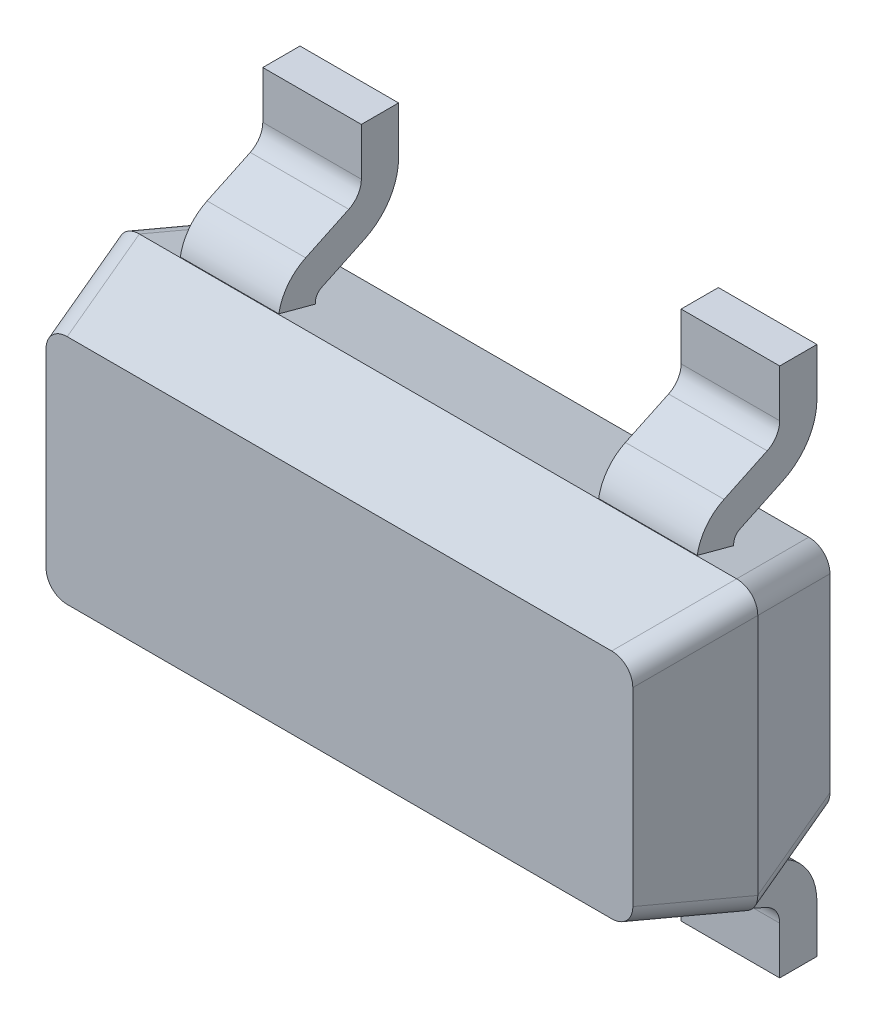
ISO-10303-21;
HEADER;
FILE_DESCRIPTION(('STEP AP214'),'2;1');
FILE_NAME('part.step','',(''),(''),'','','');
FILE_SCHEMA(('AUTOMOTIVE_DESIGN { 1 0 10303 214 1 1 1 1 }'));
ENDSEC;
DATA;
#1=APPLICATION_CONTEXT('core data for automotive mechanical design processes');
#2=APPLICATION_PROTOCOL_DEFINITION('international standard','automotive_design',2000,#1);
#3=PRODUCT_CONTEXT('',#1,'mechanical');
#4=PRODUCT('Part','Part','',(#3));
#5=PRODUCT_RELATED_PRODUCT_CATEGORY('part','',(#4));
#6=PRODUCT_DEFINITION_FORMATION('','',#4);
#7=PRODUCT_DEFINITION_CONTEXT('part definition',#1,'design');
#8=PRODUCT_DEFINITION('design','',#6,#7);
#9=PRODUCT_DEFINITION_SHAPE('','',#8);
#10=(LENGTH_UNIT() NAMED_UNIT(*) SI_UNIT(.MILLI.,.METRE.));
#11=(NAMED_UNIT(*) PLANE_ANGLE_UNIT() SI_UNIT($,.RADIAN.));
#12=(NAMED_UNIT(*) SI_UNIT($,.STERADIAN.) SOLID_ANGLE_UNIT());
#13=UNCERTAINTY_MEASURE_WITH_UNIT(LENGTH_MEASURE(1.E-05),#10,'distance_accuracy_value','');
#14=(GEOMETRIC_REPRESENTATION_CONTEXT(3) GLOBAL_UNCERTAINTY_ASSIGNED_CONTEXT((#13)) GLOBAL_UNIT_ASSIGNED_CONTEXT((#10,
#11,#12)) REPRESENTATION_CONTEXT('',''));
#15=CARTESIAN_POINT('',(0.,0.,0.));
#16=DIRECTION('',(0.,0.,1.));
#17=DIRECTION('',(1.,0.,0.));
#18=AXIS2_PLACEMENT_3D('',#15,#16,#17);
#19=CARTESIAN_POINT('',(1.46,-0.65,1.));
#20=DIRECTION('',(0.,0.,1.));
#21=DIRECTION('',(1.,0.,0.));
#22=AXIS2_PLACEMENT_3D('',#19,#20,#21);
#23=PLANE('',#22);
#24=DIRECTION('',(-1.,0.,0.));
#25=VECTOR('',#24,1.);
#26=CARTESIAN_POINT('',(1.46,0.529422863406,1.));
#27=LINE('',#26,#25);
#28=CARTESIAN_POINT('',(1.242830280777,0.529422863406,1.));
#29=VERTEX_POINT('',#28);
#30=CARTESIAN_POINT('',(-1.242830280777,0.529422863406,1.));
#31=VERTEX_POINT('',#30);
#32=EDGE_CURVE('E11',#29,#31,#27,.T.);
#33=ORIENTED_EDGE('',*,*,#32,.T.);
#34=CARTESIAN_POINT('',(-1.242830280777,0.529422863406,1.));
#35=CARTESIAN_POINT('',(-1.300170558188,0.529422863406,1.));
#36=CARTESIAN_POINT('',(-1.339422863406,0.490170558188,1.));
#37=CARTESIAN_POINT('',(-1.339422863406,0.432830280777,1.));
#38=(BOUNDED_CURVE() B_SPLINE_CURVE(3,(#34,#35,#36,#37),.UNSPECIFIED.,.F.,
.F.) B_SPLINE_CURVE_WITH_KNOTS((4,4),(0.,1.),
.UNSPECIFIED.) CURVE() GEOMETRIC_REPRESENTATION_ITEM() RATIONAL_B_SPLINE_CURVE((1.,
0.820270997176,0.820270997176,1.)) REPRESENTATION_ITEM(''));
#39=CARTESIAN_POINT('',(-1.339422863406,0.432830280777,1.));
#40=VERTEX_POINT('',#39);
#41=EDGE_CURVE('E26',#31,#40,#38,.T.);
#42=ORIENTED_EDGE('',*,*,#41,.T.);
#43=DIRECTION('',(0.,-1.,0.));
#44=VECTOR('',#43,1.);
#45=CARTESIAN_POINT('',(-1.339422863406,-0.65,1.));
#46=LINE('',#45,#44);
#47=CARTESIAN_POINT('',(-1.339422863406,-0.432830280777,1.));
#48=VERTEX_POINT('',#47);
#49=EDGE_CURVE('E1349',#40,#48,#46,.T.);
#50=ORIENTED_EDGE('',*,*,#49,.T.);
#51=CARTESIAN_POINT('',(-1.339422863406,-0.432830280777,1.));
#52=CARTESIAN_POINT('',(-1.339422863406,-0.490170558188,1.));
#53=CARTESIAN_POINT('',(-1.300170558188,-0.529422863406,1.));
#54=CARTESIAN_POINT('',(-1.242830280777,-0.529422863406,1.));
#55=(BOUNDED_CURVE() B_SPLINE_CURVE(3,(#51,#52,#53,#54),.UNSPECIFIED.,.F.,
.F.) B_SPLINE_CURVE_WITH_KNOTS((4,4),(0.,1.),
.UNSPECIFIED.) CURVE() GEOMETRIC_REPRESENTATION_ITEM() RATIONAL_B_SPLINE_CURVE((1.,
0.820270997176,0.820270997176,1.)) REPRESENTATION_ITEM(''));
#56=CARTESIAN_POINT('',(-1.242830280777,-0.529422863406,1.));
#57=VERTEX_POINT('',#56);
#58=EDGE_CURVE('E1337',#48,#57,#55,.T.);
#59=ORIENTED_EDGE('',*,*,#58,.T.);
#60=DIRECTION('',(1.,0.,0.));
#61=VECTOR('',#60,1.);
#62=CARTESIAN_POINT('',(1.46,-0.529422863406,1.));
#63=LINE('',#62,#61);
#64=CARTESIAN_POINT('',(1.242830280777,-0.529422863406,1.));
#65=VERTEX_POINT('',#64);
#66=EDGE_CURVE('E1335',#57,#65,#63,.T.);
#67=ORIENTED_EDGE('',*,*,#66,.T.);
#68=CARTESIAN_POINT('',(1.242830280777,-0.529422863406,1.));
#69=CARTESIAN_POINT('',(1.300170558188,-0.529422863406,1.));
#70=CARTESIAN_POINT('',(1.339422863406,-0.490170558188,1.));
#71=CARTESIAN_POINT('',(1.339422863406,-0.432830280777,1.));
#72=(BOUNDED_CURVE() B_SPLINE_CURVE(3,(#68,#69,#70,#71),.UNSPECIFIED.,.F.,
.F.) B_SPLINE_CURVE_WITH_KNOTS((4,4),(0.,1.),
.UNSPECIFIED.) CURVE() GEOMETRIC_REPRESENTATION_ITEM() RATIONAL_B_SPLINE_CURVE((1.,
0.820270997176,0.820270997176,1.)) REPRESENTATION_ITEM(''));
#73=CARTESIAN_POINT('',(1.339422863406,-0.432830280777,1.));
#74=VERTEX_POINT('',#73);
#75=EDGE_CURVE('E944',#65,#74,#72,.T.);
#76=ORIENTED_EDGE('',*,*,#75,.T.);
#77=DIRECTION('',(0.,1.,0.));
#78=VECTOR('',#77,1.);
#79=CARTESIAN_POINT('',(1.339422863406,-0.65,1.));
#80=LINE('',#79,#78);
#81=CARTESIAN_POINT('',(1.339422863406,0.432830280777,1.));
#82=VERTEX_POINT('',#81);
#83=EDGE_CURVE('E1322',#74,#82,#80,.T.);
#84=ORIENTED_EDGE('',*,*,#83,.T.);
#85=CARTESIAN_POINT('',(1.339422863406,0.432830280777,1.));
#86=CARTESIAN_POINT('',(1.339422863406,0.490170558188,1.));
#87=CARTESIAN_POINT('',(1.300170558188,0.529422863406,1.));
#88=CARTESIAN_POINT('',(1.242830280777,0.529422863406,1.));
#89=(BOUNDED_CURVE() B_SPLINE_CURVE(3,(#85,#86,#87,#88),.UNSPECIFIED.,.F.,
.F.) B_SPLINE_CURVE_WITH_KNOTS((4,4),(0.,1.),
.UNSPECIFIED.) CURVE() GEOMETRIC_REPRESENTATION_ITEM() RATIONAL_B_SPLINE_CURVE((1.,
0.820270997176,0.820270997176,1.)) REPRESENTATION_ITEM(''));
#90=EDGE_CURVE('E1321',#82,#29,#89,.T.);
#91=ORIENTED_EDGE('',*,*,#90,.T.);
#92=EDGE_LOOP('',(#33,#42,#50,#59,#67,#76,#84,#91));
#93=FACE_BOUND('',#92,.T.);
#94=ADVANCED_FACE('F17',(#93),#23,.T.);
#95=CARTESIAN_POINT('',(1.186149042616,0.376149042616,1.185655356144));
#96=DIRECTION('',(0.250562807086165,0.250562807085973,-0.935113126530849));
#97=DIRECTION('',(-0.661224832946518,-0.661224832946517,-0.354349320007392));
#98=AXIS2_PLACEMENT_3D('',#95,#96,#97);
#99=CYLINDRICAL_SURFACE('',#98,0.1);
#100=CARTESIAN_POINT('',(1.46000000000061,0.553407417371,0.550000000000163));
#101=CARTESIAN_POINT('',(1.46000002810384,0.555385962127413,0.550000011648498));
#102=CARTESIAN_POINT('',(1.45994288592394,0.557364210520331,0.550000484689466));
#103=CARTESIAN_POINT('',(1.45977004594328,0.560339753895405,0.550001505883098));
#104=CARTESIAN_POINT('',(1.45969713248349,0.561339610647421,0.55000190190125));
#105=CARTESIAN_POINT('',(1.45952091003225,0.563344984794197,0.550002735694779));
#106=CARTESIAN_POINT('',(1.45941735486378,0.564350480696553,0.550003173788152));
#107=CARTESIAN_POINT('',(1.45917909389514,0.566365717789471,0.550004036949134));
#108=CARTESIAN_POINT('',(1.45904415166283,0.567375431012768,0.55000446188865));
#109=CARTESIAN_POINT('',(1.45874242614,0.569397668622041,0.550005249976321));
#110=CARTESIAN_POINT('',(1.45857541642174,0.570410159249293,0.550005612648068));
#111=CARTESIAN_POINT('',(1.45820893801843,0.572436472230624,0.550006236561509));
#112=CARTESIAN_POINT('',(1.45800925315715,0.57345025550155,0.550006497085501));
#113=CARTESIAN_POINT('',(1.45757688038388,0.575477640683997,0.550006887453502));
#114=CARTESIAN_POINT('',(1.45734398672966,0.576491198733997,0.550007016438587));
#115=CARTESIAN_POINT('',(1.45684472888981,0.578516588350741,0.550007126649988));
#116=CARTESIAN_POINT('',(1.45657816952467,0.579528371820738,0.550007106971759));
#117=CARTESIAN_POINT('',(1.45601119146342,0.581548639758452,0.550006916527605));
#118=CARTESIAN_POINT('',(1.45571058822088,0.582557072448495,0.550006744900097));
#119=CARTESIAN_POINT('',(1.4550752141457,0.584569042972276,0.550006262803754));
#120=CARTESIAN_POINT('',(1.45474026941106,0.585572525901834,0.550005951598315));
#121=CARTESIAN_POINT('',(1.45403598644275,0.587572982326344,0.550005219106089));
#122=CARTESIAN_POINT('',(1.45366648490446,0.588569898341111,0.550004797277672));
#123=CARTESIAN_POINT('',(1.45289294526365,0.590555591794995,0.550003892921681));
#124=CARTESIAN_POINT('',(1.45248875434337,0.591544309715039,0.550003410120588));
#125=CARTESIAN_POINT('',(1.45164577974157,0.593511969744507,0.550002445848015));
#126=CARTESIAN_POINT('',(1.45120685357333,0.594490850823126,0.550001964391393));
#127=CARTESIAN_POINT('',(1.450294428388,0.596437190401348,0.550001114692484));
#128=CARTESIAN_POINT('',(1.44982079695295,0.597404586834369,0.550000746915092));
#129=CARTESIAN_POINT('',(1.44883910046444,0.599326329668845,0.550000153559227));
#130=CARTESIAN_POINT('',(1.44833091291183,0.600280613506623,0.54999992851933));
#131=CARTESIAN_POINT('',(1.44728031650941,0.602174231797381,0.550000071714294));
#132=CARTESIAN_POINT('',(1.44673780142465,0.603113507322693,0.550000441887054));
#133=CARTESIAN_POINT('',(1.44561907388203,0.604975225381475,0.550001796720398));
#134=CARTESIAN_POINT('',(1.44504277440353,0.60589761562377,0.550002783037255));
#135=CARTESIAN_POINT('',(1.44385715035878,0.607723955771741,0.550005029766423));
#136=CARTESIAN_POINT('',(1.4432477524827,0.608627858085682,0.550006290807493));
#137=CARTESIAN_POINT('',(1.44199667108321,0.610415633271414,0.550008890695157));
#138=CARTESIAN_POINT('',(1.44135492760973,0.611299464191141,0.550010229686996));
#139=CARTESIAN_POINT('',(1.44004000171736,0.613045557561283,0.55001279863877));
#140=CARTESIAN_POINT('',(1.43936677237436,0.613907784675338,0.550014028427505));
#141=CARTESIAN_POINT('',(1.43798981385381,0.615609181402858,0.550016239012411));
#142=CARTESIAN_POINT('',(1.43728605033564,0.616448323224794,0.550017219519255));
#143=CARTESIAN_POINT('',(1.43584905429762,0.618102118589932,0.550018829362));
#144=CARTESIAN_POINT('',(1.43511579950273,0.618916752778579,0.550019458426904));
#145=CARTESIAN_POINT('',(1.43362093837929,0.620520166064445,0.550020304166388));
#146=CARTESIAN_POINT('',(1.43285932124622,0.621308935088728,0.550020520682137));
#147=CARTESIAN_POINT('',(1.43130893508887,0.622859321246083,0.550020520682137));
#148=CARTESIAN_POINT('',(1.43052016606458,0.623620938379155,0.550020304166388));
#149=CARTESIAN_POINT('',(1.42891675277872,0.625115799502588,0.550019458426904));
#150=CARTESIAN_POINT('',(1.42810211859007,0.625849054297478,0.550018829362));
#151=CARTESIAN_POINT('',(1.42644832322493,0.627286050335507,0.550017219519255));
#152=CARTESIAN_POINT('',(1.425609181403,0.627989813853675,0.550016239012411));
#153=CARTESIAN_POINT('',(1.42390778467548,0.629366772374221,0.550014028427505));
#154=CARTESIAN_POINT('',(1.42304555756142,0.630040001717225,0.55001279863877));
#155=CARTESIAN_POINT('',(1.42129946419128,0.63135492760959,0.550010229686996));
#156=CARTESIAN_POINT('',(1.42041563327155,0.631996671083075,0.550008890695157));
#157=CARTESIAN_POINT('',(1.41862785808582,0.633247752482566,0.550006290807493));
#158=CARTESIAN_POINT('',(1.41772395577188,0.633857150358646,0.550005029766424));
#159=CARTESIAN_POINT('',(1.41589761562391,0.635042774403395,0.550002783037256));
#160=CARTESIAN_POINT('',(1.41497522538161,0.635619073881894,0.550001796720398));
#161=CARTESIAN_POINT('',(1.41311350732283,0.636737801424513,0.550000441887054));
#162=CARTESIAN_POINT('',(1.41217423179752,0.637280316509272,0.550000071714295));
#163=CARTESIAN_POINT('',(1.41028061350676,0.638330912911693,0.54999992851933));
#164=CARTESIAN_POINT('',(1.40932632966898,0.638839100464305,0.550000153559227));
#165=CARTESIAN_POINT('',(1.40740458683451,0.639820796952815,0.550000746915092));
#166=CARTESIAN_POINT('',(1.40643719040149,0.640294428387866,0.550001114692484));
#167=CARTESIAN_POINT('',(1.40449085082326,0.641206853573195,0.550001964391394));
#168=CARTESIAN_POINT('',(1.40351196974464,0.641645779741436,0.550002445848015));
#169=CARTESIAN_POINT('',(1.40154430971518,0.642488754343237,0.550003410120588));
#170=CARTESIAN_POINT('',(1.40055559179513,0.642892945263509,0.550003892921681));
#171=CARTESIAN_POINT('',(1.39856989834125,0.643666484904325,0.550004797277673));
#172=CARTESIAN_POINT('',(1.39757298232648,0.644035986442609,0.550005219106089));
#173=CARTESIAN_POINT('',(1.39557252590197,0.644740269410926,0.550005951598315));
#174=CARTESIAN_POINT('',(1.39456904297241,0.645075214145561,0.550006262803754));
#175=CARTESIAN_POINT('',(1.39255707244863,0.645710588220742,0.550006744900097));
#176=CARTESIAN_POINT('',(1.39154863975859,0.646011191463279,0.550006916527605));
#177=CARTESIAN_POINT('',(1.38952837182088,0.646578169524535,0.550007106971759));
#178=CARTESIAN_POINT('',(1.38851658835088,0.646844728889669,0.550007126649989));
#179=CARTESIAN_POINT('',(1.38649119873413,0.647343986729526,0.550007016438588));
#180=CARTESIAN_POINT('',(1.38547764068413,0.647576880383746,0.550006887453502));
#181=CARTESIAN_POINT('',(1.38345025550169,0.648009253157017,0.550006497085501));
#182=CARTESIAN_POINT('',(1.38243647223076,0.648208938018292,0.550006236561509));
#183=CARTESIAN_POINT('',(1.38041015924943,0.648575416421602,0.550005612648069));
#184=CARTESIAN_POINT('',(1.37939766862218,0.64874242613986,0.550005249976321));
#185=CARTESIAN_POINT('',(1.3773754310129,0.649044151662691,0.550004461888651));
#186=CARTESIAN_POINT('',(1.37636571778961,0.649179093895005,0.550004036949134));
#187=CARTESIAN_POINT('',(1.37435048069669,0.649417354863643,0.550003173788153));
#188=CARTESIAN_POINT('',(1.37334498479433,0.64952091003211,0.550002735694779));
#189=CARTESIAN_POINT('',(1.37133961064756,0.649697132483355,0.55000190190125));
#190=CARTESIAN_POINT('',(1.37033975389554,0.649770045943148,0.550001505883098));
#191=CARTESIAN_POINT('',(1.36736421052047,0.649942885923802,0.550000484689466));
#192=CARTESIAN_POINT('',(1.36538596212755,0.650000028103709,0.550000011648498));
#193=CARTESIAN_POINT('',(1.36340741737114,0.650000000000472,0.550000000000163));
#194=B_SPLINE_CURVE_WITH_KNOTS('',3,(#100,#101,#102,#103,#104,#105,#106,#107,#108,#109,#110,
#111,#112,#113,#114,#115,#116,#117,#118,#119,#120,#121,#122,#123,#124,#125,#126,#127,#128,#129,
#130,#131,#132,#133,#134,#135,#136,#137,#138,#139,#140,#141,#142,#143,#144,#145,#146,#147,#148,
#149,#150,#151,#152,#153,#154,#155,#156,#157,#158,#159,#160,#161,#162,#163,#164,#165,#166,#167,
#168,#169,#170,#171,#172,#173,#174,#175,#176,#177,#178,#179,#180,#181,#182,#183,#184,#185,#186,
#187,#188,#189,#190,#191,#192,#193),.UNSPECIFIED.,.F.,.F.,(4,2,2,2,2,2,2,2,2,2,2,2,2,2,2,2,2,2,
2,2,2,2,2,2,2,2,2,2,2,2,2,2,2,2,2,2,2,2,2,2,2,2,2,2,2,2,4),(0.,0.0059340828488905,
0.00894121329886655,0.0119731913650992,0.0150287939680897,0.0181068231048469,0.0212061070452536,
0.0243255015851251,0.0274638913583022,0.0306201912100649,0.0337933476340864,0.0369823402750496,
0.0401861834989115,0.0434039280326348,0.0466346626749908,0.0498775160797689,0.0531309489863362,
0.0563931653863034,0.0596629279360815,0.0629389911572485,0.0662201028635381,0.0695050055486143,
0.0727924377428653,0.0760811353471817,0.0793698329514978,0.0826572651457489,0.0859421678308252,
0.0892232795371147,0.0924993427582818,0.09576910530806,0.0990313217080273,0.102284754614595,
0.105527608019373,0.108758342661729,0.111976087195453,0.115179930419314,0.118368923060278,
0.121542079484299,0.124698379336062,0.12783676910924,0.130956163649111,0.134055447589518,
0.137133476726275,0.140189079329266,0.143221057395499,0.146228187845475,0.152162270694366),.UNSPECIFIED.);
#195=CARTESIAN_POINT('',(1.46,0.553407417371,0.55));
#196=VERTEX_POINT('',#195);
#197=CARTESIAN_POINT('',(1.363407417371,0.65,0.55));
#198=VERTEX_POINT('',#197);
#199=EDGE_CURVE('E1256',#196,#198,#194,.T.);
#200=ORIENTED_EDGE('',*,*,#199,.T.);
#201=DIRECTION('',(0.250562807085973,0.250562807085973,-0.9351131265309));
#202=VECTOR('',#201,1.);
#203=CARTESIAN_POINT('',(1.242830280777,0.529422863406,1.));
#204=LINE('',#203,#202);
#205=EDGE_CURVE('E1280',#29,#198,#204,.T.);
#206=ORIENTED_EDGE('',*,*,#205,.F.);
#207=ORIENTED_EDGE('',*,*,#90,.F.);
#208=DIRECTION('',(0.250562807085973,0.250562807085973,-0.9351131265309));
#209=VECTOR('',#208,1.);
#210=CARTESIAN_POINT('',(1.282741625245,0.376149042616,1.211537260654));
#211=LINE('',#210,#209);
#212=EDGE_CURVE('E1276',#82,#196,#211,.T.);
#213=ORIENTED_EDGE('',*,*,#212,.T.);
#214=EDGE_LOOP('',(#200,#206,#207,#213));
#215=FACE_BOUND('',#214,.T.);
#216=ADVANCED_FACE('F1288',(#215),#99,.T.);
#217=CARTESIAN_POINT('',(1.46,0.65,0.55));
#218=DIRECTION('',(0.965925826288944,0.,0.258819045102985));
#219=DIRECTION('',(0.258819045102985,0.,-0.965925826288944));
#220=AXIS2_PLACEMENT_3D('',#217,#218,#219);
#221=PLANE('',#220);
#222=ORIENTED_EDGE('',*,*,#83,.F.);
#223=DIRECTION('',(0.250562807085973,-0.250562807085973,-0.9351131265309));
#224=VECTOR('',#223,1.);
#225=CARTESIAN_POINT('',(1.339422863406,-0.432830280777,1.));
#226=LINE('',#225,#224);
#227=CARTESIAN_POINT('',(1.46,-0.553407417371,0.55));
#228=VERTEX_POINT('',#227);
#229=EDGE_CURVE('E1272',#74,#228,#226,.T.);
#230=ORIENTED_EDGE('',*,*,#229,.T.);
#231=DIRECTION('',(0.,1.,0.));
#232=VECTOR('',#231,1.);
#233=CARTESIAN_POINT('',(1.46,0.65,0.55));
#234=LINE('',#233,#232);
#235=EDGE_CURVE('E1267',#228,#196,#234,.T.);
#236=ORIENTED_EDGE('',*,*,#235,.T.);
#237=ORIENTED_EDGE('',*,*,#212,.F.);
#238=EDGE_LOOP('',(#222,#230,#236,#237));
#239=FACE_BOUND('',#238,.T.);
#240=ADVANCED_FACE('F1296',(#239),#221,.T.);
#241=CARTESIAN_POINT('',(1.46,0.65,0.55));
#242=DIRECTION('',(0.965925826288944,0.,-0.258819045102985));
#243=DIRECTION('',(-0.258819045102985,0.,-0.965925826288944));
#244=AXIS2_PLACEMENT_3D('',#241,#242,#243);
#245=PLANE('',#244);
#246=ORIENTED_EDGE('',*,*,#235,.F.);
#247=DIRECTION('',(-0.250562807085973,0.250562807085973,-0.9351131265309));
#248=VECTOR('',#247,1.);
#249=CARTESIAN_POINT('',(1.46,-0.553407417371,0.55));
#250=LINE('',#249,#248);
#251=CARTESIAN_POINT('',(1.339422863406,-0.432830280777,0.1));
#252=VERTEX_POINT('',#251);
#253=EDGE_CURVE('E1263',#228,#252,#250,.T.);
#254=ORIENTED_EDGE('',*,*,#253,.T.);
#255=DIRECTION('',(0.,1.,0.));
#256=VECTOR('',#255,1.);
#257=CARTESIAN_POINT('',(1.339422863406,0.65,0.1));
#258=LINE('',#257,#256);
#259=CARTESIAN_POINT('',(1.339422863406,0.432830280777,0.1));
#260=VERTEX_POINT('',#259);
#261=EDGE_CURVE('E1259',#252,#260,#258,.T.);
#262=ORIENTED_EDGE('',*,*,#261,.T.);
#263=DIRECTION('',(-0.250562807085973,-0.250562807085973,-0.9351131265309));
#264=VECTOR('',#263,1.);
#265=CARTESIAN_POINT('',(1.339422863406,0.432830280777,0.1));
#266=LINE('',#265,#264);
#267=EDGE_CURVE('E1257',#196,#260,#266,.T.);
#268=ORIENTED_EDGE('',*,*,#267,.F.);
#269=EDGE_LOOP('',(#246,#254,#262,#268));
#270=FACE_BOUND('',#269,.T.);
#271=ADVANCED_FACE('F1240',(#270),#245,.T.);
#272=CARTESIAN_POINT('',(1.369471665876,0.559471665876,0.598513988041));
#273=DIRECTION('',(0.250562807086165,0.250562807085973,0.935113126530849));
#274=DIRECTION('',(-0.661224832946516,-0.661224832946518,0.354349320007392));
#275=AXIS2_PLACEMENT_3D('',#272,#273,#274);
#276=CYLINDRICAL_SURFACE('',#275,0.1);
#277=ORIENTED_EDGE('',*,*,#199,.F.);
#278=ORIENTED_EDGE('',*,*,#267,.T.);
#279=CARTESIAN_POINT('',(1.33942286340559,0.432830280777,0.10000000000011));
#280=CARTESIAN_POINT('',(1.33942289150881,0.434808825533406,0.0999999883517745));
#281=CARTESIAN_POINT('',(1.33936574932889,0.436787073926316,0.0999995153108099));
#282=CARTESIAN_POINT('',(1.33919290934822,0.439762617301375,0.0999984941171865));
#283=CARTESIAN_POINT('',(1.33911999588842,0.440762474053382,0.0999980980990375));
#284=CARTESIAN_POINT('',(1.33894377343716,0.442767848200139,0.099997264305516));
#285=CARTESIAN_POINT('',(1.33884021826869,0.443773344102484,0.0999968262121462));
#286=CARTESIAN_POINT('',(1.33860195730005,0.445788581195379,0.0999959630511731));
#287=CARTESIAN_POINT('',(1.33846701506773,0.446798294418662,0.0999955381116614));
#288=CARTESIAN_POINT('',(1.33816528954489,0.448820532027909,0.0999947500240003));
#289=CARTESIAN_POINT('',(1.33799827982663,0.449833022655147,0.099994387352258));
#290=CARTESIAN_POINT('',(1.33763180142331,0.451859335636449,0.0999937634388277));
#291=CARTESIAN_POINT('',(1.33743211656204,0.452873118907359,0.0999935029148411));
#292=CARTESIAN_POINT('',(1.33699974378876,0.454900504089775,0.09999311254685));
#293=CARTESIAN_POINT('',(1.33676685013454,0.45591406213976,0.0999929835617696));
#294=CARTESIAN_POINT('',(1.33626759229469,0.457939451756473,0.0999928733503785));
#295=CARTESIAN_POINT('',(1.33600103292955,0.458951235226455,0.0999928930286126));
#296=CARTESIAN_POINT('',(1.3354340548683,0.460971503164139,0.0999930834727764));
#297=CARTESIAN_POINT('',(1.33513345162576,0.461979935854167,0.0999932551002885));
#298=CARTESIAN_POINT('',(1.33449807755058,0.46399190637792,0.0999937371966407));
#299=CARTESIAN_POINT('',(1.33416313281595,0.464995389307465,0.0999940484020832));
#300=CARTESIAN_POINT('',(1.33345884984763,0.466995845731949,0.0999947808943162));
#301=CARTESIAN_POINT('',(1.33308934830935,0.467992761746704,0.0999952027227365));
#302=CARTESIAN_POINT('',(1.33231580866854,0.469978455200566,0.0999961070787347));
#303=CARTESIAN_POINT('',(1.33191161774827,0.4709671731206,0.0999965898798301));
#304=CARTESIAN_POINT('',(1.33106864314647,0.472934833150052,0.0999975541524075));
#305=CARTESIAN_POINT('',(1.33062971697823,0.473913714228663,0.0999980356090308));
#306=CARTESIAN_POINT('',(1.3297172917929,0.475860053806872,0.0999988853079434));
#307=CARTESIAN_POINT('',(1.32924366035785,0.476827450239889,0.0999992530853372));
#308=CARTESIAN_POINT('',(1.32826196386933,0.478749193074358,0.0999998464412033));
#309=CARTESIAN_POINT('',(1.32775377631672,0.479703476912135,0.1000000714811));
#310=CARTESIAN_POINT('',(1.32670317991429,0.481597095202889,0.0999999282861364));
#311=CARTESIAN_POINT('',(1.32616066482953,0.482536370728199,0.0999995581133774));
#312=CARTESIAN_POINT('',(1.32504193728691,0.484398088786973,0.0999982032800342));
#313=CARTESIAN_POINT('',(1.32446563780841,0.485320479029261,0.0999972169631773));
#314=CARTESIAN_POINT('',(1.32328001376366,0.487146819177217,0.099994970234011));
#315=CARTESIAN_POINT('',(1.32267061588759,0.488050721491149,0.0999937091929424));
#316=CARTESIAN_POINT('',(1.3214195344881,0.489838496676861,0.0999911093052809));
#317=CARTESIAN_POINT('',(1.32077779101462,0.490722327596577,0.0999897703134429));
#318=CARTESIAN_POINT('',(1.31946286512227,0.492468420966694,0.0999872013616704));
#319=CARTESIAN_POINT('',(1.31878963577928,0.493330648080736,0.0999859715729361));
#320=CARTESIAN_POINT('',(1.31741267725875,0.49503204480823,0.099983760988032));
#321=CARTESIAN_POINT('',(1.31670891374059,0.495871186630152,0.0999827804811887));
#322=CARTESIAN_POINT('',(1.31527191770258,0.497524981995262,0.099981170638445));
#323=CARTESIAN_POINT('',(1.3145386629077,0.498339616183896,0.099980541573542));
#324=CARTESIAN_POINT('',(1.3130438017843,0.499943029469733,0.0999796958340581));
#325=CARTESIAN_POINT('',(1.31228218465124,0.500731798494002,0.0999794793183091));
#326=CARTESIAN_POINT('',(1.31073179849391,0.502282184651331,0.099979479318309));
#327=CARTESIAN_POINT('',(1.30994302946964,0.50304380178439,0.099979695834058));
#328=CARTESIAN_POINT('',(1.3083396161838,0.504538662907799,0.0999805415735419));
#329=CARTESIAN_POINT('',(1.30752498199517,0.505271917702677,0.099981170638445));
#330=CARTESIAN_POINT('',(1.30587118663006,0.506708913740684,0.0999827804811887));
#331=CARTESIAN_POINT('',(1.30503204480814,0.507412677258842,0.099983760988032));
#332=CARTESIAN_POINT('',(1.30333064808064,0.508789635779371,0.0999859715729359));
#333=CARTESIAN_POINT('',(1.3024684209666,0.509462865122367,0.0999872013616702));
#334=CARTESIAN_POINT('',(1.30072232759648,0.510777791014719,0.0999897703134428));
#335=CARTESIAN_POINT('',(1.29983849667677,0.511419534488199,0.0999911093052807));
#336=CARTESIAN_POINT('',(1.29805072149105,0.512670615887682,0.0999937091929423));
#337=CARTESIAN_POINT('',(1.29714681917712,0.513280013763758,0.099994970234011));
#338=CARTESIAN_POINT('',(1.29532047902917,0.514465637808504,0.0999972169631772));
#339=CARTESIAN_POINT('',(1.29439808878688,0.515041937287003,0.0999982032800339));
#340=CARTESIAN_POINT('',(1.2925363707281,0.516160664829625,0.0999995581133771));
#341=CARTESIAN_POINT('',(1.29159709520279,0.516703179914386,0.0999999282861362));
#342=CARTESIAN_POINT('',(1.28970347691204,0.517753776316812,0.1000000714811));
#343=CARTESIAN_POINT('',(1.28874919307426,0.518261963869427,0.0999998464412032));
#344=CARTESIAN_POINT('',(1.28682745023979,0.519243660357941,0.0999992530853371));
#345=CARTESIAN_POINT('',(1.28586005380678,0.519717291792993,0.0999988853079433));
#346=CARTESIAN_POINT('',(1.28391371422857,0.520629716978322,0.0999980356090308));
#347=CARTESIAN_POINT('',(1.28293483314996,0.521068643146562,0.0999975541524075));
#348=CARTESIAN_POINT('',(1.2809671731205,0.521911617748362,0.0999965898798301));
#349=CARTESIAN_POINT('',(1.27997845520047,0.522315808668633,0.0999961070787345));
#350=CARTESIAN_POINT('',(1.27799276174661,0.523089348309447,0.0999952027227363));
#351=CARTESIAN_POINT('',(1.27699584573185,0.52345884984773,0.099994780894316));
#352=CARTESIAN_POINT('',(1.27499538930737,0.524163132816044,0.0999940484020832));
#353=CARTESIAN_POINT('',(1.27399190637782,0.524498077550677,0.0999937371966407));
#354=CARTESIAN_POINT('',(1.27197993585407,0.525133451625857,0.0999932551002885));
#355=CARTESIAN_POINT('',(1.27097150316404,0.525434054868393,0.0999930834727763));
#356=CARTESIAN_POINT('',(1.26895123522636,0.526001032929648,0.0999928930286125));
#357=CARTESIAN_POINT('',(1.26793945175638,0.526267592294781,0.0999928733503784));
#358=CARTESIAN_POINT('',(1.26591406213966,0.526766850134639,0.0999929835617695));
#359=CARTESIAN_POINT('',(1.26490050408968,0.52699974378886,0.09999311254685));
#360=CARTESIAN_POINT('',(1.26287311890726,0.527432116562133,0.0999935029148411));
#361=CARTESIAN_POINT('',(1.26185933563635,0.52763180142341,0.0999937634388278));
#362=CARTESIAN_POINT('',(1.25983302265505,0.527998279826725,0.0999943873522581));
#363=CARTESIAN_POINT('',(1.25882053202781,0.528165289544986,0.0999947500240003));
#364=CARTESIAN_POINT('',(1.25679829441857,0.528467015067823,0.0999955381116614));
#365=CARTESIAN_POINT('',(1.25578858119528,0.528601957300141,0.0999959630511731));
#366=CARTESIAN_POINT('',(1.25377334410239,0.528840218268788,0.0999968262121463));
#367=CARTESIAN_POINT('',(1.25276784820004,0.52894377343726,0.0999972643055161));
#368=CARTESIAN_POINT('',(1.25076247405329,0.529119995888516,0.0999980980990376));
#369=CARTESIAN_POINT('',(1.24976261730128,0.529192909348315,0.0999984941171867));
#370=CARTESIAN_POINT('',(1.24678707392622,0.529365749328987,0.0999995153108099));
#371=CARTESIAN_POINT('',(1.24480882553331,0.529422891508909,0.0999999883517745));
#372=CARTESIAN_POINT('',(1.2428302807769,0.529422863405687,0.10000000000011));
#373=B_SPLINE_CURVE_WITH_KNOTS('',3,(#279,#280,#281,#282,#283,#284,#285,#286,#287,#288,#289,
#290,#291,#292,#293,#294,#295,#296,#297,#298,#299,#300,#301,#302,#303,#304,#305,#306,#307,#308,
#309,#310,#311,#312,#313,#314,#315,#316,#317,#318,#319,#320,#321,#322,#323,#324,#325,#326,#327,
#328,#329,#330,#331,#332,#333,#334,#335,#336,#337,#338,#339,#340,#341,#342,#343,#344,#345,#346,
#347,#348,#349,#350,#351,#352,#353,#354,#355,#356,#357,#358,#359,#360,#361,#362,#363,#364,#365,
#366,#367,#368,#369,#370,#371,#372),.UNSPECIFIED.,.F.,.F.,(4,2,2,2,2,2,2,2,2,2,2,2,2,2,2,2,2,2,
2,2,2,2,2,2,2,2,2,2,2,2,2,2,2,2,2,2,2,2,2,2,2,2,2,2,2,2,4),(0.,0.00593408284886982,
0.00894121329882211,0.0119731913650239,0.0150287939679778,0.0181068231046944,0.0212061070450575,
0.0243255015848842,0.0274638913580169,0.0306201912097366,0.0337933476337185,0.0369823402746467,
0.0401861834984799,0.0434039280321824,0.0466346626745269,0.0498775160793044,0.0531309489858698,
0.0563931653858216,0.0596629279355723,0.0629389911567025,0.0662201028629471,0.0695050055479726,
0.072792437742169,0.0760811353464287,0.0793698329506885,0.082657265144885,0.0859421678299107,
0.0892232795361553,0.0924993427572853,0.0957691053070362,0.099031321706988,0.102284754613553,
0.105527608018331,0.108758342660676,0.111976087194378,0.115179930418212,0.11836892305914,
0.121542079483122,0.124698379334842,0.127836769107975,0.130956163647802,0.134055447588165,
0.137133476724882,0.140189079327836,0.143221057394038,0.14622818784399,0.15216227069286),.UNSPECIFIED.);
#374=CARTESIAN_POINT('',(1.242830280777,0.529422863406,0.1));
#375=VERTEX_POINT('',#374);
#376=EDGE_CURVE('E895',#260,#375,#373,.T.);
#377=ORIENTED_EDGE('',*,*,#376,.T.);
#378=DIRECTION('',(-0.250562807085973,-0.250562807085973,-0.9351131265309));
#379=VECTOR('',#378,1.);
#380=CARTESIAN_POINT('',(1.363407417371,0.65,0.55));
#381=LINE('',#380,#379);
#382=EDGE_CURVE('E1217',#198,#375,#381,.T.);
#383=ORIENTED_EDGE('',*,*,#382,.F.);
#384=EDGE_LOOP('',(#277,#278,#377,#383));
#385=FACE_BOUND('',#384,.T.);
#386=ADVANCED_FACE('F1229',(#385),#276,.T.);
#387=CARTESIAN_POINT('',(-1.46,0.65,0.55));
#388=DIRECTION('',(0.,0.965925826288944,-0.258819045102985));
#389=DIRECTION('',(0.,0.258819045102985,0.965925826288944));
#390=AXIS2_PLACEMENT_3D('',#387,#388,#389);
#391=PLANE('',#390);
#392=DIRECTION('',(1.,0.,0.));
#393=VECTOR('',#392,1.);
#394=CARTESIAN_POINT('',(-1.46,0.604448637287,0.38));
#395=LINE('',#394,#393);
#396=CARTESIAN_POINT('',(-1.18,0.604448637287,0.38));
#397=VERTEX_POINT('',#396);
#398=CARTESIAN_POINT('',(-0.73,0.604448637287,0.38));
#399=VERTEX_POINT('',#398);
#400=EDGE_CURVE('E1213',#397,#399,#395,.T.);
#401=ORIENTED_EDGE('',*,*,#400,.T.);
#402=DIRECTION('',(0.,0.258819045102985,0.965925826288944));
#403=VECTOR('',#402,1.);
#404=CARTESIAN_POINT('',(-0.73,0.65,0.55));
#405=LINE('',#404,#403);
#406=CARTESIAN_POINT('',(-0.73,0.649098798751,0.546636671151));
#407=VERTEX_POINT('',#406);
#408=EDGE_CURVE('E1209',#399,#407,#405,.T.);
#409=ORIENTED_EDGE('',*,*,#408,.T.);
#410=DIRECTION('',(-1.,0.,0.));
#411=VECTOR('',#410,1.);
#412=CARTESIAN_POINT('',(-1.46,0.649098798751,0.546636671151));
#413=LINE('',#412,#411);
#414=CARTESIAN_POINT('',(-1.18,0.649098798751,0.546636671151));
#415=VERTEX_POINT('',#414);
#416=EDGE_CURVE('E1205',#407,#415,#413,.T.);
#417=ORIENTED_EDGE('',*,*,#416,.T.);
#418=DIRECTION('',(0.,-0.258819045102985,-0.965925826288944));
#419=VECTOR('',#418,1.);
#420=CARTESIAN_POINT('',(-1.18,0.65,0.55));
#421=LINE('',#420,#419);
#422=EDGE_CURVE('E1201',#415,#397,#421,.T.);
#423=ORIENTED_EDGE('',*,*,#422,.T.);
#424=EDGE_LOOP('',(#401,#409,#417,#423));
#425=FACE_BOUND('',#424,.T.);
#426=DIRECTION('',(-1.,0.,0.));
#427=VECTOR('',#426,1.);
#428=CARTESIAN_POINT('',(-1.46,0.529422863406,0.1));
#429=LINE('',#428,#427);
#430=CARTESIAN_POINT('',(-1.242830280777,0.529422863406,0.1));
#431=VERTEX_POINT('',#430);
#432=EDGE_CURVE('E1197',#375,#431,#429,.T.);
#433=ORIENTED_EDGE('',*,*,#432,.T.);
#434=DIRECTION('',(0.250562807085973,-0.250562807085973,-0.9351131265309));
#435=VECTOR('',#434,1.);
#436=CARTESIAN_POINT('',(-1.369471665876,0.656064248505,0.572632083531));
#437=LINE('',#436,#435);
#438=CARTESIAN_POINT('',(-1.363407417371,0.65,0.55));
#439=VERTEX_POINT('',#438);
#440=EDGE_CURVE('E1193',#439,#431,#437,.T.);
#441=ORIENTED_EDGE('',*,*,#440,.F.);
#442=DIRECTION('',(-1.,0.,0.));
#443=VECTOR('',#442,1.);
#444=CARTESIAN_POINT('',(-1.46,0.65,0.55));
#445=LINE('',#444,#443);
#446=EDGE_CURVE('E1188',#198,#439,#445,.T.);
#447=ORIENTED_EDGE('',*,*,#446,.F.);
#448=ORIENTED_EDGE('',*,*,#382,.T.);
#449=EDGE_LOOP('',(#433,#441,#447,#448));
#450=FACE_BOUND('',#449,.T.);
#451=DIRECTION('',(1.,0.,0.));
#452=VECTOR('',#451,1.);
#453=CARTESIAN_POINT('',(-1.46,0.604448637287,0.38));
#454=LINE('',#453,#452);
#455=CARTESIAN_POINT('',(0.73,0.604448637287,0.38));
#456=VERTEX_POINT('',#455);
#457=CARTESIAN_POINT('',(1.18,0.604448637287,0.38));
#458=VERTEX_POINT('',#457);
#459=EDGE_CURVE('E1184',#456,#458,#454,.T.);
#460=ORIENTED_EDGE('',*,*,#459,.T.);
#461=DIRECTION('',(0.,0.258819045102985,0.965925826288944));
#462=VECTOR('',#461,1.);
#463=CARTESIAN_POINT('',(1.18,0.65,0.55));
#464=LINE('',#463,#462);
#465=CARTESIAN_POINT('',(1.18,0.649098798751,0.546636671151));
#466=VERTEX_POINT('',#465);
#467=EDGE_CURVE('E1180',#458,#466,#464,.T.);
#468=ORIENTED_EDGE('',*,*,#467,.T.);
#469=DIRECTION('',(-1.,0.,0.));
#470=VECTOR('',#469,1.);
#471=CARTESIAN_POINT('',(-1.46,0.649098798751,0.546636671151));
#472=LINE('',#471,#470);
#473=CARTESIAN_POINT('',(0.73,0.649098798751,0.546636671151));
#474=VERTEX_POINT('',#473);
#475=EDGE_CURVE('E1176',#466,#474,#472,.T.);
#476=ORIENTED_EDGE('',*,*,#475,.T.);
#477=DIRECTION('',(0.,-0.258819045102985,-0.965925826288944));
#478=VECTOR('',#477,1.);
#479=CARTESIAN_POINT('',(0.73,0.65,0.55));
#480=LINE('',#479,#478);
#481=EDGE_CURVE('E1172',#474,#456,#480,.T.);
#482=ORIENTED_EDGE('',*,*,#481,.T.);
#483=EDGE_LOOP('',(#460,#468,#476,#482));
#484=FACE_BOUND('',#483,.T.);
#485=ADVANCED_FACE('F1239',(#425,#450,#484),#391,.T.);
#486=CARTESIAN_POINT('',(0.73,0.993283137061,0.27));
#487=DIRECTION('',(1.,0.,0.));
#488=DIRECTION('',(0.,0.,-1.));
#489=AXIS2_PLACEMENT_3D('',#486,#487,#488);
#490=PLANE('',#489);
#491=CARTESIAN_POINT('',(0.73,0.610777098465,0.33));
#492=DIRECTION('',(1.,0.,0.));
#493=DIRECTION('',(0.,0.,-1.));
#494=AXIS2_PLACEMENT_3D('',#491,#492,#493);
#495=CIRCLE('',#494,0.22);
#496=CARTESIAN_POINT('',(0.73,0.809599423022,0.424178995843));
#497=VERTEX_POINT('',#496);
#498=EDGE_CURVE('E1167',#497,#474,#495,.T.);
#499=ORIENTED_EDGE('',*,*,#498,.F.);
#500=DIRECTION('',(0.,-0.42808634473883,0.903737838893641));
#501=VECTOR('',#500,1.);
#502=CARTESIAN_POINT('',(0.73,0.902909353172,0.227191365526));
#503=LINE('',#502,#501);
#504=CARTESIAN_POINT('',(0.73,0.902909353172,0.227191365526));
#505=VERTEX_POINT('',#504);
#506=EDGE_CURVE('E1162',#505,#497,#503,.T.);
#507=ORIENTED_EDGE('',*,*,#506,.F.);
#508=CARTESIAN_POINT('',(0.73,0.993283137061,0.27));
#509=DIRECTION('',(-1.,0.,0.));
#510=DIRECTION('',(0.,0.,-1.));
#511=AXIS2_PLACEMENT_3D('',#508,#509,#510);
#512=CIRCLE('',#511,0.1);
#513=CARTESIAN_POINT('',(0.73,0.993283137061,0.17));
#514=VERTEX_POINT('',#513);
#515=EDGE_CURVE('E1157',#514,#505,#512,.T.);
#516=ORIENTED_EDGE('',*,*,#515,.F.);
#517=DIRECTION('',(0.,-1.,0.));
#518=VECTOR('',#517,1.);
#519=CARTESIAN_POINT('',(0.73,0.993283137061,0.17));
#520=LINE('',#519,#518);
#521=CARTESIAN_POINT('',(0.73,1.21,0.17));
#522=VERTEX_POINT('',#521);
#523=EDGE_CURVE('E1152',#522,#514,#520,.T.);
#524=ORIENTED_EDGE('',*,*,#523,.F.);
#525=DIRECTION('',(0.,0.,1.));
#526=VECTOR('',#525,1.);
#527=CARTESIAN_POINT('',(0.73,1.21,0.27));
#528=LINE('',#527,#526);
#529=CARTESIAN_POINT('',(0.73,1.21,0.));
#530=VERTEX_POINT('',#529);
#531=EDGE_CURVE('E1147',#530,#522,#528,.T.);
#532=ORIENTED_EDGE('',*,*,#531,.F.);
#533=DIRECTION('',(0.,1.,0.));
#534=VECTOR('',#533,1.);
#535=CARTESIAN_POINT('',(0.73,0.993283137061,0.));
#536=LINE('',#535,#534);
#537=CARTESIAN_POINT('',(0.73,0.993283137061,0.));
#538=VERTEX_POINT('',#537);
#539=EDGE_CURVE('E1142',#538,#530,#536,.T.);
#540=ORIENTED_EDGE('',*,*,#539,.F.);
#541=CARTESIAN_POINT('',(0.73,0.993283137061,0.27));
#542=DIRECTION('',(1.,0.,0.));
#543=DIRECTION('',(0.,0.,-1.));
#544=AXIS2_PLACEMENT_3D('',#541,#542,#543);
#545=CIRCLE('',#544,0.27);
#546=CARTESIAN_POINT('',(0.73,0.74927392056,0.15441668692));
#547=VERTEX_POINT('',#546);
#548=EDGE_CURVE('E1137',#547,#538,#545,.T.);
#549=ORIENTED_EDGE('',*,*,#548,.F.);
#550=DIRECTION('',(0.,0.42808634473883,-0.903737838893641));
#551=VECTOR('',#550,1.);
#552=CARTESIAN_POINT('',(0.73,0.65596399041,0.351404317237));
#553=LINE('',#552,#551);
#554=CARTESIAN_POINT('',(0.73,0.65596399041,0.351404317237));
#555=VERTEX_POINT('',#554);
#556=EDGE_CURVE('E1132',#555,#547,#553,.T.);
#557=ORIENTED_EDGE('',*,*,#556,.F.);
#558=CARTESIAN_POINT('',(0.73,0.610777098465,0.33));
#559=DIRECTION('',(-1.,0.,0.));
#560=DIRECTION('',(0.,0.,-1.));
#561=AXIS2_PLACEMENT_3D('',#558,#559,#560);
#562=CIRCLE('',#561,0.05);
#563=CARTESIAN_POINT('',(0.73,0.610777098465,0.38));
#564=VERTEX_POINT('',#563);
#565=EDGE_CURVE('E1127',#564,#555,#562,.T.);
#566=ORIENTED_EDGE('',*,*,#565,.F.);
#567=DIRECTION('',(0.,1.,0.));
#568=VECTOR('',#567,1.);
#569=CARTESIAN_POINT('',(0.73,0.6,0.38));
#570=LINE('',#569,#568);
#571=EDGE_CURVE('E1122',#456,#564,#570,.T.);
#572=ORIENTED_EDGE('',*,*,#571,.F.);
#573=ORIENTED_EDGE('',*,*,#481,.F.);
#574=EDGE_LOOP('',(#499,#507,#516,#524,#532,#540,#549,#557,#566,#572,#573));
#575=FACE_BOUND('',#574,.T.);
#576=ADVANCED_FACE('F1408',(#575),#490,.F.);
#577=CARTESIAN_POINT('',(0.73,0.6,0.38));
#578=DIRECTION('',(0.,0.,-1.));
#579=DIRECTION('',(-1.,0.,0.));
#580=AXIS2_PLACEMENT_3D('',#577,#578,#579);
#581=PLANE('',#580);
#582=ORIENTED_EDGE('',*,*,#571,.T.);
#583=DIRECTION('',(1.,0.,0.));
#584=VECTOR('',#583,1.);
#585=CARTESIAN_POINT('',(0.73,0.610777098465,0.38));
#586=LINE('',#585,#584);
#587=CARTESIAN_POINT('',(1.18,0.610777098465,0.38));
#588=VERTEX_POINT('',#587);
#589=EDGE_CURVE('E1118',#564,#588,#586,.T.);
#590=ORIENTED_EDGE('',*,*,#589,.T.);
#591=DIRECTION('',(0.,1.,0.));
#592=VECTOR('',#591,1.);
#593=CARTESIAN_POINT('',(1.18,0.993283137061,0.38));
#594=LINE('',#593,#592);
#595=EDGE_CURVE('E1113',#458,#588,#594,.T.);
#596=ORIENTED_EDGE('',*,*,#595,.F.);
#597=ORIENTED_EDGE('',*,*,#459,.F.);
#598=EDGE_LOOP('',(#582,#590,#596,#597));
#599=FACE_BOUND('',#598,.T.);
#600=ADVANCED_FACE('F1415',(#599),#581,.T.);
#601=CARTESIAN_POINT('',(1.18,0.993283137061,0.27));
#602=DIRECTION('',(1.,0.,0.));
#603=DIRECTION('',(0.,0.,-1.));
#604=AXIS2_PLACEMENT_3D('',#601,#602,#603);
#605=PLANE('',#604);
#606=CARTESIAN_POINT('',(1.18,0.993283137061,0.27));
#607=DIRECTION('',(-1.,0.,0.));
#608=DIRECTION('',(0.,0.,-1.));
#609=AXIS2_PLACEMENT_3D('',#606,#607,#608);
#610=CIRCLE('',#609,0.1);
#611=CARTESIAN_POINT('',(1.18,0.993283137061,0.17));
#612=VERTEX_POINT('',#611);
#613=CARTESIAN_POINT('',(1.18,0.902909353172,0.227191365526));
#614=VERTEX_POINT('',#613);
#615=EDGE_CURVE('E1109',#612,#614,#610,.T.);
#616=ORIENTED_EDGE('',*,*,#615,.T.);
#617=DIRECTION('',(0.,-0.42808634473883,0.903737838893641));
#618=VECTOR('',#617,1.);
#619=CARTESIAN_POINT('',(1.18,0.902909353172,0.227191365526));
#620=LINE('',#619,#618);
#621=CARTESIAN_POINT('',(1.18,0.809599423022,0.424178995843));
#622=VERTEX_POINT('',#621);
#623=EDGE_CURVE('E1105',#614,#622,#620,.T.);
#624=ORIENTED_EDGE('',*,*,#623,.T.);
#625=CARTESIAN_POINT('',(1.18,0.610777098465,0.33));
#626=DIRECTION('',(1.,0.,0.));
#627=DIRECTION('',(0.,0.,-1.));
#628=AXIS2_PLACEMENT_3D('',#625,#626,#627);
#629=CIRCLE('',#628,0.22);
#630=EDGE_CURVE('E1100',#622,#466,#629,.T.);
#631=ORIENTED_EDGE('',*,*,#630,.T.);
#632=ORIENTED_EDGE('',*,*,#467,.F.);
#633=ORIENTED_EDGE('',*,*,#595,.T.);
#634=CARTESIAN_POINT('',(1.18,0.610777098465,0.33));
#635=DIRECTION('',(-1.,0.,0.));
#636=DIRECTION('',(0.,0.,-1.));
#637=AXIS2_PLACEMENT_3D('',#634,#635,#636);
#638=CIRCLE('',#637,0.05);
#639=CARTESIAN_POINT('',(1.18,0.65596399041,0.351404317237));
#640=VERTEX_POINT('',#639);
#641=EDGE_CURVE('E1096',#588,#640,#638,.T.);
#642=ORIENTED_EDGE('',*,*,#641,.T.);
#643=DIRECTION('',(0.,0.42808634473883,-0.903737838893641));
#644=VECTOR('',#643,1.);
#645=CARTESIAN_POINT('',(1.18,0.65596399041,0.351404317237));
#646=LINE('',#645,#644);
#647=CARTESIAN_POINT('',(1.18,0.74927392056,0.15441668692));
#648=VERTEX_POINT('',#647);
#649=EDGE_CURVE('E1092',#640,#648,#646,.T.);
#650=ORIENTED_EDGE('',*,*,#649,.T.);
#651=CARTESIAN_POINT('',(1.18,0.993283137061,0.27));
#652=DIRECTION('',(1.,0.,0.));
#653=DIRECTION('',(0.,0.,-1.));
#654=AXIS2_PLACEMENT_3D('',#651,#652,#653);
#655=CIRCLE('',#654,0.27);
#656=CARTESIAN_POINT('',(1.18,0.993283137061,0.));
#657=VERTEX_POINT('',#656);
#658=EDGE_CURVE('E1088',#648,#657,#655,.T.);
#659=ORIENTED_EDGE('',*,*,#658,.T.);
#660=DIRECTION('',(0.,1.,0.));
#661=VECTOR('',#660,1.);
#662=CARTESIAN_POINT('',(1.18,0.993283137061,0.));
#663=LINE('',#662,#661);
#664=CARTESIAN_POINT('',(1.18,1.21,0.));
#665=VERTEX_POINT('',#664);
#666=EDGE_CURVE('E1084',#657,#665,#663,.T.);
#667=ORIENTED_EDGE('',*,*,#666,.T.);
#668=DIRECTION('',(0.,0.,1.));
#669=VECTOR('',#668,1.);
#670=CARTESIAN_POINT('',(1.18,1.21,0.27));
#671=LINE('',#670,#669);
#672=CARTESIAN_POINT('',(1.18,1.21,0.17));
#673=VERTEX_POINT('',#672);
#674=EDGE_CURVE('E1080',#665,#673,#671,.T.);
#675=ORIENTED_EDGE('',*,*,#674,.T.);
#676=DIRECTION('',(0.,-1.,0.));
#677=VECTOR('',#676,1.);
#678=CARTESIAN_POINT('',(1.18,0.993283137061,0.17));
#679=LINE('',#678,#677);
#680=EDGE_CURVE('E1076',#673,#612,#679,.T.);
#681=ORIENTED_EDGE('',*,*,#680,.T.);
#682=EDGE_LOOP('',(#616,#624,#631,#632,#633,#642,#650,#659,#667,#675,#681));
#683=FACE_BOUND('',#682,.T.);
#684=ADVANCED_FACE('F1422',(#683),#605,.T.);
#685=CARTESIAN_POINT('',(0.73,1.21,0.17));
#686=DIRECTION('',(0.,0.,1.));
#687=DIRECTION('',(1.,0.,0.));
#688=AXIS2_PLACEMENT_3D('',#685,#686,#687);
#689=PLANE('',#688);
#690=DIRECTION('',(-1.,0.,0.));
#691=VECTOR('',#690,1.);
#692=CARTESIAN_POINT('',(0.73,1.21,0.17));
#693=LINE('',#692,#691);
#694=EDGE_CURVE('E1071',#673,#522,#693,.T.);
#695=ORIENTED_EDGE('',*,*,#694,.T.);
#696=ORIENTED_EDGE('',*,*,#523,.T.);
#697=DIRECTION('',(1.,0.,0.));
#698=VECTOR('',#697,1.);
#699=CARTESIAN_POINT('',(0.73,0.993283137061,0.17));
#700=LINE('',#699,#698);
#701=EDGE_CURVE('E1066',#514,#612,#700,.T.);
#702=ORIENTED_EDGE('',*,*,#701,.T.);
#703=ORIENTED_EDGE('',*,*,#680,.F.);
#704=EDGE_LOOP('',(#695,#696,#702,#703));
#705=FACE_BOUND('',#704,.T.);
#706=ADVANCED_FACE('F1430',(#705),#689,.T.);
#707=CARTESIAN_POINT('',(0.73,0.993283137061,0.27));
#708=DIRECTION('',(1.,0.,0.));
#709=DIRECTION('',(0.,0.534749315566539,0.845010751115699));
#710=AXIS2_PLACEMENT_3D('',#707,#708,#709);
#711=CYLINDRICAL_SURFACE('',#710,0.1);
#712=ORIENTED_EDGE('',*,*,#615,.F.);
#713=ORIENTED_EDGE('',*,*,#701,.F.);
#714=ORIENTED_EDGE('',*,*,#515,.T.);
#715=DIRECTION('',(-1.,0.,0.));
#716=VECTOR('',#715,1.);
#717=CARTESIAN_POINT('',(0.73,0.902909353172,0.227191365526));
#718=LINE('',#717,#716);
#719=EDGE_CURVE('E1061',#614,#505,#718,.T.);
#720=ORIENTED_EDGE('',*,*,#719,.F.);
#721=EDGE_LOOP('',(#712,#713,#714,#720));
#722=FACE_BOUND('',#721,.T.);
#723=ADVANCED_FACE('F1438',(#722),#711,.F.);
#724=CARTESIAN_POINT('',(0.73,0.809599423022,0.424178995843));
#725=DIRECTION('',(0.,0.903737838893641,0.42808634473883));
#726=DIRECTION('',(0.,-0.42808634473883,0.903737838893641));
#727=AXIS2_PLACEMENT_3D('',#724,#725,#726);
#728=PLANE('',#727);
#729=ORIENTED_EDGE('',*,*,#719,.T.);
#730=ORIENTED_EDGE('',*,*,#506,.T.);
#731=DIRECTION('',(-1.,0.,0.));
#732=VECTOR('',#731,1.);
#733=CARTESIAN_POINT('',(0.73,0.809599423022,0.424178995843));
#734=LINE('',#733,#732);
#735=EDGE_CURVE('E1056',#622,#497,#734,.T.);
#736=ORIENTED_EDGE('',*,*,#735,.F.);
#737=ORIENTED_EDGE('',*,*,#623,.F.);
#738=EDGE_LOOP('',(#729,#730,#736,#737));
#739=FACE_BOUND('',#738,.T.);
#740=ADVANCED_FACE('F1446',(#739),#728,.T.);
#741=CARTESIAN_POINT('',(0.73,0.610777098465,0.33));
#742=DIRECTION('',(1.,0.,0.));
#743=DIRECTION('',(0.,-0.606580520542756,-0.795022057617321));
#744=AXIS2_PLACEMENT_3D('',#741,#742,#743);
#745=CYLINDRICAL_SURFACE('',#744,0.22);
#746=ORIENTED_EDGE('',*,*,#630,.F.);
#747=ORIENTED_EDGE('',*,*,#735,.T.);
#748=ORIENTED_EDGE('',*,*,#498,.T.);
#749=ORIENTED_EDGE('',*,*,#475,.F.);
#750=EDGE_LOOP('',(#746,#747,#748,#749));
#751=FACE_BOUND('',#750,.T.);
#752=ADVANCED_FACE('F1454',(#751),#745,.T.);
#753=CARTESIAN_POINT('',(0.73,1.21,0.17));
#754=DIRECTION('',(0.,1.,0.));
#755=DIRECTION('',(0.,0.,1.));
#756=AXIS2_PLACEMENT_3D('',#753,#754,#755);
#757=PLANE('',#756);
#758=DIRECTION('',(-1.,0.,0.));
#759=VECTOR('',#758,1.);
#760=CARTESIAN_POINT('',(0.73,1.21,0.));
#761=LINE('',#760,#759);
#762=EDGE_CURVE('E1051',#665,#530,#761,.T.);
#763=ORIENTED_EDGE('',*,*,#762,.T.);
#764=ORIENTED_EDGE('',*,*,#531,.T.);
#765=ORIENTED_EDGE('',*,*,#694,.F.);
#766=ORIENTED_EDGE('',*,*,#674,.F.);
#767=EDGE_LOOP('',(#763,#764,#765,#766));
#768=FACE_BOUND('',#767,.T.);
#769=ADVANCED_FACE('F1462',(#768),#757,.T.);
#770=CARTESIAN_POINT('',(0.73,1.21,0.));
#771=DIRECTION('',(0.,0.,-1.));
#772=DIRECTION('',(0.,1.,0.));
#773=AXIS2_PLACEMENT_3D('',#770,#771,#772);
#774=PLANE('',#773);
#775=DIRECTION('',(-1.,0.,0.));
#776=VECTOR('',#775,1.);
#777=CARTESIAN_POINT('',(0.73,0.993283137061,0.));
#778=LINE('',#777,#776);
#779=EDGE_CURVE('E1046',#657,#538,#778,.T.);
#780=ORIENTED_EDGE('',*,*,#779,.T.);
#781=ORIENTED_EDGE('',*,*,#539,.T.);
#782=ORIENTED_EDGE('',*,*,#762,.F.);
#783=ORIENTED_EDGE('',*,*,#666,.F.);
#784=EDGE_LOOP('',(#780,#781,#782,#783));
#785=FACE_BOUND('',#784,.T.);
#786=ADVANCED_FACE('F1470',(#785),#774,.T.);
#787=CARTESIAN_POINT('',(0.73,0.993283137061,0.27));
#788=DIRECTION('',(1.,0.,0.));
#789=DIRECTION('',(0.,0.534749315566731,0.845010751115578));
#790=AXIS2_PLACEMENT_3D('',#787,#788,#789);
#791=CYLINDRICAL_SURFACE('',#790,0.27);
#792=DIRECTION('',(-1.,0.,0.));
#793=VECTOR('',#792,1.);
#794=CARTESIAN_POINT('',(0.73,0.74927392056,0.15441668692));
#795=LINE('',#794,#793);
#796=EDGE_CURVE('E1041',#648,#547,#795,.T.);
#797=ORIENTED_EDGE('',*,*,#796,.T.);
#798=ORIENTED_EDGE('',*,*,#548,.T.);
#799=ORIENTED_EDGE('',*,*,#779,.F.);
#800=ORIENTED_EDGE('',*,*,#658,.F.);
#801=EDGE_LOOP('',(#797,#798,#799,#800));
#802=FACE_BOUND('',#801,.T.);
#803=ADVANCED_FACE('F1478',(#802),#791,.T.);
#804=CARTESIAN_POINT('',(0.73,0.74927392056,0.15441668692));
#805=DIRECTION('',(0.,-0.903737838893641,-0.42808634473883));
#806=DIRECTION('',(0.,0.42808634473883,-0.903737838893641));
#807=AXIS2_PLACEMENT_3D('',#804,#805,#806);
#808=PLANE('',#807);
#809=DIRECTION('',(-1.,0.,0.));
#810=VECTOR('',#809,1.);
#811=CARTESIAN_POINT('',(0.73,0.65596399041,0.351404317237));
#812=LINE('',#811,#810);
#813=EDGE_CURVE('E1036',#640,#555,#812,.T.);
#814=ORIENTED_EDGE('',*,*,#813,.T.);
#815=ORIENTED_EDGE('',*,*,#556,.T.);
#816=ORIENTED_EDGE('',*,*,#796,.F.);
#817=ORIENTED_EDGE('',*,*,#649,.F.);
#818=EDGE_LOOP('',(#814,#815,#816,#817));
#819=FACE_BOUND('',#818,.T.);
#820=ADVANCED_FACE('F1486',(#819),#808,.T.);
#821=CARTESIAN_POINT('',(0.73,0.610777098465,0.33));
#822=DIRECTION('',(1.,0.,0.));
#823=DIRECTION('',(0.,-0.534749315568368,-0.845010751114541));
#824=AXIS2_PLACEMENT_3D('',#821,#822,#823);
#825=CYLINDRICAL_SURFACE('',#824,0.05);
#826=ORIENTED_EDGE('',*,*,#641,.F.);
#827=ORIENTED_EDGE('',*,*,#589,.F.);
#828=ORIENTED_EDGE('',*,*,#565,.T.);
#829=ORIENTED_EDGE('',*,*,#813,.F.);
#830=EDGE_LOOP('',(#826,#827,#828,#829));
#831=FACE_BOUND('',#830,.T.);
#832=ADVANCED_FACE('F1494',(#831),#825,.F.);
#833=CARTESIAN_POINT('',(-1.46,0.65,0.55));
#834=DIRECTION('',(0.,0.965925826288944,0.258819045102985));
#835=DIRECTION('',(0.,-0.258819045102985,0.965925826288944));
#836=AXIS2_PLACEMENT_3D('',#833,#834,#835);
#837=PLANE('',#836);
#838=ORIENTED_EDGE('',*,*,#32,.F.);
#839=ORIENTED_EDGE('',*,*,#205,.T.);
#840=ORIENTED_EDGE('',*,*,#446,.T.);
#841=DIRECTION('',(-0.250562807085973,0.250562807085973,-0.9351131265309));
#842=VECTOR('',#841,1.);
#843=CARTESIAN_POINT('',(-1.369471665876,0.656064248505,0.527367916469));
#844=LINE('',#843,#842);
#845=EDGE_CURVE('E1034',#31,#439,#844,.T.);
#846=ORIENTED_EDGE('',*,*,#845,.F.);
#847=EDGE_LOOP('',(#838,#839,#840,#846));
#848=FACE_BOUND('',#847,.T.);
#849=ADVANCED_FACE('F1018',(#848),#837,.T.);
#850=CARTESIAN_POINT('',(-1.369471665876,0.559471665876,0.501486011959));
#851=DIRECTION('',(-0.250562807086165,0.250562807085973,-0.935113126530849));
#852=DIRECTION('',(0.661224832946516,-0.661224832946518,-0.354349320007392));
#853=AXIS2_PLACEMENT_3D('',#850,#851,#852);
#854=CYLINDRICAL_SURFACE('',#853,0.1);
#855=CARTESIAN_POINT('',(-1.363407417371,0.649999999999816,0.549999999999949));
#856=CARTESIAN_POINT('',(-1.3653859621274,0.65000002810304,0.550000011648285));
#857=CARTESIAN_POINT('',(-1.36736421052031,0.649942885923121,0.55000048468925));
#858=CARTESIAN_POINT('',(-1.37033975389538,0.649770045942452,0.550001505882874));
#859=CARTESIAN_POINT('',(-1.37133961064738,0.649697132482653,0.550001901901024));
#860=CARTESIAN_POINT('',(-1.37334498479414,0.649520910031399,0.550002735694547));
#861=CARTESIAN_POINT('',(-1.37435048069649,0.649417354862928,0.550003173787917));
#862=CARTESIAN_POINT('',(-1.37636571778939,0.649179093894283,0.550004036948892));
#863=CARTESIAN_POINT('',(-1.37737543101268,0.649044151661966,0.550004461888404));
#864=CARTESIAN_POINT('',(-1.37939766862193,0.648742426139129,0.550005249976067));
#865=CARTESIAN_POINT('',(-1.38041015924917,0.648575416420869,0.55000561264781));
#866=CARTESIAN_POINT('',(-1.38243647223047,0.648208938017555,0.550006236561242));
#867=CARTESIAN_POINT('',(-1.38345025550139,0.648009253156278,0.55000649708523));
#868=CARTESIAN_POINT('',(-1.38547764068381,0.647576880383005,0.550006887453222));
#869=CARTESIAN_POINT('',(-1.38649119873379,0.647343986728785,0.550007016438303));
#870=CARTESIAN_POINT('',(-1.38851658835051,0.646844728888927,0.550007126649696));
#871=CARTESIAN_POINT('',(-1.3895283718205,0.646578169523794,0.550007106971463));
#872=CARTESIAN_POINT('',(-1.39154863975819,0.646011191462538,0.550006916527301));
#873=CARTESIAN_POINT('',(-1.39255707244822,0.645710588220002,0.550006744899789));
#874=CARTESIAN_POINT('',(-1.39456904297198,0.645075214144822,0.550006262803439));
#875=CARTESIAN_POINT('',(-1.39557252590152,0.644740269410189,0.550005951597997));
#876=CARTESIAN_POINT('',(-1.39757298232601,0.644035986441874,0.550005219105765));
#877=CARTESIAN_POINT('',(-1.39856989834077,0.643666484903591,0.550004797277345));
#878=CARTESIAN_POINT('',(-1.40055559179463,0.642892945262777,0.550003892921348));
#879=CARTESIAN_POINT('',(-1.40154430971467,0.642488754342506,0.550003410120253));
#880=CARTESIAN_POINT('',(-1.40351196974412,0.641645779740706,0.550002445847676));
#881=CARTESIAN_POINT('',(-1.40449085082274,0.641206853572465,0.550001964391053));
#882=CARTESIAN_POINT('',(-1.40643719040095,0.640294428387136,0.550001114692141));
#883=CARTESIAN_POINT('',(-1.40740458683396,0.639820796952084,0.550000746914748));
#884=CARTESIAN_POINT('',(-1.40932632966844,0.638839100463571,0.550000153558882));
#885=CARTESIAN_POINT('',(-1.41028061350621,0.638330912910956,0.549999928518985));
#886=CARTESIAN_POINT('',(-1.41217423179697,0.637280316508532,0.550000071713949));
#887=CARTESIAN_POINT('',(-1.41311350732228,0.636737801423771,0.550000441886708));
#888=CARTESIAN_POINT('',(-1.41497522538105,0.635619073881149,0.550001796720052));
#889=CARTESIAN_POINT('',(-1.41589761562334,0.63504277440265,0.550002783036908));
#890=CARTESIAN_POINT('',(-1.4177239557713,0.633857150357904,0.550005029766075));
#891=CARTESIAN_POINT('',(-1.41862785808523,0.633247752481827,0.550006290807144));
#892=CARTESIAN_POINT('',(-1.42041563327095,0.631996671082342,0.550008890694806));
#893=CARTESIAN_POINT('',(-1.42129946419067,0.631354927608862,0.550010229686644));
#894=CARTESIAN_POINT('',(-1.42304555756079,0.630040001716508,0.550012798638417));
#895=CARTESIAN_POINT('',(-1.42390778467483,0.62936677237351,0.550014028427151));
#896=CARTESIAN_POINT('',(-1.42560918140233,0.627989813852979,0.550016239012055));
#897=CARTESIAN_POINT('',(-1.42644832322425,0.62728605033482,0.550017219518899));
#898=CARTESIAN_POINT('',(-1.42810211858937,0.625849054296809,0.550018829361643));
#899=CARTESIAN_POINT('',(-1.42891675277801,0.625115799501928,0.550019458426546));
#900=CARTESIAN_POINT('',(-1.43052016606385,0.623620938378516,0.55002030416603));
#901=CARTESIAN_POINT('',(-1.43130893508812,0.622859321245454,0.550020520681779));
#902=CARTESIAN_POINT('',(-1.43285932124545,0.621308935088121,0.550020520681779));
#903=CARTESIAN_POINT('',(-1.43362093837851,0.62052016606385,0.55002030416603));
#904=CARTESIAN_POINT('',(-1.43511579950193,0.618916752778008,0.550019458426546));
#905=CARTESIAN_POINT('',(-1.43584905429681,0.618102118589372,0.550018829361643));
#906=CARTESIAN_POINT('',(-1.43728605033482,0.616448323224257,0.550017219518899));
#907=CARTESIAN_POINT('',(-1.43798981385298,0.615609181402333,0.550016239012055));
#908=CARTESIAN_POINT('',(-1.43936677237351,0.613907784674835,0.550014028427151));
#909=CARTESIAN_POINT('',(-1.44004000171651,0.613045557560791,0.550012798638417));
#910=CARTESIAN_POINT('',(-1.44135492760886,0.61129946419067,0.550010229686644));
#911=CARTESIAN_POINT('',(-1.44199667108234,0.610415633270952,0.550008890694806));
#912=CARTESIAN_POINT('',(-1.44324775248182,0.608627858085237,0.550006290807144));
#913=CARTESIAN_POINT('',(-1.4438571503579,0.607723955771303,0.550005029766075));
#914=CARTESIAN_POINT('',(-1.44504277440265,0.605897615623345,0.550002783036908));
#915=CARTESIAN_POINT('',(-1.44561907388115,0.604975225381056,0.550001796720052));
#916=CARTESIAN_POINT('',(-1.44673780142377,0.60311350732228,0.550000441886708));
#917=CARTESIAN_POINT('',(-1.44728031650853,0.60217423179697,0.550000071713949));
#918=CARTESIAN_POINT('',(-1.44833091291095,0.600280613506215,0.549999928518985));
#919=CARTESIAN_POINT('',(-1.44883910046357,0.599326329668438,0.550000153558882));
#920=CARTESIAN_POINT('',(-1.44982079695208,0.597404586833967,0.550000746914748));
#921=CARTESIAN_POINT('',(-1.45029442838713,0.59643719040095,0.550001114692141));
#922=CARTESIAN_POINT('',(-1.45120685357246,0.594490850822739,0.550001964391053));
#923=CARTESIAN_POINT('',(-1.4516457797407,0.593511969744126,0.550002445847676));
#924=CARTESIAN_POINT('',(-1.4524887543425,0.591544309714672,0.550003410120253));
#925=CARTESIAN_POINT('',(-1.45289294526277,0.590555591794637,0.550003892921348));
#926=CARTESIAN_POINT('',(-1.45366648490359,0.58856989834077,0.550004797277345));
#927=CARTESIAN_POINT('',(-1.45403598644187,0.587572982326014,0.550005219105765));
#928=CARTESIAN_POINT('',(-1.45474026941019,0.585572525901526,0.550005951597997));
#929=CARTESIAN_POINT('',(-1.45507521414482,0.584569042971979,0.550006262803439));
#930=CARTESIAN_POINT('',(-1.45571058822,0.582557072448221,0.550006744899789));
#931=CARTESIAN_POINT('',(-1.45601119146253,0.58154863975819,0.550006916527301));
#932=CARTESIAN_POINT('',(-1.45657816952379,0.579528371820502,0.550007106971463));
#933=CARTESIAN_POINT('',(-1.45684472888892,0.578516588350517,0.550007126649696));
#934=CARTESIAN_POINT('',(-1.45734398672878,0.576491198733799,0.550007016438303));
#935=CARTESIAN_POINT('',(-1.457576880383,0.575477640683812,0.550006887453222));
#936=CARTESIAN_POINT('',(-1.45800925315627,0.573450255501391,0.55000649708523));
#937=CARTESIAN_POINT('',(-1.45820893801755,0.572436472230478,0.550006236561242));
#938=CARTESIAN_POINT('',(-1.45857541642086,0.570410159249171,0.55000561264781));
#939=CARTESIAN_POINT('',(-1.45874242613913,0.56939766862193,0.550005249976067));
#940=CARTESIAN_POINT('',(-1.45904415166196,0.56737543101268,0.550004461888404));
#941=CARTESIAN_POINT('',(-1.45917909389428,0.566365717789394,0.550004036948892));
#942=CARTESIAN_POINT('',(-1.45941735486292,0.564350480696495,0.550003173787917));
#943=CARTESIAN_POINT('',(-1.4595209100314,0.563344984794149,0.550002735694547));
#944=CARTESIAN_POINT('',(-1.45969713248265,0.561339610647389,0.550001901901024));
#945=CARTESIAN_POINT('',(-1.45977004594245,0.56033975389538,0.550001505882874));
#946=CARTESIAN_POINT('',(-1.45994288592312,0.557364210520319,0.55000048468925));
#947=CARTESIAN_POINT('',(-1.46000002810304,0.555385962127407,0.550000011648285));
#948=CARTESIAN_POINT('',(-1.45999999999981,0.553407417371,0.549999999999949));
#949=B_SPLINE_CURVE_WITH_KNOTS('',3,(#855,#856,#857,#858,#859,#860,#861,#862,#863,#864,#865,
#866,#867,#868,#869,#870,#871,#872,#873,#874,#875,#876,#877,#878,#879,#880,#881,#882,#883,#884,
#885,#886,#887,#888,#889,#890,#891,#892,#893,#894,#895,#896,#897,#898,#899,#900,#901,#902,#903,
#904,#905,#906,#907,#908,#909,#910,#911,#912,#913,#914,#915,#916,#917,#918,#919,#920,#921,#922,
#923,#924,#925,#926,#927,#928,#929,#930,#931,#932,#933,#934,#935,#936,#937,#938,#939,#940,#941,
#942,#943,#944,#945,#946,#947,#948),.UNSPECIFIED.,.F.,.F.,(4,2,2,2,2,2,2,2,2,2,2,2,2,2,2,2,2,2,
2,2,2,2,2,2,2,2,2,2,2,2,2,2,2,2,2,2,2,2,2,2,2,2,2,2,2,2,4),(0.,0.00593408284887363,
0.00894121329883,0.0119731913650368,0.0150287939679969,0.0181068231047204,0.0212061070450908,
0.024325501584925,0.0274638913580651,0.0306201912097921,0.0337933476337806,0.0369823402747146,
0.0401861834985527,0.0434039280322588,0.0466346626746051,0.0498775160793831,0.0531309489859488,
0.0563931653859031,0.0596629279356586,0.0629389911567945,0.0662201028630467,0.0695050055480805,
0.0727924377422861,0.076081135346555,0.079369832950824,0.0826572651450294,0.0859421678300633,
0.0892232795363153,0.0924993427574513,0.0957691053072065,0.0990313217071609,0.102284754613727,
0.105527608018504,0.108758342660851,0.111976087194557,0.115179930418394,0.118368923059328,
0.121542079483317,0.124698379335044,0.127836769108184,0.130956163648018,0.134055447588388,
0.137133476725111,0.140189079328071,0.143221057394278,0.146228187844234,0.152162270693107),.UNSPECIFIED.);
#950=CARTESIAN_POINT('',(-1.46,0.553407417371,0.55));
#951=VERTEX_POINT('',#950);
#952=EDGE_CURVE('E838',#439,#951,#949,.T.);
#953=ORIENTED_EDGE('',*,*,#952,.T.);
#954=DIRECTION('',(0.250562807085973,-0.250562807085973,0.9351131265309));
#955=VECTOR('',#954,1.);
#956=CARTESIAN_POINT('',(-1.466064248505,0.559471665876,0.527367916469));
#957=LINE('',#956,#955);
#958=EDGE_CURVE('E1002',#951,#40,#957,.T.);
#959=ORIENTED_EDGE('',*,*,#958,.T.);
#960=ORIENTED_EDGE('',*,*,#41,.F.);
#961=ORIENTED_EDGE('',*,*,#845,.T.);
#962=EDGE_LOOP('',(#953,#959,#960,#961));
#963=FACE_BOUND('',#962,.T.);
#964=ADVANCED_FACE('F1009',(#963),#854,.T.);
#965=CARTESIAN_POINT('',(-1.46,0.65,0.55));
#966=DIRECTION('',(-0.965925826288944,0.,0.258819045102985));
#967=DIRECTION('',(0.258819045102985,0.,0.965925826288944));
#968=AXIS2_PLACEMENT_3D('',#965,#966,#967);
#969=PLANE('',#968);
#970=ORIENTED_EDGE('',*,*,#49,.F.);
#971=ORIENTED_EDGE('',*,*,#958,.F.);
#972=DIRECTION('',(0.,-1.,0.));
#973=VECTOR('',#972,1.);
#974=CARTESIAN_POINT('',(-1.46,0.65,0.55));
#975=LINE('',#974,#973);
#976=CARTESIAN_POINT('',(-1.46,-0.553407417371,0.55));
#977=VERTEX_POINT('',#976);
#978=EDGE_CURVE('E998',#951,#977,#975,.T.);
#979=ORIENTED_EDGE('',*,*,#978,.T.);
#980=DIRECTION('',(-0.250562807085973,-0.250562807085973,-0.9351131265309));
#981=VECTOR('',#980,1.);
#982=CARTESIAN_POINT('',(-1.46,-0.553407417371,0.55));
#983=LINE('',#982,#981);
#984=EDGE_CURVE('E996',#48,#977,#983,.T.);
#985=ORIENTED_EDGE('',*,*,#984,.F.);
#986=EDGE_LOOP('',(#970,#971,#979,#985));
#987=FACE_BOUND('',#986,.T.);
#988=ADVANCED_FACE('F979',(#987),#969,.T.);
#989=CARTESIAN_POINT('',(-1.369471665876,-0.559471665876,0.501486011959));
#990=DIRECTION('',(-0.250562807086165,-0.250562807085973,-0.935113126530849));
#991=DIRECTION('',(0.661224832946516,0.661224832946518,-0.354349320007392));
#992=AXIS2_PLACEMENT_3D('',#989,#990,#991);
#993=CYLINDRICAL_SURFACE('',#992,0.1);
#994=CARTESIAN_POINT('',(-1.45999999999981,-0.553407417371,0.549999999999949));
#995=CARTESIAN_POINT('',(-1.46000002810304,-0.555385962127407,0.550000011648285));
#996=CARTESIAN_POINT('',(-1.45994288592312,-0.557364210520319,0.55000048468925));
#997=CARTESIAN_POINT('',(-1.45977004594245,-0.56033975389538,0.550001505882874));
#998=CARTESIAN_POINT('',(-1.45969713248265,-0.561339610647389,0.550001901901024));
#999=CARTESIAN_POINT('',(-1.4595209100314,-0.563344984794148,0.550002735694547));
#1000=CARTESIAN_POINT('',(-1.45941735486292,-0.564350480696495,0.550003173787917));
#1001=CARTESIAN_POINT('',(-1.45917909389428,-0.566365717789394,0.550004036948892));
#1002=CARTESIAN_POINT('',(-1.45904415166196,-0.56737543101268,0.550004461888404));
#1003=CARTESIAN_POINT('',(-1.45874242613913,-0.56939766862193,0.550005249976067));
#1004=CARTESIAN_POINT('',(-1.45857541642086,-0.57041015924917,0.55000561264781));
#1005=CARTESIAN_POINT('',(-1.45820893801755,-0.572436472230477,0.550006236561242));
#1006=CARTESIAN_POINT('',(-1.45800925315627,-0.57345025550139,0.55000649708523));
#1007=CARTESIAN_POINT('',(-1.457576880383,-0.575477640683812,0.550006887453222));
#1008=CARTESIAN_POINT('',(-1.45734398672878,-0.576491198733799,0.550007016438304));
#1009=CARTESIAN_POINT('',(-1.45684472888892,-0.578516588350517,0.550007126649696));
#1010=CARTESIAN_POINT('',(-1.45657816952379,-0.579528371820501,0.550007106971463));
#1011=CARTESIAN_POINT('',(-1.45601119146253,-0.58154863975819,0.550006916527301));
#1012=CARTESIAN_POINT('',(-1.45571058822,-0.582557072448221,0.550006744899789));
#1013=CARTESIAN_POINT('',(-1.45507521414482,-0.584569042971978,0.550006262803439));
#1014=CARTESIAN_POINT('',(-1.45474026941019,-0.585572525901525,0.550005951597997));
#1015=CARTESIAN_POINT('',(-1.45403598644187,-0.587572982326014,0.550005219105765));
#1016=CARTESIAN_POINT('',(-1.45366648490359,-0.58856989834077,0.550004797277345));
#1017=CARTESIAN_POINT('',(-1.45289294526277,-0.590555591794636,0.550003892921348));
#1018=CARTESIAN_POINT('',(-1.4524887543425,-0.591544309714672,0.550003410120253));
#1019=CARTESIAN_POINT('',(-1.4516457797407,-0.593511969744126,0.550002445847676));
#1020=CARTESIAN_POINT('',(-1.45120685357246,-0.594490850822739,0.550001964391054));
#1021=CARTESIAN_POINT('',(-1.45029442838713,-0.59643719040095,0.550001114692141));
#1022=CARTESIAN_POINT('',(-1.44982079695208,-0.597404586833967,0.550000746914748));
#1023=CARTESIAN_POINT('',(-1.44883910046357,-0.599326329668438,0.550000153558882));
#1024=CARTESIAN_POINT('',(-1.44833091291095,-0.600280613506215,0.549999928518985));
#1025=CARTESIAN_POINT('',(-1.44728031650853,-0.60217423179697,0.550000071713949));
#1026=CARTESIAN_POINT('',(-1.44673780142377,-0.60311350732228,0.550000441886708));
#1027=CARTESIAN_POINT('',(-1.44561907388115,-0.604975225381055,0.550001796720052));
#1028=CARTESIAN_POINT('',(-1.44504277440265,-0.605897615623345,0.550002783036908));
#1029=CARTESIAN_POINT('',(-1.4438571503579,-0.607723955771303,0.550005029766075));
#1030=CARTESIAN_POINT('',(-1.44324775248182,-0.608627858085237,0.550006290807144));
#1031=CARTESIAN_POINT('',(-1.44199667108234,-0.610415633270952,0.550008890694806));
#1032=CARTESIAN_POINT('',(-1.44135492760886,-0.611299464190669,0.550010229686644));
#1033=CARTESIAN_POINT('',(-1.44004000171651,-0.613045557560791,0.550012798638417));
#1034=CARTESIAN_POINT('',(-1.43936677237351,-0.613907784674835,0.550014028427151));
#1035=CARTESIAN_POINT('',(-1.43798981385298,-0.615609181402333,0.550016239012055));
#1036=CARTESIAN_POINT('',(-1.43728605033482,-0.616448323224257,0.550017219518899));
#1037=CARTESIAN_POINT('',(-1.43584905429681,-0.618102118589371,0.550018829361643));
#1038=CARTESIAN_POINT('',(-1.43511579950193,-0.618916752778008,0.550019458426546));
#1039=CARTESIAN_POINT('',(-1.43362093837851,-0.62052016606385,0.55002030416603));
#1040=CARTESIAN_POINT('',(-1.43285932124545,-0.621308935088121,0.550020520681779));
#1041=CARTESIAN_POINT('',(-1.43130893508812,-0.622859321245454,0.550020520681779));
#1042=CARTESIAN_POINT('',(-1.43052016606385,-0.623620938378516,0.55002030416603));
#1043=CARTESIAN_POINT('',(-1.42891675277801,-0.625115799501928,0.550019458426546));
#1044=CARTESIAN_POINT('',(-1.42810211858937,-0.625849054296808,0.550018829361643));
#1045=CARTESIAN_POINT('',(-1.42644832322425,-0.627286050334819,0.550017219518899));
#1046=CARTESIAN_POINT('',(-1.42560918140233,-0.627989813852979,0.550016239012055));
#1047=CARTESIAN_POINT('',(-1.42390778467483,-0.62936677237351,0.550014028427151));
#1048=CARTESIAN_POINT('',(-1.42304555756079,-0.630040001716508,0.550012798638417));
#1049=CARTESIAN_POINT('',(-1.42129946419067,-0.631354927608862,0.550010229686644));
#1050=CARTESIAN_POINT('',(-1.42041563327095,-0.631996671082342,0.550008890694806));
#1051=CARTESIAN_POINT('',(-1.41862785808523,-0.633247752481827,0.550006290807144));
#1052=CARTESIAN_POINT('',(-1.4177239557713,-0.633857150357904,0.550005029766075));
#1053=CARTESIAN_POINT('',(-1.41589761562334,-0.63504277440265,0.550002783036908));
#1054=CARTESIAN_POINT('',(-1.41497522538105,-0.635619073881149,0.550001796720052));
#1055=CARTESIAN_POINT('',(-1.41311350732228,-0.636737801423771,0.550000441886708));
#1056=CARTESIAN_POINT('',(-1.41217423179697,-0.637280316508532,0.550000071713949));
#1057=CARTESIAN_POINT('',(-1.41028061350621,-0.638330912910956,0.549999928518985));
#1058=CARTESIAN_POINT('',(-1.40932632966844,-0.638839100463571,0.550000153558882));
#1059=CARTESIAN_POINT('',(-1.40740458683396,-0.639820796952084,0.550000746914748));
#1060=CARTESIAN_POINT('',(-1.40643719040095,-0.640294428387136,0.550001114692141));
#1061=CARTESIAN_POINT('',(-1.40449085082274,-0.641206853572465,0.550001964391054));
#1062=CARTESIAN_POINT('',(-1.40351196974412,-0.641645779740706,0.550002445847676));
#1063=CARTESIAN_POINT('',(-1.40154430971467,-0.642488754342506,0.550003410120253));
#1064=CARTESIAN_POINT('',(-1.40055559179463,-0.642892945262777,0.550003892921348));
#1065=CARTESIAN_POINT('',(-1.39856989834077,-0.643666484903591,0.550004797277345));
#1066=CARTESIAN_POINT('',(-1.39757298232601,-0.644035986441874,0.550005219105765));
#1067=CARTESIAN_POINT('',(-1.39557252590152,-0.644740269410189,0.550005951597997));
#1068=CARTESIAN_POINT('',(-1.39456904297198,-0.645075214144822,0.550006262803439));
#1069=CARTESIAN_POINT('',(-1.39255707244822,-0.645710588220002,0.550006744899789));
#1070=CARTESIAN_POINT('',(-1.39154863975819,-0.646011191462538,0.550006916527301));
#1071=CARTESIAN_POINT('',(-1.3895283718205,-0.646578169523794,0.550007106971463));
#1072=CARTESIAN_POINT('',(-1.38851658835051,-0.646844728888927,0.550007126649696));
#1073=CARTESIAN_POINT('',(-1.38649119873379,-0.647343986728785,0.550007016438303));
#1074=CARTESIAN_POINT('',(-1.38547764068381,-0.647576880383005,0.550006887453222));
#1075=CARTESIAN_POINT('',(-1.38345025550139,-0.648009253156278,0.55000649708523));
#1076=CARTESIAN_POINT('',(-1.38243647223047,-0.648208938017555,0.550006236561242));
#1077=CARTESIAN_POINT('',(-1.38041015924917,-0.648575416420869,0.55000561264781));
#1078=CARTESIAN_POINT('',(-1.37939766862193,-0.648742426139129,0.550005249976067));
#1079=CARTESIAN_POINT('',(-1.37737543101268,-0.649044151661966,0.550004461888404));
#1080=CARTESIAN_POINT('',(-1.37636571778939,-0.649179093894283,0.550004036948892));
#1081=CARTESIAN_POINT('',(-1.37435048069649,-0.649417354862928,0.550003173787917));
#1082=CARTESIAN_POINT('',(-1.37334498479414,-0.649520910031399,0.550002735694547));
#1083=CARTESIAN_POINT('',(-1.37133961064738,-0.649697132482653,0.550001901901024));
#1084=CARTESIAN_POINT('',(-1.37033975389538,-0.649770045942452,0.550001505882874));
#1085=CARTESIAN_POINT('',(-1.36736421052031,-0.649942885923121,0.55000048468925));
#1086=CARTESIAN_POINT('',(-1.3653859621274,-0.65000002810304,0.550000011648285));
#1087=CARTESIAN_POINT('',(-1.363407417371,-0.649999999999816,0.549999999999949));
#1088=B_SPLINE_CURVE_WITH_KNOTS('',3,(#994,#995,#996,#997,#998,#999,#1000,#1001,#1002,#1003,
#1004,#1005,#1006,#1007,#1008,#1009,#1010,#1011,#1012,#1013,#1014,#1015,#1016,#1017,#1018,#1019,
#1020,#1021,#1022,#1023,#1024,#1025,#1026,#1027,#1028,#1029,#1030,#1031,#1032,#1033,#1034,#1035,
#1036,#1037,#1038,#1039,#1040,#1041,#1042,#1043,#1044,#1045,#1046,#1047,#1048,#1049,#1050,#1051,
#1052,#1053,#1054,#1055,#1056,#1057,#1058,#1059,#1060,#1061,#1062,#1063,#1064,#1065,#1066,#1067,
#1068,#1069,#1070,#1071,#1072,#1073,#1074,#1075,#1076,#1077,#1078,#1079,#1080,#1081,#1082,#1083,
#1084,#1085,#1086,#1087),.UNSPECIFIED.,.F.,.F.,(4,2,2,2,2,2,2,2,2,2,2,2,2,2,2,2,2,2,2,2,2,2,2,2,
2,2,2,2,2,2,2,2,2,2,2,2,2,2,2,2,2,2,2,2,2,2,4),(0.,0.00593408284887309,0.00894121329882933,
0.0119731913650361,0.0150287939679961,0.0181068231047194,0.0212061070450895,0.0243255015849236,
0.0274638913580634,0.0306201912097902,0.0337933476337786,0.0369823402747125,0.0401861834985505,
0.0434039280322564,0.0466346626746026,0.0498775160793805,0.0531309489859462,0.0563931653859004,
0.0596629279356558,0.0629389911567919,0.0662201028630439,0.0695050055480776,0.0727924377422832,
0.0760811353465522,0.0793698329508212,0.0826572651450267,0.0859421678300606,0.0892232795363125,
0.0924993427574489,0.095769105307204,0.0990313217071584,0.102284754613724,0.105527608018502,
0.108758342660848,0.111976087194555,0.115179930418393,0.118368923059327,0.121542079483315,
0.124698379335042,0.127836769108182,0.130956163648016,0.134055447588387,0.13713347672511,
0.14018907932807,0.143221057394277,0.146228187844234,0.152162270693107),.UNSPECIFIED.);
#1089=CARTESIAN_POINT('',(-1.363407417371,-0.65,0.55));
#1090=VERTEX_POINT('',#1089);
#1091=EDGE_CURVE('E797',#977,#1090,#1088,.T.);
#1092=ORIENTED_EDGE('',*,*,#1091,.T.);
#1093=DIRECTION('',(-0.250562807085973,-0.250562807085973,-0.9351131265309));
#1094=VECTOR('',#1093,1.);
#1095=CARTESIAN_POINT('',(-1.242830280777,-0.529422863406,1.));
#1096=LINE('',#1095,#1094);
#1097=EDGE_CURVE('E960',#57,#1090,#1096,.T.);
#1098=ORIENTED_EDGE('',*,*,#1097,.F.);
#1099=ORIENTED_EDGE('',*,*,#58,.F.);
#1100=ORIENTED_EDGE('',*,*,#984,.T.);
#1101=EDGE_LOOP('',(#1092,#1098,#1099,#1100));
#1102=FACE_BOUND('',#1101,.T.);
#1103=ADVANCED_FACE('F969',(#1102),#993,.T.);
#1104=CARTESIAN_POINT('',(-1.46,-0.65,0.55));
#1105=DIRECTION('',(0.,-0.965925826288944,0.258819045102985));
#1106=DIRECTION('',(0.,-0.258819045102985,-0.965925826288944));
#1107=AXIS2_PLACEMENT_3D('',#1104,#1105,#1106);
#1108=PLANE('',#1107);
#1109=DIRECTION('',(1.,0.,0.));
#1110=VECTOR('',#1109,1.);
#1111=CARTESIAN_POINT('',(-1.46,-0.65,0.55));
#1112=LINE('',#1111,#1110);
#1113=CARTESIAN_POINT('',(1.363407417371,-0.65,0.55));
#1114=VERTEX_POINT('',#1113);
#1115=EDGE_CURVE('E956',#1090,#1114,#1112,.T.);
#1116=ORIENTED_EDGE('',*,*,#1115,.T.);
#1117=DIRECTION('',(0.250562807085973,-0.250562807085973,-0.9351131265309));
#1118=VECTOR('',#1117,1.);
#1119=CARTESIAN_POINT('',(1.287855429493,-0.574448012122,0.831963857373));
#1120=LINE('',#1119,#1118);
#1121=EDGE_CURVE('E954',#65,#1114,#1120,.T.);
#1122=ORIENTED_EDGE('',*,*,#1121,.F.);
#1123=ORIENTED_EDGE('',*,*,#66,.F.);
#1124=ORIENTED_EDGE('',*,*,#1097,.T.);
#1125=EDGE_LOOP('',(#1116,#1122,#1123,#1124));
#1126=FACE_BOUND('',#1125,.T.);
#1127=ADVANCED_FACE('F978',(#1126),#1108,.T.);
#1128=CARTESIAN_POINT('',(1.287855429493,-0.477855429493,0.806081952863));
#1129=DIRECTION('',(0.250562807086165,-0.250562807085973,-0.935113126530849));
#1130=DIRECTION('',(-0.661224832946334,0.6612248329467,-0.354349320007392));
#1131=AXIS2_PLACEMENT_3D('',#1128,#1129,#1130);
#1132=CYLINDRICAL_SURFACE('',#1131,0.1);
#1133=CARTESIAN_POINT('',(1.36340741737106,-0.649999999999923,0.549999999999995));
#1134=CARTESIAN_POINT('',(1.36538596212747,-0.650000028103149,0.55000001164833));
#1135=CARTESIAN_POINT('',(1.36736421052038,-0.649942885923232,0.550000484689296));
#1136=CARTESIAN_POINT('',(1.37033975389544,-0.649770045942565,0.550001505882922));
#1137=CARTESIAN_POINT('',(1.37133961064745,-0.649697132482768,0.550001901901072));
#1138=CARTESIAN_POINT('',(1.37334498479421,-0.649520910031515,0.550002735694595));
#1139=CARTESIAN_POINT('',(1.37435048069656,-0.649417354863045,0.550003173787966));
#1140=CARTESIAN_POINT('',(1.37636571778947,-0.649179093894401,0.550004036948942));
#1141=CARTESIAN_POINT('',(1.37737543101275,-0.649044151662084,0.550004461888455));
#1142=CARTESIAN_POINT('',(1.37939766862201,-0.648742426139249,0.550005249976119));
#1143=CARTESIAN_POINT('',(1.38041015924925,-0.648575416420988,0.550005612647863));
#1144=CARTESIAN_POINT('',(1.38243647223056,-0.648208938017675,0.550006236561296));
#1145=CARTESIAN_POINT('',(1.38345025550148,-0.648009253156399,0.550006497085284));
#1146=CARTESIAN_POINT('',(1.3854776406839,-0.647576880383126,0.550006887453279));
#1147=CARTESIAN_POINT('',(1.38649119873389,-0.647343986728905,0.55000701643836));
#1148=CARTESIAN_POINT('',(1.38851658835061,-0.646844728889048,0.550007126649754));
#1149=CARTESIAN_POINT('',(1.3895283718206,-0.646578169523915,0.550007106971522));
#1150=CARTESIAN_POINT('',(1.39154863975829,-0.646011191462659,0.550006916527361));
#1151=CARTESIAN_POINT('',(1.39255707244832,-0.645710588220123,0.55000674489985));
#1152=CARTESIAN_POINT('',(1.39456904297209,-0.645075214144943,0.550006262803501));
#1153=CARTESIAN_POINT('',(1.39557252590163,-0.644740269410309,0.550005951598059));
#1154=CARTESIAN_POINT('',(1.39757298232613,-0.644035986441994,0.550005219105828));
#1155=CARTESIAN_POINT('',(1.39856989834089,-0.643666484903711,0.550004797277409));
#1156=CARTESIAN_POINT('',(1.40055559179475,-0.642892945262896,0.550003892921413));
#1157=CARTESIAN_POINT('',(1.40154430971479,-0.642488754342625,0.550003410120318));
#1158=CARTESIAN_POINT('',(1.40351196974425,-0.641645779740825,0.550002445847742));
#1159=CARTESIAN_POINT('',(1.40449085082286,-0.641206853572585,0.550001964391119));
#1160=CARTESIAN_POINT('',(1.40643719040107,-0.640294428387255,0.550001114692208));
#1161=CARTESIAN_POINT('',(1.40740458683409,-0.639820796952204,0.550000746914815));
#1162=CARTESIAN_POINT('',(1.40932632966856,-0.638839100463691,0.550000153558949));
#1163=CARTESIAN_POINT('',(1.41028061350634,-0.638330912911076,0.549999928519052));
#1164=CARTESIAN_POINT('',(1.4121742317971,-0.637280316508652,0.550000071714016));
#1165=CARTESIAN_POINT('',(1.41311350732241,-0.636737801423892,0.550000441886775));
#1166=CARTESIAN_POINT('',(1.41497522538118,-0.635619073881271,0.550001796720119));
#1167=CARTESIAN_POINT('',(1.41589761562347,-0.635042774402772,0.550002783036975));
#1168=CARTESIAN_POINT('',(1.41772395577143,-0.633857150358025,0.550005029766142));
#1169=CARTESIAN_POINT('',(1.41862785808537,-0.633247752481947,0.550006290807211));
#1170=CARTESIAN_POINT('',(1.42041563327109,-0.631996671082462,0.550008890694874));
#1171=CARTESIAN_POINT('',(1.42129946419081,-0.631354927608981,0.550010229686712));
#1172=CARTESIAN_POINT('',(1.42304555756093,-0.630040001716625,0.550012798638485));
#1173=CARTESIAN_POINT('',(1.42390778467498,-0.629366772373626,0.550014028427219));
#1174=CARTESIAN_POINT('',(1.42560918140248,-0.627989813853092,0.550016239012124));
#1175=CARTESIAN_POINT('',(1.4264483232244,-0.627286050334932,0.550017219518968));
#1176=CARTESIAN_POINT('',(1.42810211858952,-0.625849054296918,0.550018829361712));
#1177=CARTESIAN_POINT('',(1.42891675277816,-0.625115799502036,0.550019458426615));
#1178=CARTESIAN_POINT('',(1.43052016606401,-0.62362093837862,0.550020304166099));
#1179=CARTESIAN_POINT('',(1.43130893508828,-0.622859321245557,0.550020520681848));
#1180=CARTESIAN_POINT('',(1.43285932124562,-0.62130893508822,0.550020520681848));
#1181=CARTESIAN_POINT('',(1.43362093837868,-0.620520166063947,0.550020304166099));
#1182=CARTESIAN_POINT('',(1.4351157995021,-0.618916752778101,0.550019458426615));
#1183=CARTESIAN_POINT('',(1.43584905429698,-0.618102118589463,0.550018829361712));
#1184=CARTESIAN_POINT('',(1.43728605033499,-0.616448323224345,0.550017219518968));
#1185=CARTESIAN_POINT('',(1.43798981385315,-0.615609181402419,0.550016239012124));
#1186=CARTESIAN_POINT('',(1.43936677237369,-0.613907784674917,0.550014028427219));
#1187=CARTESIAN_POINT('',(1.44004000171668,-0.613045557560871,0.550012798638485));
#1188=CARTESIAN_POINT('',(1.44135492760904,-0.611299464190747,0.550010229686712));
#1189=CARTESIAN_POINT('',(1.44199667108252,-0.610415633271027,0.550008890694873));
#1190=CARTESIAN_POINT('',(1.44324775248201,-0.608627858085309,0.550006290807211));
#1191=CARTESIAN_POINT('',(1.44385715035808,-0.607723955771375,0.550005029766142));
#1192=CARTESIAN_POINT('',(1.44504277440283,-0.605897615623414,0.550002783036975));
#1193=CARTESIAN_POINT('',(1.44561907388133,-0.604975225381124,0.550001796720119));
#1194=CARTESIAN_POINT('',(1.44673780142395,-0.603113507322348,0.550000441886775));
#1195=CARTESIAN_POINT('',(1.44728031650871,-0.602174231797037,0.550000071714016));
#1196=CARTESIAN_POINT('',(1.44833091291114,-0.600280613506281,0.549999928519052));
#1197=CARTESIAN_POINT('',(1.44883910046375,-0.599326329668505,0.550000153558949));
#1198=CARTESIAN_POINT('',(1.44982079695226,-0.597404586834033,0.550000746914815));
#1199=CARTESIAN_POINT('',(1.45029442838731,-0.596437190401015,0.550001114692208));
#1200=CARTESIAN_POINT('',(1.45120685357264,-0.594490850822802,0.550001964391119));
#1201=CARTESIAN_POINT('',(1.45164577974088,-0.593511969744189,0.550002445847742));
#1202=CARTESIAN_POINT('',(1.45248875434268,-0.591544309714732,0.550003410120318));
#1203=CARTESIAN_POINT('',(1.45289294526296,-0.590555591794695,0.550003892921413));
#1204=CARTESIAN_POINT('',(1.45366648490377,-0.588569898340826,0.550004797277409));
#1205=CARTESIAN_POINT('',(1.45403598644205,-0.587572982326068,0.550005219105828));
#1206=CARTESIAN_POINT('',(1.45474026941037,-0.585572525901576,0.550005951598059));
#1207=CARTESIAN_POINT('',(1.455075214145,-0.584569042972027,0.550006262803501));
#1208=CARTESIAN_POINT('',(1.45571058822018,-0.582557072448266,0.55000674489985));
#1209=CARTESIAN_POINT('',(1.45601119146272,-0.581548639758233,0.550006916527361));
#1210=CARTESIAN_POINT('',(1.45657816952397,-0.57952837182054,0.550007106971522));
#1211=CARTESIAN_POINT('',(1.45684472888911,-0.578516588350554,0.550007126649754));
#1212=CARTESIAN_POINT('',(1.45734398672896,-0.576491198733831,0.55000701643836));
#1213=CARTESIAN_POINT('',(1.45757688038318,-0.575477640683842,0.550006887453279));
#1214=CARTESIAN_POINT('',(1.45800925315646,-0.573450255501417,0.550006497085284));
#1215=CARTESIAN_POINT('',(1.45820893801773,-0.572436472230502,0.550006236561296));
#1216=CARTESIAN_POINT('',(1.45857541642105,-0.570410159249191,0.550005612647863));
#1217=CARTESIAN_POINT('',(1.45874242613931,-0.569397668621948,0.550005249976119));
#1218=CARTESIAN_POINT('',(1.45904415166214,-0.567375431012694,0.550004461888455));
#1219=CARTESIAN_POINT('',(1.45917909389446,-0.566365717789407,0.550004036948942));
#1220=CARTESIAN_POINT('',(1.4594173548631,-0.564350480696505,0.550003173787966));
#1221=CARTESIAN_POINT('',(1.45952091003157,-0.563344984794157,0.550002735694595));
#1222=CARTESIAN_POINT('',(1.45969713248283,-0.561339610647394,0.550001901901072));
#1223=CARTESIAN_POINT('',(1.45977004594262,-0.560339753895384,0.550001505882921));
#1224=CARTESIAN_POINT('',(1.45994288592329,-0.557364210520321,0.550000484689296));
#1225=CARTESIAN_POINT('',(1.46000002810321,-0.555385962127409,0.55000001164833));
#1226=CARTESIAN_POINT('',(1.45999999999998,-0.553407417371,0.549999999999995));
#1227=B_SPLINE_CURVE_WITH_KNOTS('',3,(#1133,#1134,#1135,#1136,#1137,#1138,#1139,#1140,#1141,
#1142,#1143,#1144,#1145,#1146,#1147,#1148,#1149,#1150,#1151,#1152,#1153,#1154,#1155,#1156,#1157,
#1158,#1159,#1160,#1161,#1162,#1163,#1164,#1165,#1166,#1167,#1168,#1169,#1170,#1171,#1172,#1173,
#1174,#1175,#1176,#1177,#1178,#1179,#1180,#1181,#1182,#1183,#1184,#1185,#1186,#1187,#1188,#1189,
#1190,#1191,#1192,#1193,#1194,#1195,#1196,#1197,#1198,#1199,#1200,#1201,#1202,#1203,#1204,#1205,
#1206,#1207,#1208,#1209,#1210,#1211,#1212,#1213,#1214,#1215,#1216,#1217,#1218,#1219,#1220,#1221,
#1222,#1223,#1224,#1225,#1226),.UNSPECIFIED.,.F.,.F.,(4,2,2,2,2,2,2,2,2,2,2,2,2,2,2,2,2,2,2,2,2,
2,2,2,2,2,2,2,2,2,2,2,2,2,2,2,2,2,2,2,2,2,2,2,2,2,4),(0.,0.00593408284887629,
0.00894121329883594,0.0119731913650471,0.0150287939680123,0.0181068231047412,0.0212061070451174,
0.0243255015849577,0.0274638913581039,0.0306201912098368,0.0337933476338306,0.0369823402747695,
0.0401861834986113,0.0434039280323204,0.0466346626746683,0.0498775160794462,0.0531309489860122,
0.0563931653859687,0.0596629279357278,0.0629389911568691,0.066220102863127,0.0695050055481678,
0.0727924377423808,0.0760811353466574,0.079369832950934,0.082657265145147,0.0859421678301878,
0.0892232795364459,0.092499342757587,0.0957691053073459,0.0990313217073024,0.102284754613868,
0.105527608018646,0.108758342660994,0.111976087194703,0.115179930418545,0.118368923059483,
0.121542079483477,0.12469837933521,0.127836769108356,0.130956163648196,0.134055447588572,
0.137133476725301,0.140189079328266,0.143221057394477,0.146228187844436,0.152162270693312),.UNSPECIFIED.);
#1228=EDGE_CURVE('E930',#1114,#228,#1227,.T.);
#1229=ORIENTED_EDGE('',*,*,#1228,.T.);
#1230=ORIENTED_EDGE('',*,*,#229,.F.);
#1231=ORIENTED_EDGE('',*,*,#75,.F.);
#1232=ORIENTED_EDGE('',*,*,#1121,.T.);
#1233=EDGE_LOOP('',(#1229,#1230,#1231,#1232));
#1234=FACE_BOUND('',#1233,.T.);
#1235=ADVANCED_FACE('F910',(#1234),#1132,.T.);
#1236=CARTESIAN_POINT('',(1.186149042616,-0.376149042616,-0.08565535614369));
#1237=DIRECTION('',(0.250562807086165,-0.250562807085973,0.935113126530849));
#1238=DIRECTION('',(-0.661224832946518,0.661224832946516,0.354349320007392));
#1239=AXIS2_PLACEMENT_3D('',#1236,#1237,#1238);
#1240=CYLINDRICAL_SURFACE('',#1239,0.1);
#1241=ORIENTED_EDGE('',*,*,#1228,.F.);
#1242=DIRECTION('',(-0.250562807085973,0.250562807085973,-0.9351131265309));
#1243=VECTOR('',#1242,1.);
#1244=CARTESIAN_POINT('',(1.186149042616,-0.472741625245,-0.111537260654));
#1245=LINE('',#1244,#1243);
#1246=CARTESIAN_POINT('',(1.242830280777,-0.529422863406,0.1));
#1247=VERTEX_POINT('',#1246);
#1248=EDGE_CURVE('E2211',#1114,#1247,#1245,.T.);
#1249=ORIENTED_EDGE('',*,*,#1248,.T.);
#1250=CARTESIAN_POINT('',(1.24283028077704,-0.529422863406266,0.0999999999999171));
#1251=CARTESIAN_POINT('',(1.24480882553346,-0.529422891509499,0.0999999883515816));
#1252=CARTESIAN_POINT('',(1.24678707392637,-0.529365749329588,0.0999995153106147));
#1253=CARTESIAN_POINT('',(1.24976261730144,-0.52919290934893,0.0999984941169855));
#1254=CARTESIAN_POINT('',(1.25076247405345,-0.529119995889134,0.0999980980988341));
#1255=CARTESIAN_POINT('',(1.25276784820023,-0.528943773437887,0.0999972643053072));
#1256=CARTESIAN_POINT('',(1.25377334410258,-0.528840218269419,0.0999968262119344));
#1257=CARTESIAN_POINT('',(1.25578858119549,-0.528601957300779,0.0999959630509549));
#1258=CARTESIAN_POINT('',(1.25679829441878,-0.528467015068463,0.0999955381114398));
#1259=CARTESIAN_POINT('',(1.25882053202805,-0.528165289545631,0.0999947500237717));
#1260=CARTESIAN_POINT('',(1.2598330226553,-0.527998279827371,0.0999943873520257));
#1261=CARTESIAN_POINT('',(1.26185933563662,-0.52763180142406,0.0999937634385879));
#1262=CARTESIAN_POINT('',(1.26287311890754,-0.527432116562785,0.0999935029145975));
#1263=CARTESIAN_POINT('',(1.26490050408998,-0.526999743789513,0.0999931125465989));
#1264=CARTESIAN_POINT('',(1.26591406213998,-0.526766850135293,0.0999929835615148));
#1265=CARTESIAN_POINT('',(1.26793945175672,-0.526267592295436,0.0999928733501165));
#1266=CARTESIAN_POINT('',(1.26895123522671,-0.526001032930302,0.0999928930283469));
#1267=CARTESIAN_POINT('',(1.27097150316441,-0.525434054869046,0.0999930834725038));
#1268=CARTESIAN_POINT('',(1.27197993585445,-0.52513345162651,0.0999932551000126));
#1269=CARTESIAN_POINT('',(1.27399190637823,-0.524498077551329,0.0999937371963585));
#1270=CARTESIAN_POINT('',(1.27499538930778,-0.524163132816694,0.0999940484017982));
#1271=CARTESIAN_POINT('',(1.27699584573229,-0.523458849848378,0.0999947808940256));
#1272=CARTESIAN_POINT('',(1.27799276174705,-0.523089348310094,0.0999952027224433));
#1273=CARTESIAN_POINT('',(1.27997845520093,-0.522315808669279,0.099996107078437));
#1274=CARTESIAN_POINT('',(1.28096717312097,-0.521911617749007,0.0999965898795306));
#1275=CARTESIAN_POINT('',(1.28293483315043,-0.521068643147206,0.0999975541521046));
#1276=CARTESIAN_POINT('',(1.28391371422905,-0.520629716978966,0.0999980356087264));
#1277=CARTESIAN_POINT('',(1.28586005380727,-0.519717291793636,0.0999988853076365));
#1278=CARTESIAN_POINT('',(1.28682745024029,-0.519243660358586,0.0999992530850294));
#1279=CARTESIAN_POINT('',(1.28874919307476,-0.518261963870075,0.0999998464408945));
#1280=CARTESIAN_POINT('',(1.28970347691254,-0.517753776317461,0.100000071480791));
#1281=CARTESIAN_POINT('',(1.2915970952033,-0.51670317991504,0.0999999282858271));
#1282=CARTESIAN_POINT('',(1.29253637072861,-0.51616066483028,0.0999995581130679));
#1283=CARTESIAN_POINT('',(1.29439808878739,-0.51504193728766,0.099998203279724));
#1284=CARTESIAN_POINT('',(1.29532047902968,-0.514465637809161,0.0999972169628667));
#1285=CARTESIAN_POINT('',(1.29714681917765,-0.513280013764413,0.0999949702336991));
#1286=CARTESIAN_POINT('',(1.29805072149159,-0.512670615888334,0.0999937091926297));
#1287=CARTESIAN_POINT('',(1.29983849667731,-0.511419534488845,0.0999911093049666));
#1288=CARTESIAN_POINT('',(1.30072232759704,-0.510777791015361,0.099989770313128));
#1289=CARTESIAN_POINT('',(1.30246842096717,-0.509462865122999,0.099987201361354));
#1290=CARTESIAN_POINT('',(1.30333064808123,-0.508789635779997,0.099985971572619));
#1291=CARTESIAN_POINT('',(1.30503204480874,-0.507412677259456,0.0999837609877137));
#1292=CARTESIAN_POINT('',(1.30587118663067,-0.506708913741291,0.0999827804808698));
#1293=CARTESIAN_POINT('',(1.3075249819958,-0.505271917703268,0.0999811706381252));
#1294=CARTESIAN_POINT('',(1.30833961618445,-0.504538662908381,0.0999805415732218));
#1295=CARTESIAN_POINT('',(1.3099430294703,-0.503043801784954,0.0999796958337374));
#1296=CARTESIAN_POINT('',(1.31073179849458,-0.502282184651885,0.0999794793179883));
#1297=CARTESIAN_POINT('',(1.31228218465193,-0.500731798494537,0.0999794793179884));
#1298=CARTESIAN_POINT('',(1.313043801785,-0.499943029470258,0.0999796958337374));
#1299=CARTESIAN_POINT('',(1.31453866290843,-0.4983396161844,0.0999805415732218));
#1300=CARTESIAN_POINT('',(1.31527191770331,-0.497524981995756,0.0999811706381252));
#1301=CARTESIAN_POINT('',(1.31670891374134,-0.495871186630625,0.0999827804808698));
#1302=CARTESIAN_POINT('',(1.3174126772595,-0.495032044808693,0.0999837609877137));
#1303=CARTESIAN_POINT('',(1.31878963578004,-0.49333064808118,0.0999859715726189));
#1304=CARTESIAN_POINT('',(1.31946286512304,-0.492468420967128,0.099987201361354));
#1305=CARTESIAN_POINT('',(1.32077779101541,-0.490722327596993,0.0999897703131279));
#1306=CARTESIAN_POINT('',(1.32141953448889,-0.489838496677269,0.0999911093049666));
#1307=CARTESIAN_POINT('',(1.32267061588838,-0.488050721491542,0.0999937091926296));
#1308=CARTESIAN_POINT('',(1.32328001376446,-0.487146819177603,0.099994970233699));
#1309=CARTESIAN_POINT('',(1.32446563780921,-0.485320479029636,0.0999972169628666));
#1310=CARTESIAN_POINT('',(1.3250419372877,-0.484398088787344,0.0999982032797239));
#1311=CARTESIAN_POINT('',(1.32616066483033,-0.482536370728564,0.0999995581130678));
#1312=CARTESIAN_POINT('',(1.32670317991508,-0.481597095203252,0.099999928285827));
#1313=CARTESIAN_POINT('',(1.32775377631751,-0.479703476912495,0.100000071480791));
#1314=CARTESIAN_POINT('',(1.32826196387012,-0.478749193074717,0.0999998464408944));
#1315=CARTESIAN_POINT('',(1.32924366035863,-0.476827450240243,0.0999992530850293));
#1316=CARTESIAN_POINT('',(1.32971729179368,-0.475860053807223,0.0999988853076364));
#1317=CARTESIAN_POINT('',(1.33062971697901,-0.473913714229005,0.0999980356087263));
#1318=CARTESIAN_POINT('',(1.33106864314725,-0.472934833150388,0.0999975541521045));
#1319=CARTESIAN_POINT('',(1.33191161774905,-0.470967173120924,0.0999965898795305));
#1320=CARTESIAN_POINT('',(1.33231580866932,-0.469978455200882,0.0999961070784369));
#1321=CARTESIAN_POINT('',(1.33308934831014,-0.467992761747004,0.0999952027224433));
#1322=CARTESIAN_POINT('',(1.33345884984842,-0.466995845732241,0.0999947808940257));
#1323=CARTESIAN_POINT('',(1.33416313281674,-0.464995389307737,0.0999940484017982));
#1324=CARTESIAN_POINT('',(1.33449807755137,-0.463991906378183,0.0999937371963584));
#1325=CARTESIAN_POINT('',(1.33513345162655,-0.461979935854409,0.0999932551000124));
#1326=CARTESIAN_POINT('',(1.33543405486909,-0.46097150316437,0.0999930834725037));
#1327=CARTESIAN_POINT('',(1.33600103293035,-0.458951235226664,0.0999928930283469));
#1328=CARTESIAN_POINT('',(1.33626759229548,-0.457939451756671,0.0999928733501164));
#1329=CARTESIAN_POINT('',(1.33676685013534,-0.455914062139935,0.0999929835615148));
#1330=CARTESIAN_POINT('',(1.33699974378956,-0.454900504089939,0.0999931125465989));
#1331=CARTESIAN_POINT('',(1.33743211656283,-0.4528731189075,0.0999935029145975));
#1332=CARTESIAN_POINT('',(1.3376318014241,-0.451859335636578,0.0999937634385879));
#1333=CARTESIAN_POINT('',(1.33799827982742,-0.449833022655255,0.0999943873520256));
#1334=CARTESIAN_POINT('',(1.33816528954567,-0.448820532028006,0.0999947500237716));
#1335=CARTESIAN_POINT('',(1.33846701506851,-0.44679829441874,0.0999955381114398));
#1336=CARTESIAN_POINT('',(1.33860195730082,-0.445788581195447,0.0999959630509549));
#1337=CARTESIAN_POINT('',(1.33884021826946,-0.443773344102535,0.0999968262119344));
#1338=CARTESIAN_POINT('',(1.33894377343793,-0.442767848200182,0.0999972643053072));
#1339=CARTESIAN_POINT('',(1.33911999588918,-0.440762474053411,0.099998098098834));
#1340=CARTESIAN_POINT('',(1.33919290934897,-0.439762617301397,0.0999984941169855));
#1341=CARTESIAN_POINT('',(1.33936574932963,-0.436787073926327,0.0999995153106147));
#1342=CARTESIAN_POINT('',(1.33942289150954,-0.434808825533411,0.0999999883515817));
#1343=CARTESIAN_POINT('',(1.33942286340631,-0.432830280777,0.099999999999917));
#1344=B_SPLINE_CURVE_WITH_KNOTS('',3,(#1250,#1251,#1252,#1253,#1254,#1255,#1256,#1257,#1258,
#1259,#1260,#1261,#1262,#1263,#1264,#1265,#1266,#1267,#1268,#1269,#1270,#1271,#1272,#1273,#1274,
#1275,#1276,#1277,#1278,#1279,#1280,#1281,#1282,#1283,#1284,#1285,#1286,#1287,#1288,#1289,#1290,
#1291,#1292,#1293,#1294,#1295,#1296,#1297,#1298,#1299,#1300,#1301,#1302,#1303,#1304,#1305,#1306,
#1307,#1308,#1309,#1310,#1311,#1312,#1313,#1314,#1315,#1316,#1317,#1318,#1319,#1320,#1321,#1322,
#1323,#1324,#1325,#1326,#1327,#1328,#1329,#1330,#1331,#1332,#1333,#1334,#1335,#1336,#1337,#1338,
#1339,#1340,#1341,#1342,#1343),.UNSPECIFIED.,.F.,.F.,(4,2,2,2,2,2,2,2,2,2,2,2,2,2,2,2,2,2,2,2,2,
2,2,2,2,2,2,2,2,2,2,2,2,2,2,2,2,2,2,2,2,2,2,2,2,2,4),(0.,0.0059340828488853,0.00894121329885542,
0.0119731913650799,0.015028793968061,0.0181068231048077,0.0212061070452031,0.024325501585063,
0.0274638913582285,0.0306201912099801,0.0337933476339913,0.0369823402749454,0.0401861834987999,
0.0434039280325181,0.0466346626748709,0.049877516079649,0.0531309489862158,0.0563931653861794,
0.0596629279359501,0.0629389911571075,0.0662201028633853,0.0695050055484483,0.0727924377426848,
0.0760811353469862,0.0793698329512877,0.0826572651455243,0.0859421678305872,0.0892232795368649,
0.0924993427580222,0.095769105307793,0.0990313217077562,0.102284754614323,0.105527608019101,
0.108758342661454,0.111976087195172,0.115179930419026,0.11836892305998,0.121542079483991,
0.124698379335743,0.127836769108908,0.130956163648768,0.134055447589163,0.13713347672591,
0.140189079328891,0.143221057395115,0.146228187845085,0.15216227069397),.UNSPECIFIED.);
#1345=EDGE_CURVE('E870',#1247,#252,#1344,.T.);
#1346=ORIENTED_EDGE('',*,*,#1345,.T.);
#1347=ORIENTED_EDGE('',*,*,#253,.F.);
#1348=EDGE_LOOP('',(#1241,#1249,#1346,#1347));
#1349=FACE_BOUND('',#1348,.T.);
#1350=ADVANCED_FACE('F901',(#1349),#1240,.T.);
#1351=CARTESIAN_POINT('',(1.46,-0.65,0.1));
#1352=DIRECTION('',(0.,0.,1.));
#1353=DIRECTION('',(1.,0.,0.));
#1354=AXIS2_PLACEMENT_3D('',#1351,#1352,#1353);
#1355=PLANE('',#1354);
#1356=ORIENTED_EDGE('',*,*,#376,.F.);
#1357=ORIENTED_EDGE('',*,*,#261,.F.);
#1358=ORIENTED_EDGE('',*,*,#1345,.F.);
#1359=DIRECTION('',(1.,0.,0.));
#1360=VECTOR('',#1359,1.);
#1361=CARTESIAN_POINT('',(-1.46,-0.529422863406,0.1));
#1362=LINE('',#1361,#1360);
#1363=CARTESIAN_POINT('',(-1.242830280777,-0.529422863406,0.1));
#1364=VERTEX_POINT('',#1363);
#1365=EDGE_CURVE('E867',#1364,#1247,#1362,.T.);
#1366=ORIENTED_EDGE('',*,*,#1365,.F.);
#1367=CARTESIAN_POINT('',(-1.33942286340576,-0.432830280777,0.100000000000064));
#1368=CARTESIAN_POINT('',(-1.33942289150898,-0.434808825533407,0.0999999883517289));
#1369=CARTESIAN_POINT('',(-1.33936574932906,-0.436787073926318,0.0999995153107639));
#1370=CARTESIAN_POINT('',(-1.33919290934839,-0.439762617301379,0.0999984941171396));
#1371=CARTESIAN_POINT('',(-1.3391199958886,-0.440762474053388,0.0999980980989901));
#1372=CARTESIAN_POINT('',(-1.33894377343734,-0.442767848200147,0.0999972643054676));
#1373=CARTESIAN_POINT('',(-1.33884021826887,-0.443773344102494,0.0999968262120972));
#1374=CARTESIAN_POINT('',(-1.33860195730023,-0.445788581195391,0.0999959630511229));
#1375=CARTESIAN_POINT('',(-1.33846701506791,-0.446798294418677,0.0999955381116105));
#1376=CARTESIAN_POINT('',(-1.33816528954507,-0.448820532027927,0.0999947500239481));
#1377=CARTESIAN_POINT('',(-1.33799827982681,-0.449833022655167,0.0999943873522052));
#1378=CARTESIAN_POINT('',(-1.3376318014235,-0.451859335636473,0.0999937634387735));
#1379=CARTESIAN_POINT('',(-1.33743211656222,-0.452873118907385,0.0999935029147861));
#1380=CARTESIAN_POINT('',(-1.33699974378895,-0.454900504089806,0.0999931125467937));
#1381=CARTESIAN_POINT('',(-1.33676685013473,-0.455914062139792,0.0999929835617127));
#1382=CARTESIAN_POINT('',(-1.33626759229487,-0.45793945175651,0.0999928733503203));
#1383=CARTESIAN_POINT('',(-1.33600103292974,-0.458951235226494,0.0999928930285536));
#1384=CARTESIAN_POINT('',(-1.33543405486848,-0.460971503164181,0.0999930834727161));
#1385=CARTESIAN_POINT('',(-1.33513345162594,-0.461979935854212,0.0999932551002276));
#1386=CARTESIAN_POINT('',(-1.33449807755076,-0.463991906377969,0.0999937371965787));
#1387=CARTESIAN_POINT('',(-1.33416313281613,-0.464995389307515,0.0999940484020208));
#1388=CARTESIAN_POINT('',(-1.33345884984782,-0.466995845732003,0.0999947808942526));
#1389=CARTESIAN_POINT('',(-1.33308934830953,-0.467992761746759,0.0999952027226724));
#1390=CARTESIAN_POINT('',(-1.33231580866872,-0.469978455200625,0.0999961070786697));
#1391=CARTESIAN_POINT('',(-1.33191161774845,-0.47096717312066,0.0999965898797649));
#1392=CARTESIAN_POINT('',(-1.33106864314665,-0.472934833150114,0.0999975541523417));
#1393=CARTESIAN_POINT('',(-1.33062971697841,-0.473913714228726,0.0999980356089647));
#1394=CARTESIAN_POINT('',(-1.32971729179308,-0.475860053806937,0.0999988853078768));
#1395=CARTESIAN_POINT('',(-1.32924366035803,-0.476827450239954,0.0999992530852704));
#1396=CARTESIAN_POINT('',(-1.32826196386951,-0.478749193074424,0.0999998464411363));
#1397=CARTESIAN_POINT('',(-1.3277537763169,-0.479703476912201,0.100000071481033));
#1398=CARTESIAN_POINT('',(-1.32670317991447,-0.481597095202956,0.0999999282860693));
#1399=CARTESIAN_POINT('',(-1.32616066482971,-0.482536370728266,0.0999995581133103));
#1400=CARTESIAN_POINT('',(-1.32504193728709,-0.484398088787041,0.0999982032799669));
#1401=CARTESIAN_POINT('',(-1.32446563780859,-0.485320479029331,0.09999721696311));
#1402=CARTESIAN_POINT('',(-1.32328001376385,-0.487146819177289,0.0999949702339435));
#1403=CARTESIAN_POINT('',(-1.32267061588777,-0.488050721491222,0.0999937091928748));
#1404=CARTESIAN_POINT('',(-1.32141953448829,-0.489838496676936,0.0999911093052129));
#1405=CARTESIAN_POINT('',(-1.32077779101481,-0.490722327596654,0.0999897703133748));
#1406=CARTESIAN_POINT('',(-1.31946286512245,-0.492468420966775,0.099987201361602));
#1407=CARTESIAN_POINT('',(-1.31878963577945,-0.493330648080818,0.0999859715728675));
#1408=CARTESIAN_POINT('',(-1.31741267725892,-0.495032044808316,0.0999837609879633));
#1409=CARTESIAN_POINT('',(-1.31670891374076,-0.495871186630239,0.0999827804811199));
#1410=CARTESIAN_POINT('',(-1.31527191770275,-0.497524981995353,0.099981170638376));
#1411=CARTESIAN_POINT('',(-1.31453866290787,-0.498339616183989,0.099980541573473));
#1412=CARTESIAN_POINT('',(-1.31304380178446,-0.49994302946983,0.0999796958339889));
#1413=CARTESIAN_POINT('',(-1.3122821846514,-0.500731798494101,0.0999794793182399));
#1414=CARTESIAN_POINT('',(-1.31073179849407,-0.502282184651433,0.0999794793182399));
#1415=CARTESIAN_POINT('',(-1.3099430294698,-0.503043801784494,0.0999796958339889));
#1416=CARTESIAN_POINT('',(-1.30833961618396,-0.504538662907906,0.0999805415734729));
#1417=CARTESIAN_POINT('',(-1.30752498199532,-0.505271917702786,0.099981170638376));
#1418=CARTESIAN_POINT('',(-1.30587118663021,-0.506708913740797,0.0999827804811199));
#1419=CARTESIAN_POINT('',(-1.30503204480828,-0.507412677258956,0.0999837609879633));
#1420=CARTESIAN_POINT('',(-1.30333064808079,-0.508789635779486,0.0999859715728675));
#1421=CARTESIAN_POINT('',(-1.30246842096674,-0.509462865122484,0.0999872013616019));
#1422=CARTESIAN_POINT('',(-1.30072232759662,-0.510777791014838,0.0999897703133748));
#1423=CARTESIAN_POINT('',(-1.2998384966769,-0.511419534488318,0.0999911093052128));
#1424=CARTESIAN_POINT('',(-1.29805072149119,-0.512670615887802,0.0999937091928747));
#1425=CARTESIAN_POINT('',(-1.29714681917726,-0.513280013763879,0.0999949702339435));
#1426=CARTESIAN_POINT('',(-1.2953204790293,-0.514465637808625,0.0999972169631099));
#1427=CARTESIAN_POINT('',(-1.29439808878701,-0.515041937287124,0.0999982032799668));
#1428=CARTESIAN_POINT('',(-1.29253637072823,-0.516160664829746,0.0999995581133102));
#1429=CARTESIAN_POINT('',(-1.29159709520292,-0.516703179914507,0.0999999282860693));
#1430=CARTESIAN_POINT('',(-1.28970347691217,-0.517753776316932,0.100000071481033));
#1431=CARTESIAN_POINT('',(-1.28874919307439,-0.518261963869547,0.0999998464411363));
#1432=CARTESIAN_POINT('',(-1.28682745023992,-0.51924366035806,0.0999992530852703));
#1433=CARTESIAN_POINT('',(-1.2858600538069,-0.519717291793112,0.0999988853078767));
#1434=CARTESIAN_POINT('',(-1.28391371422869,-0.520629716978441,0.0999980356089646));
#1435=CARTESIAN_POINT('',(-1.28293483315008,-0.521068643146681,0.0999975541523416));
#1436=CARTESIAN_POINT('',(-1.28096717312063,-0.521911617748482,0.0999965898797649));
#1437=CARTESIAN_POINT('',(-1.27997845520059,-0.522315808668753,0.0999961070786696));
#1438=CARTESIAN_POINT('',(-1.27799276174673,-0.523089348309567,0.0999952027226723));
#1439=CARTESIAN_POINT('',(-1.27699584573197,-0.52345884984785,0.0999947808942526));
#1440=CARTESIAN_POINT('',(-1.27499538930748,-0.524163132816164,0.0999940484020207));
#1441=CARTESIAN_POINT('',(-1.27399190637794,-0.524498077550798,0.0999937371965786));
#1442=CARTESIAN_POINT('',(-1.27197993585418,-0.525133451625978,0.0999932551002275));
#1443=CARTESIAN_POINT('',(-1.27097150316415,-0.525434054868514,0.099993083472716));
#1444=CARTESIAN_POINT('',(-1.26895123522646,-0.526001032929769,0.0999928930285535));
#1445=CARTESIAN_POINT('',(-1.26793945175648,-0.526267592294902,0.0999928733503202));
#1446=CARTESIAN_POINT('',(-1.26591406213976,-0.52676685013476,0.0999929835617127));
#1447=CARTESIAN_POINT('',(-1.26490050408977,-0.526999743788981,0.0999931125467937));
#1448=CARTESIAN_POINT('',(-1.26287311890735,-0.527432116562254,0.0999935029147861));
#1449=CARTESIAN_POINT('',(-1.26185933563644,-0.52763180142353,0.0999937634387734));
#1450=CARTESIAN_POINT('',(-1.25983302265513,-0.527998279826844,0.0999943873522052));
#1451=CARTESIAN_POINT('',(-1.25882053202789,-0.528165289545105,0.0999947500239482));
#1452=CARTESIAN_POINT('',(-1.25679829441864,-0.528467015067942,0.0999955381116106));
#1453=CARTESIAN_POINT('',(-1.25578858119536,-0.528601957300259,0.0999959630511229));
#1454=CARTESIAN_POINT('',(-1.25377334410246,-0.528840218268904,0.0999968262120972));
#1455=CARTESIAN_POINT('',(-1.25276784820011,-0.528943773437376,0.0999972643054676));
#1456=CARTESIAN_POINT('',(-1.25076247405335,-0.52911999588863,0.0999980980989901));
#1457=CARTESIAN_POINT('',(-1.24976261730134,-0.529192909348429,0.0999984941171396));
#1458=CARTESIAN_POINT('',(-1.24678707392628,-0.529365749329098,0.099999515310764));
#1459=CARTESIAN_POINT('',(-1.24480882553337,-0.529422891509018,0.099999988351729));
#1460=CARTESIAN_POINT('',(-1.24283028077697,-0.529422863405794,0.100000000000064));
#1461=B_SPLINE_CURVE_WITH_KNOTS('',3,(#1367,#1368,#1369,#1370,#1371,#1372,#1373,#1374,#1375,
#1376,#1377,#1378,#1379,#1380,#1381,#1382,#1383,#1384,#1385,#1386,#1387,#1388,#1389,#1390,#1391,
#1392,#1393,#1394,#1395,#1396,#1397,#1398,#1399,#1400,#1401,#1402,#1403,#1404,#1405,#1406,#1407,
#1408,#1409,#1410,#1411,#1412,#1413,#1414,#1415,#1416,#1417,#1418,#1419,#1420,#1421,#1422,#1423,
#1424,#1425,#1426,#1427,#1428,#1429,#1430,#1431,#1432,#1433,#1434,#1435,#1436,#1437,#1438,#1439,
#1440,#1441,#1442,#1443,#1444,#1445,#1446,#1447,#1448,#1449,#1450,#1451,#1452,#1453,#1454,#1455,
#1456,#1457,#1458,#1459,#1460),.UNSPECIFIED.,.F.,.F.,(4,2,2,2,2,2,2,2,2,2,2,2,2,2,2,2,2,2,2,2,2,
2,2,2,2,2,2,2,2,2,2,2,2,2,2,2,2,2,2,2,2,2,2,2,2,2,4),(0.,0.00593408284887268,
0.00894121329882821,0.0119731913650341,0.0150287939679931,0.0181068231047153,0.0212061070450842,
0.024325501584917,0.0274638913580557,0.0306201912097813,0.0337933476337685,0.0369823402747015,
0.0401861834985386,0.0434039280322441,0.0466346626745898,0.0498775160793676,0.0531309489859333,
0.0563931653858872,0.0596629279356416,0.0629389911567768,0.0662201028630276,0.0695050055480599,
0.0727924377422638,0.0760811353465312,0.0793698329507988,0.0826572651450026,0.0859421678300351,
0.0892232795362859,0.0924993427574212,0.0957691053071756,0.0990313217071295,0.102284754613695,
0.105527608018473,0.108758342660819,0.111976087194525,0.115179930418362,0.118368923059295,
0.121542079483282,0.124698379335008,0.127836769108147,0.13095616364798,0.134055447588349,
0.137133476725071,0.140189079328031,0.143221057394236,0.146228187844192,0.152162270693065),.UNSPECIFIED.);
#1462=CARTESIAN_POINT('',(-1.339422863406,-0.432830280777,0.1));
#1463=VERTEX_POINT('',#1462);
#1464=EDGE_CURVE('E855',#1463,#1364,#1461,.T.);
#1465=ORIENTED_EDGE('',*,*,#1464,.F.);
#1466=DIRECTION('',(0.,-1.,0.));
#1467=VECTOR('',#1466,1.);
#1468=CARTESIAN_POINT('',(-1.339422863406,0.65,0.1));
#1469=LINE('',#1468,#1467);
#1470=CARTESIAN_POINT('',(-1.339422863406,0.432830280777,0.1));
#1471=VERTEX_POINT('',#1470);
#1472=EDGE_CURVE('E852',#1471,#1463,#1469,.T.);
#1473=ORIENTED_EDGE('',*,*,#1472,.F.);
#1474=CARTESIAN_POINT('',(-1.2428302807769,0.529422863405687,0.10000000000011));
#1475=CARTESIAN_POINT('',(-1.24480882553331,0.529422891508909,0.0999999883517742));
#1476=CARTESIAN_POINT('',(-1.24678707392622,0.529365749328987,0.0999995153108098));
#1477=CARTESIAN_POINT('',(-1.24976261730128,0.529192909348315,0.0999984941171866));
#1478=CARTESIAN_POINT('',(-1.25076247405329,0.529119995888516,0.0999980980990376));
#1479=CARTESIAN_POINT('',(-1.25276784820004,0.52894377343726,0.0999972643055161));
#1480=CARTESIAN_POINT('',(-1.25377334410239,0.528840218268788,0.0999968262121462));
#1481=CARTESIAN_POINT('',(-1.25578858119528,0.528601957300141,0.0999959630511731));
#1482=CARTESIAN_POINT('',(-1.25679829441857,0.528467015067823,0.0999955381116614));
#1483=CARTESIAN_POINT('',(-1.25882053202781,0.528165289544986,0.0999947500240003));
#1484=CARTESIAN_POINT('',(-1.25983302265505,0.527998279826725,0.099994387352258));
#1485=CARTESIAN_POINT('',(-1.26185933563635,0.52763180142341,0.0999937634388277));
#1486=CARTESIAN_POINT('',(-1.26287311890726,0.527432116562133,0.0999935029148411));
#1487=CARTESIAN_POINT('',(-1.26490050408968,0.52699974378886,0.09999311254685));
#1488=CARTESIAN_POINT('',(-1.26591406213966,0.526766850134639,0.0999929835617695));
#1489=CARTESIAN_POINT('',(-1.26793945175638,0.526267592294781,0.0999928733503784));
#1490=CARTESIAN_POINT('',(-1.26895123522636,0.526001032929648,0.0999928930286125));
#1491=CARTESIAN_POINT('',(-1.27097150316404,0.525434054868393,0.0999930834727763));
#1492=CARTESIAN_POINT('',(-1.27197993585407,0.525133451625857,0.0999932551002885));
#1493=CARTESIAN_POINT('',(-1.27399190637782,0.524498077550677,0.0999937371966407));
#1494=CARTESIAN_POINT('',(-1.27499538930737,0.524163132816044,0.0999940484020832));
#1495=CARTESIAN_POINT('',(-1.27699584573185,0.52345884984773,0.099994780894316));
#1496=CARTESIAN_POINT('',(-1.27799276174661,0.523089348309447,0.0999952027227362));
#1497=CARTESIAN_POINT('',(-1.27997845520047,0.522315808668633,0.0999961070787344));
#1498=CARTESIAN_POINT('',(-1.2809671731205,0.521911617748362,0.0999965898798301));
#1499=CARTESIAN_POINT('',(-1.28293483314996,0.521068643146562,0.0999975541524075));
#1500=CARTESIAN_POINT('',(-1.28391371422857,0.520629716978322,0.0999980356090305));
#1501=CARTESIAN_POINT('',(-1.28586005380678,0.519717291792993,0.099998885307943));
#1502=CARTESIAN_POINT('',(-1.28682745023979,0.519243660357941,0.0999992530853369));
#1503=CARTESIAN_POINT('',(-1.28874919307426,0.518261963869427,0.0999998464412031));
#1504=CARTESIAN_POINT('',(-1.28970347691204,0.517753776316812,0.1000000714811));
#1505=CARTESIAN_POINT('',(-1.29159709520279,0.516703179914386,0.0999999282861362));
#1506=CARTESIAN_POINT('',(-1.2925363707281,0.516160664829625,0.0999995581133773));
#1507=CARTESIAN_POINT('',(-1.29439808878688,0.515041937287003,0.0999982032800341));
#1508=CARTESIAN_POINT('',(-1.29532047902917,0.514465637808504,0.0999972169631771));
#1509=CARTESIAN_POINT('',(-1.29714681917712,0.513280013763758,0.0999949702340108));
#1510=CARTESIAN_POINT('',(-1.29805072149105,0.512670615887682,0.0999937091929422));
#1511=CARTESIAN_POINT('',(-1.29983849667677,0.511419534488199,0.0999911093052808));
#1512=CARTESIAN_POINT('',(-1.30072232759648,0.510777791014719,0.0999897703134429));
#1513=CARTESIAN_POINT('',(-1.3024684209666,0.509462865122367,0.0999872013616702));
#1514=CARTESIAN_POINT('',(-1.30333064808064,0.508789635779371,0.0999859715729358));
#1515=CARTESIAN_POINT('',(-1.30503204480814,0.507412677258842,0.0999837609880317));
#1516=CARTESIAN_POINT('',(-1.30587118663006,0.506708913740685,0.0999827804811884));
#1517=CARTESIAN_POINT('',(-1.30752498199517,0.505271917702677,0.0999811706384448));
#1518=CARTESIAN_POINT('',(-1.3083396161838,0.504538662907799,0.0999805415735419));
#1519=CARTESIAN_POINT('',(-1.30994302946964,0.50304380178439,0.099979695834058));
#1520=CARTESIAN_POINT('',(-1.31073179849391,0.502282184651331,0.0999794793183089));
#1521=CARTESIAN_POINT('',(-1.31228218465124,0.500731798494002,0.0999794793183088));
#1522=CARTESIAN_POINT('',(-1.3130438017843,0.499943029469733,0.0999796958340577));
#1523=CARTESIAN_POINT('',(-1.3145386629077,0.498339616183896,0.0999805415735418));
#1524=CARTESIAN_POINT('',(-1.31527191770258,0.497524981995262,0.0999811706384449));
#1525=CARTESIAN_POINT('',(-1.31670891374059,0.495871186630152,0.0999827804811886));
#1526=CARTESIAN_POINT('',(-1.31741267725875,0.49503204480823,0.0999837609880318));
#1527=CARTESIAN_POINT('',(-1.31878963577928,0.493330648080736,0.0999859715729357));
#1528=CARTESIAN_POINT('',(-1.31946286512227,0.492468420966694,0.09998720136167));
#1529=CARTESIAN_POINT('',(-1.32077779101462,0.490722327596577,0.0999897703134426));
#1530=CARTESIAN_POINT('',(-1.3214195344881,0.489838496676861,0.0999911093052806));
#1531=CARTESIAN_POINT('',(-1.32267061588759,0.488050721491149,0.0999937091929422));
#1532=CARTESIAN_POINT('',(-1.32328001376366,0.487146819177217,0.0999949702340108));
#1533=CARTESIAN_POINT('',(-1.32446563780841,0.485320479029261,0.099997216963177));
#1534=CARTESIAN_POINT('',(-1.32504193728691,0.484398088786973,0.0999982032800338));
#1535=CARTESIAN_POINT('',(-1.32616066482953,0.482536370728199,0.099999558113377));
#1536=CARTESIAN_POINT('',(-1.32670317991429,0.481597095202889,0.0999999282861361));
#1537=CARTESIAN_POINT('',(-1.32775377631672,0.479703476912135,0.1000000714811));
#1538=CARTESIAN_POINT('',(-1.32826196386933,0.478749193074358,0.0999998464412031));
#1539=CARTESIAN_POINT('',(-1.32924366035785,0.476827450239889,0.0999992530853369));
#1540=CARTESIAN_POINT('',(-1.3297172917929,0.475860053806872,0.0999988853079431));
#1541=CARTESIAN_POINT('',(-1.33062971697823,0.473913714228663,0.0999980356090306));
#1542=CARTESIAN_POINT('',(-1.33106864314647,0.472934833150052,0.0999975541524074));
#1543=CARTESIAN_POINT('',(-1.33191161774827,0.4709671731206,0.09999658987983));
#1544=CARTESIAN_POINT('',(-1.33231580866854,0.469978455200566,0.0999961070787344));
#1545=CARTESIAN_POINT('',(-1.33308934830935,0.467992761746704,0.0999952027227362));
#1546=CARTESIAN_POINT('',(-1.33345884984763,0.466995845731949,0.099994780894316));
#1547=CARTESIAN_POINT('',(-1.33416313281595,0.464995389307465,0.0999940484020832));
#1548=CARTESIAN_POINT('',(-1.33449807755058,0.46399190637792,0.0999937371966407));
#1549=CARTESIAN_POINT('',(-1.33513345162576,0.461979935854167,0.0999932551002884));
#1550=CARTESIAN_POINT('',(-1.3354340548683,0.460971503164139,0.0999930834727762));
#1551=CARTESIAN_POINT('',(-1.33600103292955,0.458951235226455,0.0999928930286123));
#1552=CARTESIAN_POINT('',(-1.33626759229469,0.457939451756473,0.0999928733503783));
#1553=CARTESIAN_POINT('',(-1.33676685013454,0.45591406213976,0.0999929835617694));
#1554=CARTESIAN_POINT('',(-1.33699974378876,0.454900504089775,0.0999931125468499));
#1555=CARTESIAN_POINT('',(-1.33743211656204,0.452873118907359,0.099993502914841));
#1556=CARTESIAN_POINT('',(-1.33763180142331,0.451859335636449,0.0999937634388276));
#1557=CARTESIAN_POINT('',(-1.33799827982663,0.449833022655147,0.0999943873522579));
#1558=CARTESIAN_POINT('',(-1.33816528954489,0.448820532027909,0.0999947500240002));
#1559=CARTESIAN_POINT('',(-1.33846701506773,0.446798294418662,0.0999955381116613));
#1560=CARTESIAN_POINT('',(-1.33860195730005,0.445788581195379,0.099995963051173));
#1561=CARTESIAN_POINT('',(-1.33884021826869,0.443773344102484,0.0999968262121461));
#1562=CARTESIAN_POINT('',(-1.33894377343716,0.442767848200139,0.099997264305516));
#1563=CARTESIAN_POINT('',(-1.33911999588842,0.440762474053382,0.0999980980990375));
#1564=CARTESIAN_POINT('',(-1.33919290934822,0.439762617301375,0.0999984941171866));
#1565=CARTESIAN_POINT('',(-1.33936574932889,0.436787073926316,0.0999995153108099));
#1566=CARTESIAN_POINT('',(-1.33942289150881,0.434808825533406,0.0999999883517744));
#1567=CARTESIAN_POINT('',(-1.33942286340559,0.432830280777,0.10000000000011));
#1568=B_SPLINE_CURVE_WITH_KNOTS('',3,(#1474,#1475,#1476,#1477,#1478,#1479,#1480,#1481,#1482,
#1483,#1484,#1485,#1486,#1487,#1488,#1489,#1490,#1491,#1492,#1493,#1494,#1495,#1496,#1497,#1498,
#1499,#1500,#1501,#1502,#1503,#1504,#1505,#1506,#1507,#1508,#1509,#1510,#1511,#1512,#1513,#1514,
#1515,#1516,#1517,#1518,#1519,#1520,#1521,#1522,#1523,#1524,#1525,#1526,#1527,#1528,#1529,#1530,
#1531,#1532,#1533,#1534,#1535,#1536,#1537,#1538,#1539,#1540,#1541,#1542,#1543,#1544,#1545,#1546,
#1547,#1548,#1549,#1550,#1551,#1552,#1553,#1554,#1555,#1556,#1557,#1558,#1559,#1560,#1561,#1562,
#1563,#1564,#1565,#1566,#1567),.UNSPECIFIED.,.F.,.F.,(4,2,2,2,2,2,2,2,2,2,2,2,2,2,2,2,2,2,2,2,2,
2,2,2,2,2,2,2,2,2,2,2,2,2,2,2,2,2,2,2,2,2,2,2,2,2,4),(0.,0.00593408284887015,
0.00894121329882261,0.0119731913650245,0.0150287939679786,0.0181068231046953,0.0212061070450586,
0.0243255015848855,0.0274638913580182,0.030620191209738,0.0337933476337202,0.0369823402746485,
0.0401861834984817,0.0434039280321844,0.046634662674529,0.0498775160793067,0.0531309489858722,
0.0563931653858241,0.0596629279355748,0.062938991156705,0.0662201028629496,0.0695050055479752,
0.0727924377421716,0.0760811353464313,0.0793698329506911,0.0826572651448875,0.085942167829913,
0.0892232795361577,0.0924993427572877,0.0957691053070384,0.0990313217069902,0.102284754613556,
0.105527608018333,0.108758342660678,0.11197608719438,0.115179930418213,0.118368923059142,
0.121542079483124,0.124698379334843,0.127836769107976,0.130956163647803,0.134055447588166,
0.137133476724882,0.140189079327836,0.143221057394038,0.14622818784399,0.15216227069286),.UNSPECIFIED.);
#1569=EDGE_CURVE('E805',#431,#1471,#1568,.T.);
#1570=ORIENTED_EDGE('',*,*,#1569,.F.);
#1571=ORIENTED_EDGE('',*,*,#432,.F.);
#1572=EDGE_LOOP('',(#1356,#1357,#1358,#1366,#1465,#1473,#1570,#1571));
#1573=FACE_BOUND('',#1572,.T.);
#1574=ADVANCED_FACE('F822',(#1573),#1355,.F.);
#1575=CARTESIAN_POINT('',(-1.369471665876,0.559471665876,0.598513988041));
#1576=DIRECTION('',(-0.250562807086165,0.250562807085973,0.935113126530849));
#1577=DIRECTION('',(0.661224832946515,-0.661224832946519,0.354349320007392));
#1578=AXIS2_PLACEMENT_3D('',#1575,#1576,#1577);
#1579=CYLINDRICAL_SURFACE('',#1578,0.1);
#1580=ORIENTED_EDGE('',*,*,#952,.F.);
#1581=ORIENTED_EDGE('',*,*,#440,.T.);
#1582=ORIENTED_EDGE('',*,*,#1569,.T.);
#1583=DIRECTION('',(-0.250562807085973,0.250562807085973,0.9351131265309));
#1584=VECTOR('',#1583,1.);
#1585=CARTESIAN_POINT('',(-1.466064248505,0.559471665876,0.572632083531));
#1586=LINE('',#1585,#1584);
#1587=EDGE_CURVE('E800',#1471,#951,#1586,.T.);
#1588=ORIENTED_EDGE('',*,*,#1587,.T.);
#1589=EDGE_LOOP('',(#1580,#1581,#1582,#1588));
#1590=FACE_BOUND('',#1589,.T.);
#1591=ADVANCED_FACE('F813',(#1590),#1579,.T.);
#1592=CARTESIAN_POINT('',(-1.46,0.65,0.55));
#1593=DIRECTION('',(-0.965925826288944,0.,-0.258819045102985));
#1594=DIRECTION('',(-0.258819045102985,0.,0.965925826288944));
#1595=AXIS2_PLACEMENT_3D('',#1592,#1593,#1594);
#1596=PLANE('',#1595);
#1597=ORIENTED_EDGE('',*,*,#1472,.T.);
#1598=DIRECTION('',(0.250562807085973,0.250562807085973,-0.9351131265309));
#1599=VECTOR('',#1598,1.);
#1600=CARTESIAN_POINT('',(-1.384448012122,-0.477855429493,0.268036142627));
#1601=LINE('',#1600,#1599);
#1602=EDGE_CURVE('E760',#977,#1463,#1601,.T.);
#1603=ORIENTED_EDGE('',*,*,#1602,.F.);
#1604=ORIENTED_EDGE('',*,*,#978,.F.);
#1605=ORIENTED_EDGE('',*,*,#1587,.F.);
#1606=EDGE_LOOP('',(#1597,#1603,#1604,#1605));
#1607=FACE_BOUND('',#1606,.T.);
#1608=ADVANCED_FACE('F780',(#1607),#1596,.T.);
#1609=CARTESIAN_POINT('',(-1.287855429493,-0.477855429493,0.293918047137));
#1610=DIRECTION('',(-0.250562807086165,-0.250562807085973,0.935113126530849));
#1611=DIRECTION('',(0.661224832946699,0.661224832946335,0.354349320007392));
#1612=AXIS2_PLACEMENT_3D('',#1609,#1610,#1611);
#1613=CYLINDRICAL_SURFACE('',#1612,0.1);
#1614=ORIENTED_EDGE('',*,*,#1091,.F.);
#1615=ORIENTED_EDGE('',*,*,#1602,.T.);
#1616=ORIENTED_EDGE('',*,*,#1464,.T.);
#1617=DIRECTION('',(0.250562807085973,0.250562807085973,-0.9351131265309));
#1618=VECTOR('',#1617,1.);
#1619=CARTESIAN_POINT('',(-1.363407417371,-0.65,0.55));
#1620=LINE('',#1619,#1618);
#1621=EDGE_CURVE('E755',#1090,#1364,#1620,.T.);
#1622=ORIENTED_EDGE('',*,*,#1621,.F.);
#1623=EDGE_LOOP('',(#1614,#1615,#1616,#1622));
#1624=FACE_BOUND('',#1623,.T.);
#1625=ADVANCED_FACE('F769',(#1624),#1613,.T.);
#1626=CARTESIAN_POINT('',(-1.46,-0.65,0.55));
#1627=DIRECTION('',(0.,-0.965925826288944,-0.258819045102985));
#1628=DIRECTION('',(0.,0.258819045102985,-0.965925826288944));
#1629=AXIS2_PLACEMENT_3D('',#1626,#1627,#1628);
#1630=PLANE('',#1629);
#1631=DIRECTION('',(-1.,0.,0.));
#1632=VECTOR('',#1631,1.);
#1633=CARTESIAN_POINT('',(-1.46,-0.604448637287,0.38));
#1634=LINE('',#1633,#1632);
#1635=CARTESIAN_POINT('',(-0.34,-0.604448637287,0.38));
#1636=VERTEX_POINT('',#1635);
#1637=CARTESIAN_POINT('',(-1.18,-0.604448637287,0.38));
#1638=VERTEX_POINT('',#1637);
#1639=EDGE_CURVE('E751',#1636,#1638,#1634,.T.);
#1640=ORIENTED_EDGE('',*,*,#1639,.T.);
#1641=DIRECTION('',(0.,-0.258819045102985,0.965925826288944));
#1642=VECTOR('',#1641,1.);
#1643=CARTESIAN_POINT('',(-1.18,-0.65,0.55));
#1644=LINE('',#1643,#1642);
#1645=CARTESIAN_POINT('',(-1.18,-0.649098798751,0.546636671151));
#1646=VERTEX_POINT('',#1645);
#1647=EDGE_CURVE('E747',#1638,#1646,#1644,.T.);
#1648=ORIENTED_EDGE('',*,*,#1647,.T.);
#1649=DIRECTION('',(1.,0.,0.));
#1650=VECTOR('',#1649,1.);
#1651=CARTESIAN_POINT('',(-1.46,-0.649098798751,0.546636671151));
#1652=LINE('',#1651,#1650);
#1653=CARTESIAN_POINT('',(-0.34,-0.649098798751,0.546636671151));
#1654=VERTEX_POINT('',#1653);
#1655=EDGE_CURVE('E743',#1646,#1654,#1652,.T.);
#1656=ORIENTED_EDGE('',*,*,#1655,.T.);
#1657=DIRECTION('',(0.,0.258819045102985,-0.965925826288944));
#1658=VECTOR('',#1657,1.);
#1659=CARTESIAN_POINT('',(-0.34,-0.65,0.55));
#1660=LINE('',#1659,#1658);
#1661=EDGE_CURVE('E739',#1654,#1636,#1660,.T.);
#1662=ORIENTED_EDGE('',*,*,#1661,.T.);
#1663=EDGE_LOOP('',(#1640,#1648,#1656,#1662));
#1664=FACE_BOUND('',#1663,.T.);
#1665=DIRECTION('',(1.,0.,0.));
#1666=VECTOR('',#1665,1.);
#1667=CARTESIAN_POINT('',(-1.46,-0.649098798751,0.546636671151));
#1668=LINE('',#1667,#1666);
#1669=CARTESIAN_POINT('',(0.73,-0.649098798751,0.546636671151));
#1670=VERTEX_POINT('',#1669);
#1671=CARTESIAN_POINT('',(1.18,-0.649098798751,0.546636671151));
#1672=VERTEX_POINT('',#1671);
#1673=EDGE_CURVE('E735',#1670,#1672,#1668,.T.);
#1674=ORIENTED_EDGE('',*,*,#1673,.T.);
#1675=DIRECTION('',(0.,0.258819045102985,-0.965925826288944));
#1676=VECTOR('',#1675,1.);
#1677=CARTESIAN_POINT('',(1.18,-0.65,0.55));
#1678=LINE('',#1677,#1676);
#1679=CARTESIAN_POINT('',(1.18,-0.604448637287,0.38));
#1680=VERTEX_POINT('',#1679);
#1681=EDGE_CURVE('E731',#1672,#1680,#1678,.T.);
#1682=ORIENTED_EDGE('',*,*,#1681,.T.);
#1683=DIRECTION('',(-1.,0.,0.));
#1684=VECTOR('',#1683,1.);
#1685=CARTESIAN_POINT('',(-1.46,-0.604448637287,0.38));
#1686=LINE('',#1685,#1684);
#1687=CARTESIAN_POINT('',(0.73,-0.604448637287,0.38));
#1688=VERTEX_POINT('',#1687);
#1689=EDGE_CURVE('E727',#1680,#1688,#1686,.T.);
#1690=ORIENTED_EDGE('',*,*,#1689,.T.);
#1691=DIRECTION('',(0.,-0.258819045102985,0.965925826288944));
#1692=VECTOR('',#1691,1.);
#1693=CARTESIAN_POINT('',(0.73,-0.65,0.55));
#1694=LINE('',#1693,#1692);
#1695=EDGE_CURVE('E723',#1688,#1670,#1694,.T.);
#1696=ORIENTED_EDGE('',*,*,#1695,.T.);
#1697=EDGE_LOOP('',(#1674,#1682,#1690,#1696));
#1698=FACE_BOUND('',#1697,.T.);
#1699=ORIENTED_EDGE('',*,*,#1115,.F.);
#1700=ORIENTED_EDGE('',*,*,#1621,.T.);
#1701=ORIENTED_EDGE('',*,*,#1365,.T.);
#1702=ORIENTED_EDGE('',*,*,#1248,.F.);
#1703=EDGE_LOOP('',(#1699,#1700,#1701,#1702));
#1704=FACE_BOUND('',#1703,.T.);
#1705=ADVANCED_FACE('F779',(#1664,#1698,#1704),#1630,.T.);
#1706=CARTESIAN_POINT('',(0.73,-0.993283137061,0.27));
#1707=DIRECTION('',(1.,0.,0.));
#1708=DIRECTION('',(0.,0.,-1.));
#1709=AXIS2_PLACEMENT_3D('',#1706,#1707,#1708);
#1710=PLANE('',#1709);
#1711=DIRECTION('',(0.,1.,0.));
#1712=VECTOR('',#1711,1.);
#1713=CARTESIAN_POINT('',(0.73,-0.993283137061,0.38));
#1714=LINE('',#1713,#1712);
#1715=CARTESIAN_POINT('',(0.73,-0.610777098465,0.38));
#1716=VERTEX_POINT('',#1715);
#1717=EDGE_CURVE('E718',#1716,#1688,#1714,.T.);
#1718=ORIENTED_EDGE('',*,*,#1717,.F.);
#1719=CARTESIAN_POINT('',(0.73,-0.610777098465,0.33));
#1720=DIRECTION('',(-1.,0.,0.));
#1721=DIRECTION('',(0.,0.,-1.));
#1722=AXIS2_PLACEMENT_3D('',#1719,#1720,#1721);
#1723=CIRCLE('',#1722,0.05);
#1724=CARTESIAN_POINT('',(0.73,-0.65596399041,0.351404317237));
#1725=VERTEX_POINT('',#1724);
#1726=EDGE_CURVE('E713',#1725,#1716,#1723,.T.);
#1727=ORIENTED_EDGE('',*,*,#1726,.F.);
#1728=DIRECTION('',(0.,0.42808634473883,0.903737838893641));
#1729=VECTOR('',#1728,1.);
#1730=CARTESIAN_POINT('',(0.73,-0.74927392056,0.15441668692));
#1731=LINE('',#1730,#1729);
#1732=CARTESIAN_POINT('',(0.73,-0.74927392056,0.15441668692));
#1733=VERTEX_POINT('',#1732);
#1734=EDGE_CURVE('E708',#1733,#1725,#1731,.T.);
#1735=ORIENTED_EDGE('',*,*,#1734,.F.);
#1736=CARTESIAN_POINT('',(0.73,-0.993283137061,0.27));
#1737=DIRECTION('',(1.,0.,0.));
#1738=DIRECTION('',(0.,0.,-1.));
#1739=AXIS2_PLACEMENT_3D('',#1736,#1737,#1738);
#1740=CIRCLE('',#1739,0.27);
#1741=CARTESIAN_POINT('',(0.73,-0.993283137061,0.));
#1742=VERTEX_POINT('',#1741);
#1743=EDGE_CURVE('E703',#1742,#1733,#1740,.T.);
#1744=ORIENTED_EDGE('',*,*,#1743,.F.);
#1745=DIRECTION('',(0.,1.,0.));
#1746=VECTOR('',#1745,1.);
#1747=CARTESIAN_POINT('',(0.73,-0.993283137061,0.));
#1748=LINE('',#1747,#1746);
#1749=CARTESIAN_POINT('',(0.73,-1.21,0.));
#1750=VERTEX_POINT('',#1749);
#1751=EDGE_CURVE('E698',#1750,#1742,#1748,.T.);
#1752=ORIENTED_EDGE('',*,*,#1751,.F.);
#1753=DIRECTION('',(0.,0.,-1.));
#1754=VECTOR('',#1753,1.);
#1755=CARTESIAN_POINT('',(0.73,-1.21,0.27));
#1756=LINE('',#1755,#1754);
#1757=CARTESIAN_POINT('',(0.73,-1.21,0.17));
#1758=VERTEX_POINT('',#1757);
#1759=EDGE_CURVE('E693',#1758,#1750,#1756,.T.);
#1760=ORIENTED_EDGE('',*,*,#1759,.F.);
#1761=DIRECTION('',(0.,-1.,0.));
#1762=VECTOR('',#1761,1.);
#1763=CARTESIAN_POINT('',(0.73,-0.993283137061,0.17));
#1764=LINE('',#1763,#1762);
#1765=CARTESIAN_POINT('',(0.73,-0.993283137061,0.17));
#1766=VERTEX_POINT('',#1765);
#1767=EDGE_CURVE('E688',#1766,#1758,#1764,.T.);
#1768=ORIENTED_EDGE('',*,*,#1767,.F.);
#1769=CARTESIAN_POINT('',(0.73,-0.993283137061,0.27));
#1770=DIRECTION('',(-1.,0.,0.));
#1771=DIRECTION('',(0.,0.,-1.));
#1772=AXIS2_PLACEMENT_3D('',#1769,#1770,#1771);
#1773=CIRCLE('',#1772,0.1);
#1774=CARTESIAN_POINT('',(0.73,-0.902909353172,0.227191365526));
#1775=VERTEX_POINT('',#1774);
#1776=EDGE_CURVE('E683',#1775,#1766,#1773,.T.);
#1777=ORIENTED_EDGE('',*,*,#1776,.F.);
#1778=DIRECTION('',(0.,-0.42808634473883,-0.903737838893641));
#1779=VECTOR('',#1778,1.);
#1780=CARTESIAN_POINT('',(0.73,-0.809599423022,0.424178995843));
#1781=LINE('',#1780,#1779);
#1782=CARTESIAN_POINT('',(0.73,-0.809599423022,0.424178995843));
#1783=VERTEX_POINT('',#1782);
#1784=EDGE_CURVE('E678',#1783,#1775,#1781,.T.);
#1785=ORIENTED_EDGE('',*,*,#1784,.F.);
#1786=CARTESIAN_POINT('',(0.73,-0.610777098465,0.33));
#1787=DIRECTION('',(1.,0.,0.));
#1788=DIRECTION('',(0.,0.,-1.));
#1789=AXIS2_PLACEMENT_3D('',#1786,#1787,#1788);
#1790=CIRCLE('',#1789,0.22);
#1791=EDGE_CURVE('E673',#1670,#1783,#1790,.T.);
#1792=ORIENTED_EDGE('',*,*,#1791,.F.);
#1793=ORIENTED_EDGE('',*,*,#1695,.F.);
#1794=EDGE_LOOP('',(#1718,#1727,#1735,#1744,#1752,#1760,#1768,#1777,#1785,#1792,#1793));
#1795=FACE_BOUND('',#1794,.T.);
#1796=ADVANCED_FACE('F1581',(#1795),#1710,.F.);
#1797=CARTESIAN_POINT('',(0.73,-0.610777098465,0.33));
#1798=DIRECTION('',(1.,0.,0.));
#1799=DIRECTION('',(0.,0.606580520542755,-0.795022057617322));
#1800=AXIS2_PLACEMENT_3D('',#1797,#1798,#1799);
#1801=CYLINDRICAL_SURFACE('',#1800,0.22);
#1802=ORIENTED_EDGE('',*,*,#1791,.T.);
#1803=DIRECTION('',(1.,0.,0.));
#1804=VECTOR('',#1803,1.);
#1805=CARTESIAN_POINT('',(0.73,-0.809599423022,0.424178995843));
#1806=LINE('',#1805,#1804);
#1807=CARTESIAN_POINT('',(1.18,-0.809599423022,0.424178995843));
#1808=VERTEX_POINT('',#1807);
#1809=EDGE_CURVE('E669',#1783,#1808,#1806,.T.);
#1810=ORIENTED_EDGE('',*,*,#1809,.T.);
#1811=CARTESIAN_POINT('',(1.18,-0.610777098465,0.33));
#1812=DIRECTION('',(1.,0.,0.));
#1813=DIRECTION('',(0.,0.,-1.));
#1814=AXIS2_PLACEMENT_3D('',#1811,#1812,#1813);
#1815=CIRCLE('',#1814,0.22);
#1816=EDGE_CURVE('E664',#1672,#1808,#1815,.T.);
#1817=ORIENTED_EDGE('',*,*,#1816,.F.);
#1818=ORIENTED_EDGE('',*,*,#1673,.F.);
#1819=EDGE_LOOP('',(#1802,#1810,#1817,#1818));
#1820=FACE_BOUND('',#1819,.T.);
#1821=ADVANCED_FACE('F1591',(#1820),#1801,.T.);
#1822=CARTESIAN_POINT('',(1.18,-0.993283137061,0.27));
#1823=DIRECTION('',(1.,0.,0.));
#1824=DIRECTION('',(0.,0.,-1.));
#1825=AXIS2_PLACEMENT_3D('',#1822,#1823,#1824);
#1826=PLANE('',#1825);
#1827=DIRECTION('',(0.,0.42808634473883,0.903737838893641));
#1828=VECTOR('',#1827,1.);
#1829=CARTESIAN_POINT('',(1.18,-0.74927392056,0.15441668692));
#1830=LINE('',#1829,#1828);
#1831=CARTESIAN_POINT('',(1.18,-0.74927392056,0.15441668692));
#1832=VERTEX_POINT('',#1831);
#1833=CARTESIAN_POINT('',(1.18,-0.65596399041,0.351404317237));
#1834=VERTEX_POINT('',#1833);
#1835=EDGE_CURVE('E660',#1832,#1834,#1830,.T.);
#1836=ORIENTED_EDGE('',*,*,#1835,.T.);
#1837=CARTESIAN_POINT('',(1.18,-0.610777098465,0.33));
#1838=DIRECTION('',(-1.,0.,0.));
#1839=DIRECTION('',(0.,0.,-1.));
#1840=AXIS2_PLACEMENT_3D('',#1837,#1838,#1839);
#1841=CIRCLE('',#1840,0.05);
#1842=CARTESIAN_POINT('',(1.18,-0.610777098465,0.38));
#1843=VERTEX_POINT('',#1842);
#1844=EDGE_CURVE('E656',#1834,#1843,#1841,.T.);
#1845=ORIENTED_EDGE('',*,*,#1844,.T.);
#1846=DIRECTION('',(0.,1.,0.));
#1847=VECTOR('',#1846,1.);
#1848=CARTESIAN_POINT('',(1.18,-0.993283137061,0.38));
#1849=LINE('',#1848,#1847);
#1850=EDGE_CURVE('E651',#1843,#1680,#1849,.T.);
#1851=ORIENTED_EDGE('',*,*,#1850,.T.);
#1852=ORIENTED_EDGE('',*,*,#1681,.F.);
#1853=ORIENTED_EDGE('',*,*,#1816,.T.);
#1854=DIRECTION('',(0.,-0.42808634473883,-0.903737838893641));
#1855=VECTOR('',#1854,1.);
#1856=CARTESIAN_POINT('',(1.18,-0.809599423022,0.424178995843));
#1857=LINE('',#1856,#1855);
#1858=CARTESIAN_POINT('',(1.18,-0.902909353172,0.227191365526));
#1859=VERTEX_POINT('',#1858);
#1860=EDGE_CURVE('E647',#1808,#1859,#1857,.T.);
#1861=ORIENTED_EDGE('',*,*,#1860,.T.);
#1862=CARTESIAN_POINT('',(1.18,-0.993283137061,0.27));
#1863=DIRECTION('',(-1.,0.,0.));
#1864=DIRECTION('',(0.,0.,-1.));
#1865=AXIS2_PLACEMENT_3D('',#1862,#1863,#1864);
#1866=CIRCLE('',#1865,0.1);
#1867=CARTESIAN_POINT('',(1.18,-0.993283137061,0.17));
#1868=VERTEX_POINT('',#1867);
#1869=EDGE_CURVE('E643',#1859,#1868,#1866,.T.);
#1870=ORIENTED_EDGE('',*,*,#1869,.T.);
#1871=DIRECTION('',(0.,-1.,0.));
#1872=VECTOR('',#1871,1.);
#1873=CARTESIAN_POINT('',(1.18,-0.993283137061,0.17));
#1874=LINE('',#1873,#1872);
#1875=CARTESIAN_POINT('',(1.18,-1.21,0.17));
#1876=VERTEX_POINT('',#1875);
#1877=EDGE_CURVE('E639',#1868,#1876,#1874,.T.);
#1878=ORIENTED_EDGE('',*,*,#1877,.T.);
#1879=DIRECTION('',(0.,0.,-1.));
#1880=VECTOR('',#1879,1.);
#1881=CARTESIAN_POINT('',(1.18,-1.21,0.27));
#1882=LINE('',#1881,#1880);
#1883=CARTESIAN_POINT('',(1.18,-1.21,0.));
#1884=VERTEX_POINT('',#1883);
#1885=EDGE_CURVE('E635',#1876,#1884,#1882,.T.);
#1886=ORIENTED_EDGE('',*,*,#1885,.T.);
#1887=DIRECTION('',(0.,1.,0.));
#1888=VECTOR('',#1887,1.);
#1889=CARTESIAN_POINT('',(1.18,-0.993283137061,0.));
#1890=LINE('',#1889,#1888);
#1891=CARTESIAN_POINT('',(1.18,-0.993283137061,0.));
#1892=VERTEX_POINT('',#1891);
#1893=EDGE_CURVE('E631',#1884,#1892,#1890,.T.);
#1894=ORIENTED_EDGE('',*,*,#1893,.T.);
#1895=CARTESIAN_POINT('',(1.18,-0.993283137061,0.27));
#1896=DIRECTION('',(1.,0.,0.));
#1897=DIRECTION('',(0.,0.,-1.));
#1898=AXIS2_PLACEMENT_3D('',#1895,#1896,#1897);
#1899=CIRCLE('',#1898,0.27);
#1900=EDGE_CURVE('E627',#1892,#1832,#1899,.T.);
#1901=ORIENTED_EDGE('',*,*,#1900,.T.);
#1902=EDGE_LOOP('',(#1836,#1845,#1851,#1852,#1853,#1861,#1870,#1878,#1886,#1894,#1901));
#1903=FACE_BOUND('',#1902,.T.);
#1904=ADVANCED_FACE('F1601',(#1903),#1826,.T.);
#1905=CARTESIAN_POINT('',(0.73,-0.993283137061,0.27));
#1906=DIRECTION('',(1.,0.,0.));
#1907=DIRECTION('',(0.,-0.534749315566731,0.845010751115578));
#1908=AXIS2_PLACEMENT_3D('',#1905,#1906,#1907);
#1909=CYLINDRICAL_SURFACE('',#1908,0.27);
#1910=DIRECTION('',(-1.,0.,0.));
#1911=VECTOR('',#1910,1.);
#1912=CARTESIAN_POINT('',(0.73,-0.993283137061,0.));
#1913=LINE('',#1912,#1911);
#1914=EDGE_CURVE('E622',#1892,#1742,#1913,.T.);
#1915=ORIENTED_EDGE('',*,*,#1914,.T.);
#1916=ORIENTED_EDGE('',*,*,#1743,.T.);
#1917=DIRECTION('',(-1.,0.,0.));
#1918=VECTOR('',#1917,1.);
#1919=CARTESIAN_POINT('',(0.73,-0.74927392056,0.15441668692));
#1920=LINE('',#1919,#1918);
#1921=EDGE_CURVE('E617',#1832,#1733,#1920,.T.);
#1922=ORIENTED_EDGE('',*,*,#1921,.F.);
#1923=ORIENTED_EDGE('',*,*,#1900,.F.);
#1924=EDGE_LOOP('',(#1915,#1916,#1922,#1923));
#1925=FACE_BOUND('',#1924,.T.);
#1926=ADVANCED_FACE('F1612',(#1925),#1909,.T.);
#1927=CARTESIAN_POINT('',(0.73,-0.74927392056,0.15441668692));
#1928=DIRECTION('',(0.,0.903737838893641,-0.42808634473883));
#1929=DIRECTION('',(0.,0.42808634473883,0.903737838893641));
#1930=AXIS2_PLACEMENT_3D('',#1927,#1928,#1929);
#1931=PLANE('',#1930);
#1932=ORIENTED_EDGE('',*,*,#1921,.T.);
#1933=ORIENTED_EDGE('',*,*,#1734,.T.);
#1934=DIRECTION('',(1.,0.,0.));
#1935=VECTOR('',#1934,1.);
#1936=CARTESIAN_POINT('',(0.73,-0.65596399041,0.351404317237));
#1937=LINE('',#1936,#1935);
#1938=EDGE_CURVE('E612',#1725,#1834,#1937,.T.);
#1939=ORIENTED_EDGE('',*,*,#1938,.T.);
#1940=ORIENTED_EDGE('',*,*,#1835,.F.);
#1941=EDGE_LOOP('',(#1932,#1933,#1939,#1940));
#1942=FACE_BOUND('',#1941,.T.);
#1943=ADVANCED_FACE('F1623',(#1942),#1931,.T.);
#1944=CARTESIAN_POINT('',(0.73,-0.610777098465,0.33));
#1945=DIRECTION('',(1.,0.,0.));
#1946=DIRECTION('',(0.,0.534749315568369,-0.845010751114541));
#1947=AXIS2_PLACEMENT_3D('',#1944,#1945,#1946);
#1948=CYLINDRICAL_SURFACE('',#1947,0.05);
#1949=ORIENTED_EDGE('',*,*,#1844,.F.);
#1950=ORIENTED_EDGE('',*,*,#1938,.F.);
#1951=ORIENTED_EDGE('',*,*,#1726,.T.);
#1952=DIRECTION('',(-1.,0.,0.));
#1953=VECTOR('',#1952,1.);
#1954=CARTESIAN_POINT('',(0.73,-0.610777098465,0.38));
#1955=LINE('',#1954,#1953);
#1956=EDGE_CURVE('E607',#1843,#1716,#1955,.T.);
#1957=ORIENTED_EDGE('',*,*,#1956,.F.);
#1958=EDGE_LOOP('',(#1949,#1950,#1951,#1957));
#1959=FACE_BOUND('',#1958,.T.);
#1960=ADVANCED_FACE('F1634',(#1959),#1948,.F.);
#1961=CARTESIAN_POINT('',(0.73,-0.6,0.38));
#1962=DIRECTION('',(0.,0.,-1.));
#1963=DIRECTION('',(-1.,0.,0.));
#1964=AXIS2_PLACEMENT_3D('',#1961,#1962,#1963);
#1965=PLANE('',#1964);
#1966=ORIENTED_EDGE('',*,*,#1850,.F.);
#1967=ORIENTED_EDGE('',*,*,#1956,.T.);
#1968=ORIENTED_EDGE('',*,*,#1717,.T.);
#1969=ORIENTED_EDGE('',*,*,#1689,.F.);
#1970=EDGE_LOOP('',(#1966,#1967,#1968,#1969));
#1971=FACE_BOUND('',#1970,.T.);
#1972=ADVANCED_FACE('F1645',(#1971),#1965,.T.);
#1973=CARTESIAN_POINT('',(0.73,-1.21,0.));
#1974=DIRECTION('',(0.,0.,-1.));
#1975=DIRECTION('',(0.,1.,0.));
#1976=AXIS2_PLACEMENT_3D('',#1973,#1974,#1975);
#1977=PLANE('',#1976);
#1978=DIRECTION('',(-1.,0.,0.));
#1979=VECTOR('',#1978,1.);
#1980=CARTESIAN_POINT('',(0.73,-1.21,0.));
#1981=LINE('',#1980,#1979);
#1982=EDGE_CURVE('E602',#1884,#1750,#1981,.T.);
#1983=ORIENTED_EDGE('',*,*,#1982,.T.);
#1984=ORIENTED_EDGE('',*,*,#1751,.T.);
#1985=ORIENTED_EDGE('',*,*,#1914,.F.);
#1986=ORIENTED_EDGE('',*,*,#1893,.F.);
#1987=EDGE_LOOP('',(#1983,#1984,#1985,#1986));
#1988=FACE_BOUND('',#1987,.T.);
#1989=ADVANCED_FACE('F1656',(#1988),#1977,.T.);
#1990=CARTESIAN_POINT('',(0.73,-1.21,0.17));
#1991=DIRECTION('',(0.,-1.,0.));
#1992=DIRECTION('',(0.,0.,-1.));
#1993=AXIS2_PLACEMENT_3D('',#1990,#1991,#1992);
#1994=PLANE('',#1993);
#1995=DIRECTION('',(-1.,0.,0.));
#1996=VECTOR('',#1995,1.);
#1997=CARTESIAN_POINT('',(0.73,-1.21,0.17));
#1998=LINE('',#1997,#1996);
#1999=EDGE_CURVE('E597',#1876,#1758,#1998,.T.);
#2000=ORIENTED_EDGE('',*,*,#1999,.T.);
#2001=ORIENTED_EDGE('',*,*,#1759,.T.);
#2002=ORIENTED_EDGE('',*,*,#1982,.F.);
#2003=ORIENTED_EDGE('',*,*,#1885,.F.);
#2004=EDGE_LOOP('',(#2000,#2001,#2002,#2003));
#2005=FACE_BOUND('',#2004,.T.);
#2006=ADVANCED_FACE('F1667',(#2005),#1994,.T.);
#2007=CARTESIAN_POINT('',(0.73,-1.21,0.17));
#2008=DIRECTION('',(0.,0.,1.));
#2009=DIRECTION('',(1.,0.,0.));
#2010=AXIS2_PLACEMENT_3D('',#2007,#2008,#2009);
#2011=PLANE('',#2010);
#2012=DIRECTION('',(-1.,0.,0.));
#2013=VECTOR('',#2012,1.);
#2014=CARTESIAN_POINT('',(0.73,-0.993283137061,0.17));
#2015=LINE('',#2014,#2013);
#2016=EDGE_CURVE('E592',#1868,#1766,#2015,.T.);
#2017=ORIENTED_EDGE('',*,*,#2016,.T.);
#2018=ORIENTED_EDGE('',*,*,#1767,.T.);
#2019=ORIENTED_EDGE('',*,*,#1999,.F.);
#2020=ORIENTED_EDGE('',*,*,#1877,.F.);
#2021=EDGE_LOOP('',(#2017,#2018,#2019,#2020));
#2022=FACE_BOUND('',#2021,.T.);
#2023=ADVANCED_FACE('F1678',(#2022),#2011,.T.);
#2024=CARTESIAN_POINT('',(0.73,-0.993283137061,0.27));
#2025=DIRECTION('',(1.,0.,0.));
#2026=DIRECTION('',(0.,-0.534749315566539,0.845010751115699));
#2027=AXIS2_PLACEMENT_3D('',#2024,#2025,#2026);
#2028=CYLINDRICAL_SURFACE('',#2027,0.1);
#2029=ORIENTED_EDGE('',*,*,#1869,.F.);
#2030=DIRECTION('',(1.,0.,0.));
#2031=VECTOR('',#2030,1.);
#2032=CARTESIAN_POINT('',(0.73,-0.902909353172,0.227191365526));
#2033=LINE('',#2032,#2031);
#2034=EDGE_CURVE('E587',#1775,#1859,#2033,.T.);
#2035=ORIENTED_EDGE('',*,*,#2034,.F.);
#2036=ORIENTED_EDGE('',*,*,#1776,.T.);
#2037=ORIENTED_EDGE('',*,*,#2016,.F.);
#2038=EDGE_LOOP('',(#2029,#2035,#2036,#2037));
#2039=FACE_BOUND('',#2038,.T.);
#2040=ADVANCED_FACE('F1689',(#2039),#2028,.F.);
#2041=CARTESIAN_POINT('',(0.73,-0.809599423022,0.424178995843));
#2042=DIRECTION('',(0.,-0.903737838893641,0.42808634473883));
#2043=DIRECTION('',(0.,-0.42808634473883,-0.903737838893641));
#2044=AXIS2_PLACEMENT_3D('',#2041,#2042,#2043);
#2045=PLANE('',#2044);
#2046=ORIENTED_EDGE('',*,*,#1809,.F.);
#2047=ORIENTED_EDGE('',*,*,#1784,.T.);
#2048=ORIENTED_EDGE('',*,*,#2034,.T.);
#2049=ORIENTED_EDGE('',*,*,#1860,.F.);
#2050=EDGE_LOOP('',(#2046,#2047,#2048,#2049));
#2051=FACE_BOUND('',#2050,.T.);
#2052=ADVANCED_FACE('F1700',(#2051),#2045,.T.);
#2053=CARTESIAN_POINT('',(-0.34,-0.610777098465,0.33));
#2054=DIRECTION('',(1.,0.,0.));
#2055=DIRECTION('',(0.,0.,-1.));
#2056=AXIS2_PLACEMENT_3D('',#2053,#2054,#2055);
#2057=PLANE('',#2056);
#2058=DIRECTION('',(0.,0.42808634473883,0.903737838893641));
#2059=VECTOR('',#2058,1.);
#2060=CARTESIAN_POINT('',(-0.34,-0.74927392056,0.15441668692));
#2061=LINE('',#2060,#2059);
#2062=CARTESIAN_POINT('',(-0.34,-0.74927392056,0.15441668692));
#2063=VERTEX_POINT('',#2062);
#2064=CARTESIAN_POINT('',(-0.34,-0.65596399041,0.351404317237));
#2065=VERTEX_POINT('',#2064);
#2066=EDGE_CURVE('E583',#2063,#2065,#2061,.T.);
#2067=ORIENTED_EDGE('',*,*,#2066,.T.);
#2068=CARTESIAN_POINT('',(-0.34,-0.610777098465,0.33));
#2069=DIRECTION('',(-1.,0.,0.));
#2070=DIRECTION('',(0.,0.,-1.));
#2071=AXIS2_PLACEMENT_3D('',#2068,#2069,#2070);
#2072=CIRCLE('',#2071,0.05);
#2073=CARTESIAN_POINT('',(-0.34,-0.610777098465,0.38));
#2074=VERTEX_POINT('',#2073);
#2075=EDGE_CURVE('E579',#2065,#2074,#2072,.T.);
#2076=ORIENTED_EDGE('',*,*,#2075,.T.);
#2077=DIRECTION('',(0.,-1.,0.));
#2078=VECTOR('',#2077,1.);
#2079=CARTESIAN_POINT('',(-0.34,-0.6,0.38));
#2080=LINE('',#2079,#2078);
#2081=EDGE_CURVE('E574',#1636,#2074,#2080,.T.);
#2082=ORIENTED_EDGE('',*,*,#2081,.F.);
#2083=ORIENTED_EDGE('',*,*,#1661,.F.);
#2084=CARTESIAN_POINT('',(-0.34,-0.610777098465,0.33));
#2085=DIRECTION('',(1.,0.,0.));
#2086=DIRECTION('',(0.,0.,-1.));
#2087=AXIS2_PLACEMENT_3D('',#2084,#2085,#2086);
#2088=CIRCLE('',#2087,0.22);
#2089=CARTESIAN_POINT('',(-0.34,-0.809599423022,0.424178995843));
#2090=VERTEX_POINT('',#2089);
#2091=EDGE_CURVE('E570',#1654,#2090,#2088,.T.);
#2092=ORIENTED_EDGE('',*,*,#2091,.T.);
#2093=DIRECTION('',(0.,-0.42808634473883,-0.903737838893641));
#2094=VECTOR('',#2093,1.);
#2095=CARTESIAN_POINT('',(-0.34,-0.809599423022,0.424178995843));
#2096=LINE('',#2095,#2094);
#2097=CARTESIAN_POINT('',(-0.34,-0.902909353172,0.227191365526));
#2098=VERTEX_POINT('',#2097);
#2099=EDGE_CURVE('E566',#2090,#2098,#2096,.T.);
#2100=ORIENTED_EDGE('',*,*,#2099,.T.);
#2101=CARTESIAN_POINT('',(-0.34,-0.993283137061,0.27));
#2102=DIRECTION('',(-1.,0.,0.));
#2103=DIRECTION('',(0.,0.,-1.));
#2104=AXIS2_PLACEMENT_3D('',#2101,#2102,#2103);
#2105=CIRCLE('',#2104,0.1);
#2106=CARTESIAN_POINT('',(-0.34,-0.993283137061,0.17));
#2107=VERTEX_POINT('',#2106);
#2108=EDGE_CURVE('E562',#2098,#2107,#2105,.T.);
#2109=ORIENTED_EDGE('',*,*,#2108,.T.);
#2110=DIRECTION('',(0.,-1.,0.));
#2111=VECTOR('',#2110,1.);
#2112=CARTESIAN_POINT('',(-0.34,-0.610777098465,0.17));
#2113=LINE('',#2112,#2111);
#2114=CARTESIAN_POINT('',(-0.34,-1.21,0.17));
#2115=VERTEX_POINT('',#2114);
#2116=EDGE_CURVE('E558',#2107,#2115,#2113,.T.);
#2117=ORIENTED_EDGE('',*,*,#2116,.T.);
#2118=DIRECTION('',(0.,0.,-1.));
#2119=VECTOR('',#2118,1.);
#2120=CARTESIAN_POINT('',(-0.34,-1.21,0.33));
#2121=LINE('',#2120,#2119);
#2122=CARTESIAN_POINT('',(-0.34,-1.21,0.));
#2123=VERTEX_POINT('',#2122);
#2124=EDGE_CURVE('E554',#2115,#2123,#2121,.T.);
#2125=ORIENTED_EDGE('',*,*,#2124,.T.);
#2126=DIRECTION('',(0.,1.,0.));
#2127=VECTOR('',#2126,1.);
#2128=CARTESIAN_POINT('',(-0.34,-0.610777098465,0.));
#2129=LINE('',#2128,#2127);
#2130=CARTESIAN_POINT('',(-0.34,-0.993283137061,0.));
#2131=VERTEX_POINT('',#2130);
#2132=EDGE_CURVE('E550',#2123,#2131,#2129,.T.);
#2133=ORIENTED_EDGE('',*,*,#2132,.T.);
#2134=CARTESIAN_POINT('',(-0.34,-0.993283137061,0.27));
#2135=DIRECTION('',(1.,0.,0.));
#2136=DIRECTION('',(0.,0.,-1.));
#2137=AXIS2_PLACEMENT_3D('',#2134,#2135,#2136);
#2138=CIRCLE('',#2137,0.27);
#2139=EDGE_CURVE('E546',#2131,#2063,#2138,.T.);
#2140=ORIENTED_EDGE('',*,*,#2139,.T.);
#2141=EDGE_LOOP('',(#2067,#2076,#2082,#2083,#2092,#2100,#2109,#2117,#2125,#2133,#2140));
#2142=FACE_BOUND('',#2141,.T.);
#2143=ADVANCED_FACE('F1711',(#2142),#2057,.T.);
#2144=CARTESIAN_POINT('',(-1.18,-0.993283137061,0.27));
#2145=DIRECTION('',(1.,0.,0.));
#2146=DIRECTION('',(0.,-0.534749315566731,0.845010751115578));
#2147=AXIS2_PLACEMENT_3D('',#2144,#2145,#2146);
#2148=CYLINDRICAL_SURFACE('',#2147,0.27);
#2149=DIRECTION('',(-1.,0.,0.));
#2150=VECTOR('',#2149,1.);
#2151=CARTESIAN_POINT('',(-1.18,-0.993283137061,0.));
#2152=LINE('',#2151,#2150);
#2153=CARTESIAN_POINT('',(-1.18,-0.993283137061,0.));
#2154=VERTEX_POINT('',#2153);
#2155=EDGE_CURVE('E542',#2131,#2154,#2152,.T.);
#2156=ORIENTED_EDGE('',*,*,#2155,.T.);
#2157=CARTESIAN_POINT('',(-1.18,-0.993283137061,0.27));
#2158=DIRECTION('',(1.,0.,0.));
#2159=DIRECTION('',(0.,0.,-1.));
#2160=AXIS2_PLACEMENT_3D('',#2157,#2158,#2159);
#2161=CIRCLE('',#2160,0.27);
#2162=CARTESIAN_POINT('',(-1.18,-0.74927392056,0.15441668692));
#2163=VERTEX_POINT('',#2162);
#2164=EDGE_CURVE('E538',#2154,#2163,#2161,.T.);
#2165=ORIENTED_EDGE('',*,*,#2164,.T.);
#2166=DIRECTION('',(-1.,0.,0.));
#2167=VECTOR('',#2166,1.);
#2168=CARTESIAN_POINT('',(-1.18,-0.74927392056,0.15441668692));
#2169=LINE('',#2168,#2167);
#2170=EDGE_CURVE('E533',#2063,#2163,#2169,.T.);
#2171=ORIENTED_EDGE('',*,*,#2170,.F.);
#2172=ORIENTED_EDGE('',*,*,#2139,.F.);
#2173=EDGE_LOOP('',(#2156,#2165,#2171,#2172));
#2174=FACE_BOUND('',#2173,.T.);
#2175=ADVANCED_FACE('F1722',(#2174),#2148,.T.);
#2176=CARTESIAN_POINT('',(-1.18,-0.74927392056,0.15441668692));
#2177=DIRECTION('',(0.,0.903737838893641,-0.42808634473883));
#2178=DIRECTION('',(0.,0.42808634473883,0.903737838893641));
#2179=AXIS2_PLACEMENT_3D('',#2176,#2177,#2178);
#2180=PLANE('',#2179);
#2181=ORIENTED_EDGE('',*,*,#2170,.T.);
#2182=DIRECTION('',(0.,0.42808634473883,0.903737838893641));
#2183=VECTOR('',#2182,1.);
#2184=CARTESIAN_POINT('',(-1.18,-0.74927392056,0.15441668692));
#2185=LINE('',#2184,#2183);
#2186=CARTESIAN_POINT('',(-1.18,-0.65596399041,0.351404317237));
#2187=VERTEX_POINT('',#2186);
#2188=EDGE_CURVE('E529',#2163,#2187,#2185,.T.);
#2189=ORIENTED_EDGE('',*,*,#2188,.T.);
#2190=DIRECTION('',(1.,0.,0.));
#2191=VECTOR('',#2190,1.);
#2192=CARTESIAN_POINT('',(-1.18,-0.65596399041,0.351404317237));
#2193=LINE('',#2192,#2191);
#2194=EDGE_CURVE('E524',#2187,#2065,#2193,.T.);
#2195=ORIENTED_EDGE('',*,*,#2194,.T.);
#2196=ORIENTED_EDGE('',*,*,#2066,.F.);
#2197=EDGE_LOOP('',(#2181,#2189,#2195,#2196));
#2198=FACE_BOUND('',#2197,.T.);
#2199=ADVANCED_FACE('F1733',(#2198),#2180,.T.);
#2200=CARTESIAN_POINT('',(-1.18,-0.610777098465,0.33));
#2201=DIRECTION('',(1.,0.,0.));
#2202=DIRECTION('',(0.,0.534749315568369,-0.845010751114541));
#2203=AXIS2_PLACEMENT_3D('',#2200,#2201,#2202);
#2204=CYLINDRICAL_SURFACE('',#2203,0.05);
#2205=ORIENTED_EDGE('',*,*,#2075,.F.);
#2206=ORIENTED_EDGE('',*,*,#2194,.F.);
#2207=CARTESIAN_POINT('',(-1.18,-0.610777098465,0.33));
#2208=DIRECTION('',(-1.,0.,0.));
#2209=DIRECTION('',(0.,0.,-1.));
#2210=AXIS2_PLACEMENT_3D('',#2207,#2208,#2209);
#2211=CIRCLE('',#2210,0.05);
#2212=CARTESIAN_POINT('',(-1.18,-0.610777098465,0.38));
#2213=VERTEX_POINT('',#2212);
#2214=EDGE_CURVE('E520',#2187,#2213,#2211,.T.);
#2215=ORIENTED_EDGE('',*,*,#2214,.T.);
#2216=DIRECTION('',(-1.,0.,0.));
#2217=VECTOR('',#2216,1.);
#2218=CARTESIAN_POINT('',(-1.18,-0.610777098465,0.38));
#2219=LINE('',#2218,#2217);
#2220=EDGE_CURVE('E515',#2074,#2213,#2219,.T.);
#2221=ORIENTED_EDGE('',*,*,#2220,.F.);
#2222=EDGE_LOOP('',(#2205,#2206,#2215,#2221));
#2223=FACE_BOUND('',#2222,.T.);
#2224=ADVANCED_FACE('F1744',(#2223),#2204,.F.);
#2225=CARTESIAN_POINT('',(-1.18,-0.6,0.38));
#2226=DIRECTION('',(0.,0.,-1.));
#2227=DIRECTION('',(-1.,0.,0.));
#2228=AXIS2_PLACEMENT_3D('',#2225,#2226,#2227);
#2229=PLANE('',#2228);
#2230=ORIENTED_EDGE('',*,*,#2081,.T.);
#2231=ORIENTED_EDGE('',*,*,#2220,.T.);
#2232=DIRECTION('',(0.,1.,0.));
#2233=VECTOR('',#2232,1.);
#2234=CARTESIAN_POINT('',(-1.18,-0.993283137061,0.38));
#2235=LINE('',#2234,#2233);
#2236=EDGE_CURVE('E510',#2213,#1638,#2235,.T.);
#2237=ORIENTED_EDGE('',*,*,#2236,.T.);
#2238=ORIENTED_EDGE('',*,*,#1639,.F.);
#2239=EDGE_LOOP('',(#2230,#2231,#2237,#2238));
#2240=FACE_BOUND('',#2239,.T.);
#2241=ADVANCED_FACE('F1755',(#2240),#2229,.T.);
#2242=CARTESIAN_POINT('',(-1.18,-0.993283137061,0.27));
#2243=DIRECTION('',(1.,0.,0.));
#2244=DIRECTION('',(0.,0.,-1.));
#2245=AXIS2_PLACEMENT_3D('',#2242,#2243,#2244);
#2246=PLANE('',#2245);
#2247=ORIENTED_EDGE('',*,*,#2236,.F.);
#2248=ORIENTED_EDGE('',*,*,#2214,.F.);
#2249=ORIENTED_EDGE('',*,*,#2188,.F.);
#2250=ORIENTED_EDGE('',*,*,#2164,.F.);
#2251=DIRECTION('',(0.,1.,0.));
#2252=VECTOR('',#2251,1.);
#2253=CARTESIAN_POINT('',(-1.18,-0.993283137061,0.));
#2254=LINE('',#2253,#2252);
#2255=CARTESIAN_POINT('',(-1.18,-1.21,0.));
#2256=VERTEX_POINT('',#2255);
#2257=EDGE_CURVE('E505',#2256,#2154,#2254,.T.);
#2258=ORIENTED_EDGE('',*,*,#2257,.F.);
#2259=DIRECTION('',(0.,0.,-1.));
#2260=VECTOR('',#2259,1.);
#2261=CARTESIAN_POINT('',(-1.18,-1.21,0.27));
#2262=LINE('',#2261,#2260);
#2263=CARTESIAN_POINT('',(-1.18,-1.21,0.17));
#2264=VERTEX_POINT('',#2263);
#2265=EDGE_CURVE('E500',#2264,#2256,#2262,.T.);
#2266=ORIENTED_EDGE('',*,*,#2265,.F.);
#2267=DIRECTION('',(0.,-1.,0.));
#2268=VECTOR('',#2267,1.);
#2269=CARTESIAN_POINT('',(-1.18,-0.993283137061,0.17));
#2270=LINE('',#2269,#2268);
#2271=CARTESIAN_POINT('',(-1.18,-0.993283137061,0.17));
#2272=VERTEX_POINT('',#2271);
#2273=EDGE_CURVE('E495',#2272,#2264,#2270,.T.);
#2274=ORIENTED_EDGE('',*,*,#2273,.F.);
#2275=CARTESIAN_POINT('',(-1.18,-0.993283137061,0.27));
#2276=DIRECTION('',(-1.,0.,0.));
#2277=DIRECTION('',(0.,0.,-1.));
#2278=AXIS2_PLACEMENT_3D('',#2275,#2276,#2277);
#2279=CIRCLE('',#2278,0.1);
#2280=CARTESIAN_POINT('',(-1.18,-0.902909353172,0.227191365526));
#2281=VERTEX_POINT('',#2280);
#2282=EDGE_CURVE('E490',#2281,#2272,#2279,.T.);
#2283=ORIENTED_EDGE('',*,*,#2282,.F.);
#2284=DIRECTION('',(0.,-0.42808634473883,-0.903737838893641));
#2285=VECTOR('',#2284,1.);
#2286=CARTESIAN_POINT('',(-1.18,-0.809599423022,0.424178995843));
#2287=LINE('',#2286,#2285);
#2288=CARTESIAN_POINT('',(-1.18,-0.809599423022,0.424178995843));
#2289=VERTEX_POINT('',#2288);
#2290=EDGE_CURVE('E485',#2289,#2281,#2287,.T.);
#2291=ORIENTED_EDGE('',*,*,#2290,.F.);
#2292=CARTESIAN_POINT('',(-1.18,-0.610777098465,0.33));
#2293=DIRECTION('',(1.,0.,0.));
#2294=DIRECTION('',(0.,0.,-1.));
#2295=AXIS2_PLACEMENT_3D('',#2292,#2293,#2294);
#2296=CIRCLE('',#2295,0.22);
#2297=EDGE_CURVE('E480',#1646,#2289,#2296,.T.);
#2298=ORIENTED_EDGE('',*,*,#2297,.F.);
#2299=ORIENTED_EDGE('',*,*,#1647,.F.);
#2300=EDGE_LOOP('',(#2247,#2248,#2249,#2250,#2258,#2266,#2274,#2283,#2291,#2298,#2299));
#2301=FACE_BOUND('',#2300,.T.);
#2302=ADVANCED_FACE('F1766',(#2301),#2246,.F.);
#2303=CARTESIAN_POINT('',(-1.18,-0.610777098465,0.33));
#2304=DIRECTION('',(1.,0.,0.));
#2305=DIRECTION('',(0.,0.606580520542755,-0.795022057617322));
#2306=AXIS2_PLACEMENT_3D('',#2303,#2304,#2305);
#2307=CYLINDRICAL_SURFACE('',#2306,0.22);
#2308=ORIENTED_EDGE('',*,*,#1655,.F.);
#2309=ORIENTED_EDGE('',*,*,#2297,.T.);
#2310=DIRECTION('',(1.,0.,0.));
#2311=VECTOR('',#2310,1.);
#2312=CARTESIAN_POINT('',(-1.18,-0.809599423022,0.424178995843));
#2313=LINE('',#2312,#2311);
#2314=EDGE_CURVE('E475',#2289,#2090,#2313,.T.);
#2315=ORIENTED_EDGE('',*,*,#2314,.T.);
#2316=ORIENTED_EDGE('',*,*,#2091,.F.);
#2317=EDGE_LOOP('',(#2308,#2309,#2315,#2316));
#2318=FACE_BOUND('',#2317,.T.);
#2319=ADVANCED_FACE('F1777',(#2318),#2307,.T.);
#2320=CARTESIAN_POINT('',(-1.18,-0.809599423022,0.424178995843));
#2321=DIRECTION('',(0.,-0.903737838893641,0.42808634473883));
#2322=DIRECTION('',(0.,-0.42808634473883,-0.903737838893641));
#2323=AXIS2_PLACEMENT_3D('',#2320,#2321,#2322);
#2324=PLANE('',#2323);
#2325=ORIENTED_EDGE('',*,*,#2314,.F.);
#2326=ORIENTED_EDGE('',*,*,#2290,.T.);
#2327=DIRECTION('',(1.,0.,0.));
#2328=VECTOR('',#2327,1.);
#2329=CARTESIAN_POINT('',(-1.18,-0.902909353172,0.227191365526));
#2330=LINE('',#2329,#2328);
#2331=EDGE_CURVE('E470',#2281,#2098,#2330,.T.);
#2332=ORIENTED_EDGE('',*,*,#2331,.T.);
#2333=ORIENTED_EDGE('',*,*,#2099,.F.);
#2334=EDGE_LOOP('',(#2325,#2326,#2332,#2333));
#2335=FACE_BOUND('',#2334,.T.);
#2336=ADVANCED_FACE('F1788',(#2335),#2324,.T.);
#2337=CARTESIAN_POINT('',(-1.18,-0.993283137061,0.27));
#2338=DIRECTION('',(1.,0.,0.));
#2339=DIRECTION('',(0.,-0.534749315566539,0.845010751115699));
#2340=AXIS2_PLACEMENT_3D('',#2337,#2338,#2339);
#2341=CYLINDRICAL_SURFACE('',#2340,0.1);
#2342=ORIENTED_EDGE('',*,*,#2108,.F.);
#2343=ORIENTED_EDGE('',*,*,#2331,.F.);
#2344=ORIENTED_EDGE('',*,*,#2282,.T.);
#2345=DIRECTION('',(-1.,0.,0.));
#2346=VECTOR('',#2345,1.);
#2347=CARTESIAN_POINT('',(-1.18,-0.993283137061,0.17));
#2348=LINE('',#2347,#2346);
#2349=EDGE_CURVE('E465',#2107,#2272,#2348,.T.);
#2350=ORIENTED_EDGE('',*,*,#2349,.F.);
#2351=EDGE_LOOP('',(#2342,#2343,#2344,#2350));
#2352=FACE_BOUND('',#2351,.T.);
#2353=ADVANCED_FACE('F1799',(#2352),#2341,.F.);
#2354=CARTESIAN_POINT('',(-1.18,-1.21,0.17));
#2355=DIRECTION('',(0.,0.,1.));
#2356=DIRECTION('',(1.,0.,0.));
#2357=AXIS2_PLACEMENT_3D('',#2354,#2355,#2356);
#2358=PLANE('',#2357);
#2359=ORIENTED_EDGE('',*,*,#2349,.T.);
#2360=ORIENTED_EDGE('',*,*,#2273,.T.);
#2361=DIRECTION('',(-1.,0.,0.));
#2362=VECTOR('',#2361,1.);
#2363=CARTESIAN_POINT('',(-1.18,-1.21,0.17));
#2364=LINE('',#2363,#2362);
#2365=EDGE_CURVE('E460',#2115,#2264,#2364,.T.);
#2366=ORIENTED_EDGE('',*,*,#2365,.F.);
#2367=ORIENTED_EDGE('',*,*,#2116,.F.);
#2368=EDGE_LOOP('',(#2359,#2360,#2366,#2367));
#2369=FACE_BOUND('',#2368,.T.);
#2370=ADVANCED_FACE('F1810',(#2369),#2358,.T.);
#2371=CARTESIAN_POINT('',(-1.18,-1.21,0.17));
#2372=DIRECTION('',(0.,-1.,0.));
#2373=DIRECTION('',(0.,0.,-1.));
#2374=AXIS2_PLACEMENT_3D('',#2371,#2372,#2373);
#2375=PLANE('',#2374);
#2376=ORIENTED_EDGE('',*,*,#2365,.T.);
#2377=ORIENTED_EDGE('',*,*,#2265,.T.);
#2378=DIRECTION('',(-1.,0.,0.));
#2379=VECTOR('',#2378,1.);
#2380=CARTESIAN_POINT('',(-1.18,-1.21,0.));
#2381=LINE('',#2380,#2379);
#2382=EDGE_CURVE('E455',#2123,#2256,#2381,.T.);
#2383=ORIENTED_EDGE('',*,*,#2382,.F.);
#2384=ORIENTED_EDGE('',*,*,#2124,.F.);
#2385=EDGE_LOOP('',(#2376,#2377,#2383,#2384));
#2386=FACE_BOUND('',#2385,.T.);
#2387=ADVANCED_FACE('F1821',(#2386),#2375,.T.);
#2388=CARTESIAN_POINT('',(-1.18,-1.21,0.));
#2389=DIRECTION('',(0.,0.,-1.));
#2390=DIRECTION('',(0.,1.,0.));
#2391=AXIS2_PLACEMENT_3D('',#2388,#2389,#2390);
#2392=PLANE('',#2391);
#2393=ORIENTED_EDGE('',*,*,#2382,.T.);
#2394=ORIENTED_EDGE('',*,*,#2257,.T.);
#2395=ORIENTED_EDGE('',*,*,#2155,.F.);
#2396=ORIENTED_EDGE('',*,*,#2132,.F.);
#2397=EDGE_LOOP('',(#2393,#2394,#2395,#2396));
#2398=FACE_BOUND('',#2397,.T.);
#2399=ADVANCED_FACE('F1832',(#2398),#2392,.T.);
#2400=CARTESIAN_POINT('',(-1.18,0.993283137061,0.27));
#2401=DIRECTION('',(1.,0.,0.));
#2402=DIRECTION('',(0.,0.,-1.));
#2403=AXIS2_PLACEMENT_3D('',#2400,#2401,#2402);
#2404=PLANE('',#2403);
#2405=CARTESIAN_POINT('',(-1.18,0.610777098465,0.33));
#2406=DIRECTION('',(1.,0.,0.));
#2407=DIRECTION('',(0.,0.,-1.));
#2408=AXIS2_PLACEMENT_3D('',#2405,#2406,#2407);
#2409=CIRCLE('',#2408,0.22);
#2410=CARTESIAN_POINT('',(-1.18,0.809599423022,0.424178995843));
#2411=VERTEX_POINT('',#2410);
#2412=EDGE_CURVE('E450',#2411,#415,#2409,.T.);
#2413=ORIENTED_EDGE('',*,*,#2412,.F.);
#2414=DIRECTION('',(0.,-0.42808634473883,0.903737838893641));
#2415=VECTOR('',#2414,1.);
#2416=CARTESIAN_POINT('',(-1.18,0.902909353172,0.227191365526));
#2417=LINE('',#2416,#2415);
#2418=CARTESIAN_POINT('',(-1.18,0.902909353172,0.227191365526));
#2419=VERTEX_POINT('',#2418);
#2420=EDGE_CURVE('E445',#2419,#2411,#2417,.T.);
#2421=ORIENTED_EDGE('',*,*,#2420,.F.);
#2422=CARTESIAN_POINT('',(-1.18,0.993283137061,0.27));
#2423=DIRECTION('',(-1.,0.,0.));
#2424=DIRECTION('',(0.,0.,-1.));
#2425=AXIS2_PLACEMENT_3D('',#2422,#2423,#2424);
#2426=CIRCLE('',#2425,0.1);
#2427=CARTESIAN_POINT('',(-1.18,0.993283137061,0.17));
#2428=VERTEX_POINT('',#2427);
#2429=EDGE_CURVE('E441',#2428,#2419,#2426,.T.);
#2430=ORIENTED_EDGE('',*,*,#2429,.F.);
#2431=DIRECTION('',(0.,-1.,0.));
#2432=VECTOR('',#2431,1.);
#2433=CARTESIAN_POINT('',(-1.18,0.993283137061,0.17));
#2434=LINE('',#2433,#2432);
#2435=CARTESIAN_POINT('',(-1.18,1.21,0.17));
#2436=VERTEX_POINT('',#2435);
#2437=EDGE_CURVE('E384',#2436,#2428,#2434,.T.);
#2438=ORIENTED_EDGE('',*,*,#2437,.F.);
#2439=DIRECTION('',(0.,0.,1.));
#2440=VECTOR('',#2439,1.);
#2441=CARTESIAN_POINT('',(-1.18,1.21,0.27));
#2442=LINE('',#2441,#2440);
#2443=CARTESIAN_POINT('',(-1.18,1.21,0.));
#2444=VERTEX_POINT('',#2443);
#2445=EDGE_CURVE('E433',#2444,#2436,#2442,.T.);
#2446=ORIENTED_EDGE('',*,*,#2445,.F.);
#2447=DIRECTION('',(0.,1.,0.));
#2448=VECTOR('',#2447,1.);
#2449=CARTESIAN_POINT('',(-1.18,0.993283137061,0.));
#2450=LINE('',#2449,#2448);
#2451=CARTESIAN_POINT('',(-1.18,0.993283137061,0.));
#2452=VERTEX_POINT('',#2451);
#2453=EDGE_CURVE('E428',#2452,#2444,#2450,.T.);
#2454=ORIENTED_EDGE('',*,*,#2453,.F.);
#2455=CARTESIAN_POINT('',(-1.18,0.993283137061,0.27));
#2456=DIRECTION('',(1.,0.,0.));
#2457=DIRECTION('',(0.,0.,-1.));
#2458=AXIS2_PLACEMENT_3D('',#2455,#2456,#2457);
#2459=CIRCLE('',#2458,0.27);
#2460=CARTESIAN_POINT('',(-1.18,0.74927392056,0.15441668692));
#2461=VERTEX_POINT('',#2460);
#2462=EDGE_CURVE('E423',#2461,#2452,#2459,.T.);
#2463=ORIENTED_EDGE('',*,*,#2462,.F.);
#2464=DIRECTION('',(0.,0.42808634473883,-0.903737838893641));
#2465=VECTOR('',#2464,1.);
#2466=CARTESIAN_POINT('',(-1.18,0.65596399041,0.351404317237));
#2467=LINE('',#2466,#2465);
#2468=CARTESIAN_POINT('',(-1.18,0.65596399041,0.351404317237));
#2469=VERTEX_POINT('',#2468);
#2470=EDGE_CURVE('E418',#2469,#2461,#2467,.T.);
#2471=ORIENTED_EDGE('',*,*,#2470,.F.);
#2472=CARTESIAN_POINT('',(-1.18,0.610777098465,0.33));
#2473=DIRECTION('',(-1.,0.,0.));
#2474=DIRECTION('',(0.,0.,-1.));
#2475=AXIS2_PLACEMENT_3D('',#2472,#2473,#2474);
#2476=CIRCLE('',#2475,0.05);
#2477=CARTESIAN_POINT('',(-1.18,0.610777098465,0.38));
#2478=VERTEX_POINT('',#2477);
#2479=EDGE_CURVE('E413',#2478,#2469,#2476,.T.);
#2480=ORIENTED_EDGE('',*,*,#2479,.F.);
#2481=DIRECTION('',(0.,1.,0.));
#2482=VECTOR('',#2481,1.);
#2483=CARTESIAN_POINT('',(-1.18,0.6,0.38));
#2484=LINE('',#2483,#2482);
#2485=EDGE_CURVE('E408',#397,#2478,#2484,.T.);
#2486=ORIENTED_EDGE('',*,*,#2485,.F.);
#2487=ORIENTED_EDGE('',*,*,#422,.F.);
#2488=EDGE_LOOP('',(#2413,#2421,#2430,#2438,#2446,#2454,#2463,#2471,#2480,#2486,#2487));
#2489=FACE_BOUND('',#2488,.T.);
#2490=ADVANCED_FACE('F1843',(#2489),#2404,.F.);
#2491=CARTESIAN_POINT('',(-1.18,0.6,0.38));
#2492=DIRECTION('',(0.,0.,-1.));
#2493=DIRECTION('',(-1.,0.,0.));
#2494=AXIS2_PLACEMENT_3D('',#2491,#2492,#2493);
#2495=PLANE('',#2494);
#2496=ORIENTED_EDGE('',*,*,#2485,.T.);
#2497=DIRECTION('',(1.,0.,0.));
#2498=VECTOR('',#2497,1.);
#2499=CARTESIAN_POINT('',(-1.18,0.610777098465,0.38));
#2500=LINE('',#2499,#2498);
#2501=CARTESIAN_POINT('',(-0.73,0.610777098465,0.38));
#2502=VERTEX_POINT('',#2501);
#2503=EDGE_CURVE('E396',#2478,#2502,#2500,.T.);
#2504=ORIENTED_EDGE('',*,*,#2503,.T.);
#2505=DIRECTION('',(0.,1.,0.));
#2506=VECTOR('',#2505,1.);
#2507=CARTESIAN_POINT('',(-0.73,0.993283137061,0.38));
#2508=LINE('',#2507,#2506);
#2509=EDGE_CURVE('E392',#399,#2502,#2508,.T.);
#2510=ORIENTED_EDGE('',*,*,#2509,.F.);
#2511=ORIENTED_EDGE('',*,*,#400,.F.);
#2512=EDGE_LOOP('',(#2496,#2504,#2510,#2511));
#2513=FACE_BOUND('',#2512,.T.);
#2514=ADVANCED_FACE('F1854',(#2513),#2495,.T.);
#2515=CARTESIAN_POINT('',(-0.73,0.993283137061,0.27));
#2516=DIRECTION('',(1.,0.,0.));
#2517=DIRECTION('',(0.,0.,-1.));
#2518=AXIS2_PLACEMENT_3D('',#2515,#2516,#2517);
#2519=PLANE('',#2518);
#2520=CARTESIAN_POINT('',(-0.73,0.993283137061,0.27));
#2521=DIRECTION('',(-1.,0.,0.));
#2522=DIRECTION('',(0.,0.,-1.));
#2523=AXIS2_PLACEMENT_3D('',#2520,#2521,#2522);
#2524=CIRCLE('',#2523,0.1);
#2525=CARTESIAN_POINT('',(-0.73,0.993283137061,0.17));
#2526=VERTEX_POINT('',#2525);
#2527=CARTESIAN_POINT('',(-0.73,0.902909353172,0.227191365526));
#2528=VERTEX_POINT('',#2527);
#2529=EDGE_CURVE('E371',#2526,#2528,#2524,.T.);
#2530=ORIENTED_EDGE('',*,*,#2529,.T.);
#2531=DIRECTION('',(0.,-0.42808634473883,0.903737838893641));
#2532=VECTOR('',#2531,1.);
#2533=CARTESIAN_POINT('',(-0.73,0.902909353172,0.227191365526));
#2534=LINE('',#2533,#2532);
#2535=CARTESIAN_POINT('',(-0.73,0.809599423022,0.424178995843));
#2536=VERTEX_POINT('',#2535);
#2537=EDGE_CURVE('E393',#2528,#2536,#2534,.T.);
#2538=ORIENTED_EDGE('',*,*,#2537,.T.);
#2539=CARTESIAN_POINT('',(-0.73,0.610777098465,0.33));
#2540=DIRECTION('',(1.,0.,0.));
#2541=DIRECTION('',(0.,0.,-1.));
#2542=AXIS2_PLACEMENT_3D('',#2539,#2540,#2541);
#2543=CIRCLE('',#2542,0.22);
#2544=EDGE_CURVE('E398',#2536,#407,#2543,.T.);
#2545=ORIENTED_EDGE('',*,*,#2544,.T.);
#2546=ORIENTED_EDGE('',*,*,#408,.F.);
#2547=ORIENTED_EDGE('',*,*,#2509,.T.);
#2548=CARTESIAN_POINT('',(-0.73,0.610777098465,0.33));
#2549=DIRECTION('',(-1.,0.,0.));
#2550=DIRECTION('',(0.,0.,-1.));
#2551=AXIS2_PLACEMENT_3D('',#2548,#2549,#2550);
#2552=CIRCLE('',#2551,0.05);
#2553=CARTESIAN_POINT('',(-0.73,0.65596399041,0.351404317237));
#2554=VERTEX_POINT('',#2553);
#2555=EDGE_CURVE('E2113',#2502,#2554,#2552,.T.);
#2556=ORIENTED_EDGE('',*,*,#2555,.T.);
#2557=DIRECTION('',(0.,0.42808634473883,-0.903737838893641));
#2558=VECTOR('',#2557,1.);
#2559=CARTESIAN_POINT('',(-0.73,0.65596399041,0.351404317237));
#2560=LINE('',#2559,#2558);
#2561=CARTESIAN_POINT('',(-0.73,0.74927392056,0.15441668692));
#2562=VERTEX_POINT('',#2561);
#2563=EDGE_CURVE('E2117',#2554,#2562,#2560,.T.);
#2564=ORIENTED_EDGE('',*,*,#2563,.T.);
#2565=CARTESIAN_POINT('',(-0.73,0.993283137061,0.27));
#2566=DIRECTION('',(1.,0.,0.));
#2567=DIRECTION('',(0.,0.,-1.));
#2568=AXIS2_PLACEMENT_3D('',#2565,#2566,#2567);
#2569=CIRCLE('',#2568,0.27);
#2570=CARTESIAN_POINT('',(-0.73,0.993283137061,0.));
#2571=VERTEX_POINT('',#2570);
#2572=EDGE_CURVE('E2165',#2562,#2571,#2569,.T.);
#2573=ORIENTED_EDGE('',*,*,#2572,.T.);
#2574=DIRECTION('',(0.,1.,0.));
#2575=VECTOR('',#2574,1.);
#2576=CARTESIAN_POINT('',(-0.73,0.993283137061,0.));
#2577=LINE('',#2576,#2575);
#2578=CARTESIAN_POINT('',(-0.73,1.21,0.));
#2579=VERTEX_POINT('',#2578);
#2580=EDGE_CURVE('E2161',#2571,#2579,#2577,.T.);
#2581=ORIENTED_EDGE('',*,*,#2580,.T.);
#2582=DIRECTION('',(0.,0.,1.));
#2583=VECTOR('',#2582,1.);
#2584=CARTESIAN_POINT('',(-0.73,1.21,0.27));
#2585=LINE('',#2584,#2583);
#2586=CARTESIAN_POINT('',(-0.73,1.21,0.17));
#2587=VERTEX_POINT('',#2586);
#2588=EDGE_CURVE('E374',#2579,#2587,#2585,.T.);
#2589=ORIENTED_EDGE('',*,*,#2588,.T.);
#2590=DIRECTION('',(0.,-1.,0.));
#2591=VECTOR('',#2590,1.);
#2592=CARTESIAN_POINT('',(-0.73,0.993283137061,0.17));
#2593=LINE('',#2592,#2591);
#2594=EDGE_CURVE('E367',#2587,#2526,#2593,.T.);
#2595=ORIENTED_EDGE('',*,*,#2594,.T.);
#2596=EDGE_LOOP('',(#2530,#2538,#2545,#2546,#2547,#2556,#2564,#2573,#2581,#2589,#2595));
#2597=FACE_BOUND('',#2596,.T.);
#2598=ADVANCED_FACE('F369',(#2597),#2519,.T.);
#2599=CARTESIAN_POINT('',(-1.18,1.21,0.17));
#2600=DIRECTION('',(0.,0.,1.));
#2601=DIRECTION('',(1.,0.,0.));
#2602=AXIS2_PLACEMENT_3D('',#2599,#2600,#2601);
#2603=PLANE('',#2602);
#2604=DIRECTION('',(-1.,0.,0.));
#2605=VECTOR('',#2604,1.);
#2606=CARTESIAN_POINT('',(-1.18,1.21,0.17));
#2607=LINE('',#2606,#2605);
#2608=EDGE_CURVE('E378',#2587,#2436,#2607,.T.);
#2609=ORIENTED_EDGE('',*,*,#2608,.T.);
#2610=ORIENTED_EDGE('',*,*,#2437,.T.);
#2611=DIRECTION('',(1.,0.,0.));
#2612=VECTOR('',#2611,1.);
#2613=CARTESIAN_POINT('',(-1.18,0.993283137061,0.17));
#2614=LINE('',#2613,#2612);
#2615=EDGE_CURVE('E382',#2428,#2526,#2614,.T.);
#2616=ORIENTED_EDGE('',*,*,#2615,.T.);
#2617=ORIENTED_EDGE('',*,*,#2594,.F.);
#2618=EDGE_LOOP('',(#2609,#2610,#2616,#2617));
#2619=FACE_BOUND('',#2618,.T.);
#2620=ADVANCED_FACE('F383',(#2619),#2603,.T.);
#2621=CARTESIAN_POINT('',(-1.18,0.993283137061,0.27));
#2622=DIRECTION('',(1.,0.,0.));
#2623=DIRECTION('',(0.,0.534749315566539,0.845010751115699));
#2624=AXIS2_PLACEMENT_3D('',#2621,#2622,#2623);
#2625=CYLINDRICAL_SURFACE('',#2624,0.1);
#2626=ORIENTED_EDGE('',*,*,#2529,.F.);
#2627=ORIENTED_EDGE('',*,*,#2615,.F.);
#2628=ORIENTED_EDGE('',*,*,#2429,.T.);
#2629=DIRECTION('',(-1.,0.,0.));
#2630=VECTOR('',#2629,1.);
#2631=CARTESIAN_POINT('',(-1.18,0.902909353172,0.227191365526));
#2632=LINE('',#2631,#2630);
#2633=EDGE_CURVE('E387',#2528,#2419,#2632,.T.);
#2634=ORIENTED_EDGE('',*,*,#2633,.F.);
#2635=EDGE_LOOP('',(#2626,#2627,#2628,#2634));
#2636=FACE_BOUND('',#2635,.T.);
#2637=ADVANCED_FACE('F389',(#2636),#2625,.F.);
#2638=CARTESIAN_POINT('',(-1.18,0.809599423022,0.424178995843));
#2639=DIRECTION('',(0.,0.903737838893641,0.42808634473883));
#2640=DIRECTION('',(0.,-0.42808634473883,0.903737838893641));
#2641=AXIS2_PLACEMENT_3D('',#2638,#2639,#2640);
#2642=PLANE('',#2641);
#2643=ORIENTED_EDGE('',*,*,#2633,.T.);
#2644=ORIENTED_EDGE('',*,*,#2420,.T.);
#2645=DIRECTION('',(-1.,0.,0.));
#2646=VECTOR('',#2645,1.);
#2647=CARTESIAN_POINT('',(-1.18,0.809599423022,0.424178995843));
#2648=LINE('',#2647,#2646);
#2649=EDGE_CURVE('E2143',#2536,#2411,#2648,.T.);
#2650=ORIENTED_EDGE('',*,*,#2649,.F.);
#2651=ORIENTED_EDGE('',*,*,#2537,.F.);
#2652=EDGE_LOOP('',(#2643,#2644,#2650,#2651));
#2653=FACE_BOUND('',#2652,.T.);
#2654=ADVANCED_FACE('F1893',(#2653),#2642,.T.);
#2655=CARTESIAN_POINT('',(-1.18,0.610777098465,0.33));
#2656=DIRECTION('',(1.,0.,0.));
#2657=DIRECTION('',(0.,-0.606580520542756,-0.795022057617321));
#2658=AXIS2_PLACEMENT_3D('',#2655,#2656,#2657);
#2659=CYLINDRICAL_SURFACE('',#2658,0.22);
#2660=ORIENTED_EDGE('',*,*,#2544,.F.);
#2661=ORIENTED_EDGE('',*,*,#2649,.T.);
#2662=ORIENTED_EDGE('',*,*,#2412,.T.);
#2663=ORIENTED_EDGE('',*,*,#416,.F.);
#2664=EDGE_LOOP('',(#2660,#2661,#2662,#2663));
#2665=FACE_BOUND('',#2664,.T.);
#2666=ADVANCED_FACE('F1903',(#2665),#2659,.T.);
#2667=CARTESIAN_POINT('',(-1.18,1.21,0.17));
#2668=DIRECTION('',(0.,1.,0.));
#2669=DIRECTION('',(0.,0.,1.));
#2670=AXIS2_PLACEMENT_3D('',#2667,#2668,#2669);
#2671=PLANE('',#2670);
#2672=DIRECTION('',(-1.,0.,0.));
#2673=VECTOR('',#2672,1.);
#2674=CARTESIAN_POINT('',(-1.18,1.21,0.));
#2675=LINE('',#2674,#2673);
#2676=EDGE_CURVE('E2138',#2579,#2444,#2675,.T.);
#2677=ORIENTED_EDGE('',*,*,#2676,.T.);
#2678=ORIENTED_EDGE('',*,*,#2445,.T.);
#2679=ORIENTED_EDGE('',*,*,#2608,.F.);
#2680=ORIENTED_EDGE('',*,*,#2588,.F.);
#2681=EDGE_LOOP('',(#2677,#2678,#2679,#2680));
#2682=FACE_BOUND('',#2681,.T.);
#2683=ADVANCED_FACE('F1914',(#2682),#2671,.T.);
#2684=CARTESIAN_POINT('',(-1.18,1.21,0.));
#2685=DIRECTION('',(0.,0.,-1.));
#2686=DIRECTION('',(0.,1.,0.));
#2687=AXIS2_PLACEMENT_3D('',#2684,#2685,#2686);
#2688=PLANE('',#2687);
#2689=DIRECTION('',(-1.,0.,0.));
#2690=VECTOR('',#2689,1.);
#2691=CARTESIAN_POINT('',(-1.18,0.993283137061,0.));
#2692=LINE('',#2691,#2690);
#2693=EDGE_CURVE('E2129',#2571,#2452,#2692,.T.);
#2694=ORIENTED_EDGE('',*,*,#2693,.T.);
#2695=ORIENTED_EDGE('',*,*,#2453,.T.);
#2696=ORIENTED_EDGE('',*,*,#2676,.F.);
#2697=ORIENTED_EDGE('',*,*,#2580,.F.);
#2698=EDGE_LOOP('',(#2694,#2695,#2696,#2697));
#2699=FACE_BOUND('',#2698,.T.);
#2700=ADVANCED_FACE('F1925',(#2699),#2688,.T.);
#2701=CARTESIAN_POINT('',(-1.18,0.993283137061,0.27));
#2702=DIRECTION('',(1.,0.,0.));
#2703=DIRECTION('',(0.,0.534749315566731,0.845010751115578));
#2704=AXIS2_PLACEMENT_3D('',#2701,#2702,#2703);
#2705=CYLINDRICAL_SURFACE('',#2704,0.27);
#2706=DIRECTION('',(-1.,0.,0.));
#2707=VECTOR('',#2706,1.);
#2708=CARTESIAN_POINT('',(-1.18,0.74927392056,0.15441668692));
#2709=LINE('',#2708,#2707);
#2710=EDGE_CURVE('E2127',#2562,#2461,#2709,.T.);
#2711=ORIENTED_EDGE('',*,*,#2710,.T.);
#2712=ORIENTED_EDGE('',*,*,#2462,.T.);
#2713=ORIENTED_EDGE('',*,*,#2693,.F.);
#2714=ORIENTED_EDGE('',*,*,#2572,.F.);
#2715=EDGE_LOOP('',(#2711,#2712,#2713,#2714));
#2716=FACE_BOUND('',#2715,.T.);
#2717=ADVANCED_FACE('F1936',(#2716),#2705,.T.);
#2718=CARTESIAN_POINT('',(-1.18,0.74927392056,0.15441668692));
#2719=DIRECTION('',(0.,-0.903737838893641,-0.42808634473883));
#2720=DIRECTION('',(0.,0.42808634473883,-0.903737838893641));
#2721=AXIS2_PLACEMENT_3D('',#2718,#2719,#2720);
#2722=PLANE('',#2721);
#2723=DIRECTION('',(-1.,0.,0.));
#2724=VECTOR('',#2723,1.);
#2725=CARTESIAN_POINT('',(-1.18,0.65596399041,0.351404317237));
#2726=LINE('',#2725,#2724);
#2727=EDGE_CURVE('E2115',#2554,#2469,#2726,.T.);
#2728=ORIENTED_EDGE('',*,*,#2727,.T.);
#2729=ORIENTED_EDGE('',*,*,#2470,.T.);
#2730=ORIENTED_EDGE('',*,*,#2710,.F.);
#2731=ORIENTED_EDGE('',*,*,#2563,.F.);
#2732=EDGE_LOOP('',(#2728,#2729,#2730,#2731));
#2733=FACE_BOUND('',#2732,.T.);
#2734=ADVANCED_FACE('F1947',(#2733),#2722,.T.);
#2735=CARTESIAN_POINT('',(-1.18,0.610777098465,0.33));
#2736=DIRECTION('',(1.,0.,0.));
#2737=DIRECTION('',(0.,-0.534749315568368,-0.845010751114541));
#2738=AXIS2_PLACEMENT_3D('',#2735,#2736,#2737);
#2739=CYLINDRICAL_SURFACE('',#2738,0.05);
#2740=ORIENTED_EDGE('',*,*,#2555,.F.);
#2741=ORIENTED_EDGE('',*,*,#2503,.F.);
#2742=ORIENTED_EDGE('',*,*,#2479,.T.);
#2743=ORIENTED_EDGE('',*,*,#2727,.F.);
#2744=EDGE_LOOP('',(#2740,#2741,#2742,#2743));
#2745=FACE_BOUND('',#2744,.T.);
#2746=ADVANCED_FACE('F1958',(#2745),#2739,.F.);
#2747=CLOSED_SHELL('',(#94,#216,#240,#271,#386,#485,#576,#600,#684,#706,#723,#740,#752,#769,
#786,#803,#820,#832,#849,#964,#988,#1103,#1127,#1235,#1350,#1574,#1591,#1608,#1625,#1705,#1796,
#1821,#1904,#1926,#1943,#1960,#1972,#1989,#2006,#2023,#2040,#2052,#2143,#2175,#2199,#2224,#2241,
#2302,#2319,#2336,#2353,#2370,#2387,#2399,#2490,#2514,#2598,#2620,#2637,#2654,#2666,#2683,#2700,
#2717,#2734,#2746));
#2748=MANIFOLD_SOLID_BREP('B1',#2747);
#2749=ADVANCED_BREP_SHAPE_REPRESENTATION('',(#18,#2748),#14);
#2750=SHAPE_DEFINITION_REPRESENTATION(#9,#2749);
ENDSEC;
END-ISO-10303-21;
